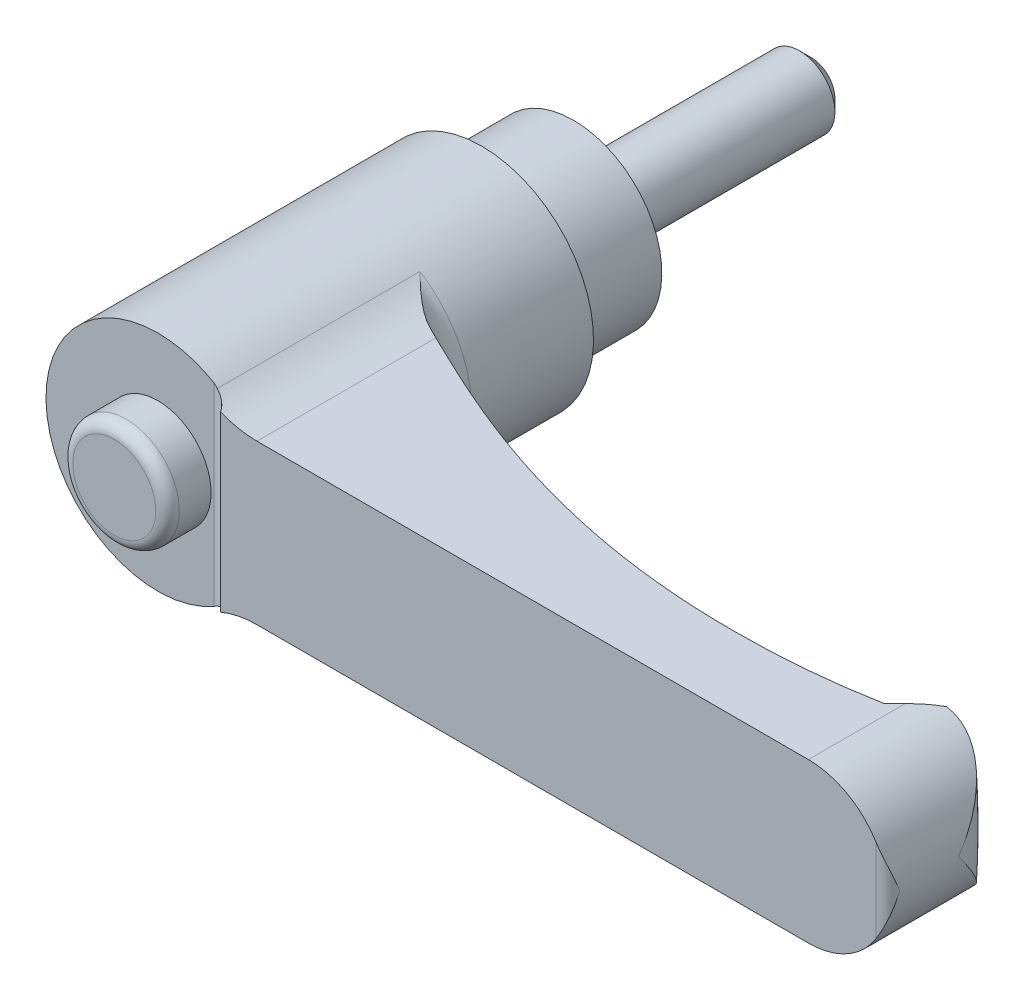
ISO-10303-21;
HEADER;
FILE_DESCRIPTION(('STEP AP214'),'2;1');
FILE_NAME('part.step','',(''),(''),'','','');
FILE_SCHEMA(('AUTOMOTIVE_DESIGN { 1 0 10303 214 1 1 1 1 }'));
ENDSEC;
DATA;
#1=APPLICATION_CONTEXT('core data for automotive mechanical design processes');
#2=APPLICATION_PROTOCOL_DEFINITION('international standard','automotive_design',2000,#1);
#3=PRODUCT_CONTEXT('',#1,'mechanical');
#4=PRODUCT('Part','Part','',(#3));
#5=PRODUCT_RELATED_PRODUCT_CATEGORY('part','',(#4));
#6=PRODUCT_DEFINITION_FORMATION('','',#4);
#7=PRODUCT_DEFINITION_CONTEXT('part definition',#1,'design');
#8=PRODUCT_DEFINITION('design','',#6,#7);
#9=PRODUCT_DEFINITION_SHAPE('','',#8);
#10=(LENGTH_UNIT() NAMED_UNIT(*) SI_UNIT(.MILLI.,.METRE.));
#11=(NAMED_UNIT(*) PLANE_ANGLE_UNIT() SI_UNIT($,.RADIAN.));
#12=(NAMED_UNIT(*) SI_UNIT($,.STERADIAN.) SOLID_ANGLE_UNIT());
#13=UNCERTAINTY_MEASURE_WITH_UNIT(LENGTH_MEASURE(1.E-05),#10,'distance_accuracy_value','');
#14=(GEOMETRIC_REPRESENTATION_CONTEXT(3) GLOBAL_UNCERTAINTY_ASSIGNED_CONTEXT((#13)) GLOBAL_UNIT_ASSIGNED_CONTEXT((#10,
#11,#12)) REPRESENTATION_CONTEXT('',''));
#15=CARTESIAN_POINT('',(0.,0.,0.));
#16=DIRECTION('',(0.,0.,1.));
#17=DIRECTION('',(1.,0.,0.));
#18=AXIS2_PLACEMENT_3D('',#15,#16,#17);
#19=CARTESIAN_POINT('',(6.,0.,0.));
#20=DIRECTION('',(0.,0.,1.));
#21=DIRECTION('',(0.,-1.,0.));
#22=AXIS2_PLACEMENT_3D('',#19,#20,#21);
#23=PLANE('',#22);
#24=CARTESIAN_POINT('',(0.,0.,0.));
#25=DIRECTION('',(0.,0.,-1.));
#26=DIRECTION('',(0.,1.,0.));
#27=AXIS2_PLACEMENT_3D('',#24,#25,#26);
#28=CIRCLE('',#27,3.);
#29=CARTESIAN_POINT('',(0.,3.,0.));
#30=VERTEX_POINT('',#29);
#31=EDGE_CURVE('E423',#30,#30,#28,.T.);
#32=ORIENTED_EDGE('',*,*,#31,.F.);
#33=EDGE_LOOP('',(#32));
#34=FACE_BOUND('',#33,.T.);
#35=CARTESIAN_POINT('',(0.,0.,0.));
#36=DIRECTION('',(0.,0.,-1.));
#37=DIRECTION('',(0.,1.,0.));
#38=AXIS2_PLACEMENT_3D('',#35,#36,#37);
#39=CIRCLE('',#38,6.);
#40=CARTESIAN_POINT('',(0.,6.,0.));
#41=VERTEX_POINT('',#40);
#42=EDGE_CURVE('E347',#41,#41,#39,.T.);
#43=ORIENTED_EDGE('',*,*,#42,.T.);
#44=EDGE_LOOP('',(#43));
#45=FACE_BOUND('',#44,.T.);
#46=ADVANCED_FACE('F14',(#34,#45),#23,.F.);
#47=CARTESIAN_POINT('',(0.,0.,35.5));
#48=DIRECTION('',(0.,0.,-1.));
#49=DIRECTION('',(0.,1.,0.));
#50=AXIS2_PLACEMENT_3D('',#47,#48,#49);
#51=PLANE('',#50);
#52=CARTESIAN_POINT('',(0.,0.,35.5));
#53=DIRECTION('',(0.,0.,-1.));
#54=DIRECTION('',(0.,1.,0.));
#55=AXIS2_PLACEMENT_3D('',#52,#53,#54);
#56=CIRCLE('',#55,9.5);
#57=CARTESIAN_POINT('',(4.75,-8.22724133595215,35.5));
#58=VERTEX_POINT('',#57);
#59=CARTESIAN_POINT('',(4.75,8.22724133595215,35.5));
#60=VERTEX_POINT('',#59);
#61=EDGE_CURVE('E332',#58,#60,#56,.T.);
#62=ORIENTED_EDGE('',*,*,#61,.F.);
#63=DIRECTION('',(0.,1.,0.));
#64=VECTOR('',#63,1.);
#65=CARTESIAN_POINT('',(4.75,-13.5,35.5));
#66=LINE('',#65,#64);
#67=EDGE_CURVE('E383',#58,#60,#66,.T.);
#68=ORIENTED_EDGE('',*,*,#67,.T.);
#69=EDGE_LOOP('',(#62,#68));
#70=FACE_BOUND('',#69,.T.);
#71=CARTESIAN_POINT('',(0.,0.,35.5));
#72=DIRECTION('',(0.,0.,-1.));
#73=DIRECTION('',(0.,1.,0.));
#74=AXIS2_PLACEMENT_3D('',#71,#72,#73);
#75=CIRCLE('',#74,4.52380952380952);
#76=CARTESIAN_POINT('',(0.,4.52380952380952,35.5));
#77=VERTEX_POINT('',#76);
#78=EDGE_CURVE('E183',#77,#77,#75,.F.);
#79=ORIENTED_EDGE('',*,*,#78,.F.);
#80=EDGE_LOOP('',(#79));
#81=FACE_BOUND('',#80,.T.);
#82=ADVANCED_FACE('F158',(#70,#81),#51,.F.);
#83=CARTESIAN_POINT('',(56.25,0.,0.));
#84=DIRECTION('',(0.,0.,1.));
#85=DIRECTION('',(0.,-1.,0.));
#86=AXIS2_PLACEMENT_3D('',#83,#84,#85);
#87=CYLINDRICAL_SURFACE('',#86,6.75);
#88=CARTESIAN_POINT('',(63.,0.,30.5));
#89=CARTESIAN_POINT('',(63.0000000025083,-0.0046874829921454,30.4965903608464));
#90=CARTESIAN_POINT('',(62.9999951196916,-0.0093750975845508,30.4931806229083));
#91=CARTESIAN_POINT('',(62.9990237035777,-0.475524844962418,30.1541065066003));
#92=CARTESIAN_POINT('',(62.9507141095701,-0.938185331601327,29.8175642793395));
#93=CARTESIAN_POINT('',(62.8060463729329,-1.62346497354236,29.3225480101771));
#94=CARTESIAN_POINT('',(62.7456147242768,-1.85084323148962,29.1588881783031));
#95=CARTESIAN_POINT('',(62.6000044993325,-2.30127271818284,28.8365968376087));
#96=CARTESIAN_POINT('',(62.5148384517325,-2.52432607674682,28.6779628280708));
#97=CARTESIAN_POINT('',(62.344804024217,-2.90644000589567,28.4087021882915));
#98=CARTESIAN_POINT('',(62.2657268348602,-3.06692788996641,28.2964051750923));
#99=CARTESIAN_POINT('',(62.0934111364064,-3.38371909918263,28.0768184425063));
#100=CARTESIAN_POINT('',(62.0001726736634,-3.5400224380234,27.9695287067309));
#101=CARTESIAN_POINT('',(61.7993668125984,-3.84715615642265,27.7614384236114));
#102=CARTESIAN_POINT('',(61.6918275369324,-3.99799655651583,27.6606257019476));
#103=CARTESIAN_POINT('',(61.4620426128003,-4.29326696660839,27.4668757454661));
#104=CARTESIAN_POINT('',(61.3398014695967,-4.43769892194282,27.3739361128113));
#105=CARTESIAN_POINT('',(61.0188552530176,-4.78536684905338,27.1560724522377));
#106=CARTESIAN_POINT('',(60.8112818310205,-4.9842025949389,27.0367418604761));
#107=CARTESIAN_POINT('',(60.4758984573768,-5.26551240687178,26.8795376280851));
#108=CARTESIAN_POINT('',(60.3601030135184,-5.35645651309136,26.8307690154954));
#109=CARTESIAN_POINT('',(60.1206554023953,-5.53195453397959,26.7416778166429));
#110=CARTESIAN_POINT('',(59.997005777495,-5.61651049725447,26.7013525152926));
#111=CARTESIAN_POINT('',(59.7699445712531,-5.76076929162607,26.6381973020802));
#112=CARTESIAN_POINT('',(59.667954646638,-5.82188686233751,26.6134697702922));
#113=CARTESIAN_POINT('',(59.4598154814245,-5.93917869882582,26.5707512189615));
#114=CARTESIAN_POINT('',(59.3536672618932,-5.99535416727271,26.5527585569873));
#115=CARTESIAN_POINT('',(59.1377410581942,-6.10229132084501,26.5242546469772));
#116=CARTESIAN_POINT('',(59.0279645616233,-6.15305518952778,26.5137403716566));
#117=CARTESIAN_POINT('',(58.8054681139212,-6.24873887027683,26.5009304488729));
#118=CARTESIAN_POINT('',(58.6927495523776,-6.29366138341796,26.4986309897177));
#119=CARTESIAN_POINT('',(58.4641163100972,-6.37770798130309,26.502966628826));
#120=CARTESIAN_POINT('',(58.3481815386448,-6.41677354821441,26.5096859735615));
#121=CARTESIAN_POINT('',(58.1152313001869,-6.48831686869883,26.5328398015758));
#122=CARTESIAN_POINT('',(57.9982157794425,-6.52079429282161,26.5492747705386));
#123=CARTESIAN_POINT('',(57.7644328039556,-6.57901960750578,26.5923251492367));
#124=CARTESIAN_POINT('',(57.6476652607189,-6.60477054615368,26.618935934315));
#125=CARTESIAN_POINT('',(57.41573023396,-6.64962508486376,26.6826067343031));
#126=CARTESIAN_POINT('',(57.3005622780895,-6.66873068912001,26.7196635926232));
#127=CARTESIAN_POINT('',(57.104290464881,-6.69624244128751,26.7926929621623));
#128=CARTESIAN_POINT('',(57.0224673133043,-6.70614558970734,26.8262017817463));
#129=CARTESIAN_POINT('',(56.8609556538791,-6.72278366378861,26.8986767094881));
#130=CARTESIAN_POINT('',(56.781266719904,-6.72951922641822,26.9376417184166));
#131=CARTESIAN_POINT('',(56.624433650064,-6.74006528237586,27.0209540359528));
#132=CARTESIAN_POINT('',(56.5472927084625,-6.74387222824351,27.0653077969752));
#133=CARTESIAN_POINT('',(56.3961054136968,-6.74884425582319,27.1591719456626));
#134=CARTESIAN_POINT('',(56.3220596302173,-6.75000885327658,27.2086832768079));
#135=CARTESIAN_POINT('',(56.2498,-6.74999999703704,27.2606710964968));
#136=B_SPLINE_CURVE_WITH_KNOTS('',3,(#88,#89,#90,#91,#92,#93,#94,#95,#96,#97,#98,#99,#100,#101,
#102,#103,#104,#105,#106,#107,#108,#109,#110,#111,#112,#113,#114,#115,#116,#117,#118,#119,#120,
#121,#122,#123,#124,#125,#126,#127,#128,#129,#130,#131,#132,#133,#134,#135),.UNSPECIFIED.,.F.,
.F.,(4,2,2,2,2,2,2,2,2,2,2,2,2,2,2,2,2,2,2,2,2,2,2,4),(0.,0.0173896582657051,1.7292315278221,
2.5882674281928,3.44686895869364,4.08007105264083,4.71327107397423,5.34524382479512,
5.97702340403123,6.9068284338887,7.37170994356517,7.83644173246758,8.20045511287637,
8.56437966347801,8.92815681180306,9.29176514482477,9.65879376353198,10.0258407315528,
10.3927210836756,10.7594906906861,11.0261722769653,11.2928002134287,11.5597506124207,
11.8267499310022),.UNSPECIFIED.);
#137=CARTESIAN_POINT('',(58.6622222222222,-6.30425919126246,26.5));
#138=VERTEX_POINT('',#137);
#139=CARTESIAN_POINT('',(63.,0.,30.5));
#140=VERTEX_POINT('',#139);
#141=EDGE_CURVE('E126',#138,#140,#136,.F.);
#142=ORIENTED_EDGE('',*,*,#141,.T.);
#143=CARTESIAN_POINT('',(63.,0.,30.5));
#144=CARTESIAN_POINT('',(63.0000000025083,0.00468748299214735,30.4965903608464));
#145=CARTESIAN_POINT('',(62.9999951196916,0.00937509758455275,30.4931806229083));
#146=CARTESIAN_POINT('',(62.9990237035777,0.47552484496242,30.1541065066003));
#147=CARTESIAN_POINT('',(62.9507141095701,0.938185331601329,29.8175642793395));
#148=CARTESIAN_POINT('',(62.8060463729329,1.62346497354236,29.3225480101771));
#149=CARTESIAN_POINT('',(62.7456147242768,1.85084323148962,29.1588881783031));
#150=CARTESIAN_POINT('',(62.6000044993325,2.30127271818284,28.8365968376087));
#151=CARTESIAN_POINT('',(62.5148384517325,2.52432607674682,28.6779628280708));
#152=CARTESIAN_POINT('',(62.344804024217,2.90644000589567,28.4087021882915));
#153=CARTESIAN_POINT('',(62.2657268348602,3.06692788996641,28.2964051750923));
#154=CARTESIAN_POINT('',(62.0934111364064,3.38371909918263,28.0768184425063));
#155=CARTESIAN_POINT('',(62.0001726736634,3.5400224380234,27.9695287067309));
#156=CARTESIAN_POINT('',(61.7993668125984,3.84715615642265,27.7614384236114));
#157=CARTESIAN_POINT('',(61.6918275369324,3.99799655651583,27.6606257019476));
#158=CARTESIAN_POINT('',(61.4620426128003,4.29326696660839,27.4668757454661));
#159=CARTESIAN_POINT('',(61.3398014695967,4.43769892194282,27.3739361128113));
#160=CARTESIAN_POINT('',(61.0188552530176,4.78536684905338,27.1560724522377));
#161=CARTESIAN_POINT('',(60.8112818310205,4.9842025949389,27.0367418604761));
#162=CARTESIAN_POINT('',(60.4758984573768,5.26551240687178,26.8795376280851));
#163=CARTESIAN_POINT('',(60.3601030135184,5.35645651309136,26.8307690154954));
#164=CARTESIAN_POINT('',(60.1206554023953,5.53195453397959,26.7416778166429));
#165=CARTESIAN_POINT('',(59.997005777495,5.61651049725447,26.7013525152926));
#166=CARTESIAN_POINT('',(59.7699445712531,5.76076929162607,26.6381973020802));
#167=CARTESIAN_POINT('',(59.667954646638,5.82188686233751,26.6134697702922));
#168=CARTESIAN_POINT('',(59.4598154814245,5.93917869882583,26.5707512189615));
#169=CARTESIAN_POINT('',(59.3536672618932,5.99535416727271,26.5527585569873));
#170=CARTESIAN_POINT('',(59.1377410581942,6.10229132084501,26.5242546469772));
#171=CARTESIAN_POINT('',(59.0279645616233,6.15305518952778,26.5137403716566));
#172=CARTESIAN_POINT('',(58.8054681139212,6.24873887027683,26.5009304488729));
#173=CARTESIAN_POINT('',(58.6927495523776,6.29366138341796,26.4986309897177));
#174=CARTESIAN_POINT('',(58.4641163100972,6.37770798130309,26.502966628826));
#175=CARTESIAN_POINT('',(58.3481815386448,6.41677354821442,26.5096859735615));
#176=CARTESIAN_POINT('',(58.1152313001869,6.48831686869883,26.5328398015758));
#177=CARTESIAN_POINT('',(57.9982157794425,6.52079429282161,26.5492747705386));
#178=CARTESIAN_POINT('',(57.7644328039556,6.57901960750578,26.5923251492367));
#179=CARTESIAN_POINT('',(57.6476652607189,6.60477054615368,26.618935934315));
#180=CARTESIAN_POINT('',(57.41573023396,6.64962508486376,26.6826067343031));
#181=CARTESIAN_POINT('',(57.3005622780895,6.66873068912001,26.7196635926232));
#182=CARTESIAN_POINT('',(57.1042904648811,6.69624244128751,26.7926929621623));
#183=CARTESIAN_POINT('',(57.0224673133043,6.70614558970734,26.8262017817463));
#184=CARTESIAN_POINT('',(56.8609556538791,6.72278366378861,26.8986767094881));
#185=CARTESIAN_POINT('',(56.781266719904,6.72951922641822,26.9376417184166));
#186=CARTESIAN_POINT('',(56.624433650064,6.74006528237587,27.0209540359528));
#187=CARTESIAN_POINT('',(56.5472927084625,6.74387222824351,27.0653077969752));
#188=CARTESIAN_POINT('',(56.3961054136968,6.74884425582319,27.1591719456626));
#189=CARTESIAN_POINT('',(56.3220596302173,6.75000885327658,27.2086832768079));
#190=CARTESIAN_POINT('',(56.2498,6.74999999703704,27.2606710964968));
#191=B_SPLINE_CURVE_WITH_KNOTS('',3,(#143,#144,#145,#146,#147,#148,#149,#150,#151,#152,#153,
#154,#155,#156,#157,#158,#159,#160,#161,#162,#163,#164,#165,#166,#167,#168,#169,#170,#171,#172,
#173,#174,#175,#176,#177,#178,#179,#180,#181,#182,#183,#184,#185,#186,#187,#188,#189,#190),
.UNSPECIFIED.,.F.,.F.,(4,2,2,2,2,2,2,2,2,2,2,2,2,2,2,2,2,2,2,2,2,2,2,4),(0.,0.0173896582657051,
1.7292315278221,2.5882674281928,3.44686895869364,4.08007105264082,4.71327107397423,
5.34524382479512,5.97702340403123,6.9068284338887,7.37170994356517,7.83644173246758,
8.20045511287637,8.56437966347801,8.92815681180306,9.29176514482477,9.65879376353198,
10.0258407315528,10.3927210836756,10.7594906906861,11.0261722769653,11.2928002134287,
11.5597506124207,11.8267499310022),.UNSPECIFIED.);
#192=CARTESIAN_POINT('',(58.6622222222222,6.30425919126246,26.5));
#193=VERTEX_POINT('',#192);
#194=EDGE_CURVE('E123',#140,#193,#191,.T.);
#195=ORIENTED_EDGE('',*,*,#194,.T.);
#196=CARTESIAN_POINT('',(56.25,0.,26.5));
#197=DIRECTION('',(0.,0.,-1.));
#198=DIRECTION('',(0.,1.,0.));
#199=AXIS2_PLACEMENT_3D('',#196,#197,#198);
#200=CIRCLE('',#199,6.75);
#201=CARTESIAN_POINT('',(58.,6.51920240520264,26.5));
#202=VERTEX_POINT('',#201);
#203=EDGE_CURVE('E308',#193,#202,#200,.F.);
#204=ORIENTED_EDGE('',*,*,#203,.T.);
#205=CARTESIAN_POINT('',(56.25,0.,28.25));
#206=DIRECTION('',(-0.707106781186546,0.,-0.70710678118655));
#207=DIRECTION('',(-0.70710678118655,0.,0.707106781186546));
#208=AXIS2_PLACEMENT_3D('',#205,#206,#207);
#209=ELLIPSE('',#208,9.54594154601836,6.75);
#210=CARTESIAN_POINT('',(56.25,6.75,28.25));
#211=VERTEX_POINT('',#210);
#212=EDGE_CURVE('E374',#202,#211,#209,.F.);
#213=ORIENTED_EDGE('',*,*,#212,.T.);
#214=DIRECTION('',(0.,0.,1.));
#215=VECTOR('',#214,1.);
#216=CARTESIAN_POINT('',(56.25,6.75,0.));
#217=LINE('',#216,#215);
#218=CARTESIAN_POINT('',(56.25,6.75,36.5));
#219=VERTEX_POINT('',#218);
#220=EDGE_CURVE('E330',#211,#219,#217,.T.);
#221=ORIENTED_EDGE('',*,*,#220,.T.);
#222=CARTESIAN_POINT('',(56.25,0.,36.5));
#223=DIRECTION('',(0.,0.,1.));
#224=DIRECTION('',(0.,-1.,0.));
#225=AXIS2_PLACEMENT_3D('',#222,#223,#224);
#226=CIRCLE('',#225,6.75);
#227=CARTESIAN_POINT('',(62.,3.53553390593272,36.5));
#228=VERTEX_POINT('',#227);
#229=EDGE_CURVE('E322',#228,#219,#226,.T.);
#230=ORIENTED_EDGE('',*,*,#229,.F.);
#231=CARTESIAN_POINT('',(62.,3.53553390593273,36.5));
#232=CARTESIAN_POINT('',(62.0299932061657,3.48675666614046,36.4999933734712));
#233=CARTESIAN_POINT('',(62.0593538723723,3.43761273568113,36.4986515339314));
#234=CARTESIAN_POINT('',(62.1167538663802,3.33870692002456,36.4935798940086));
#235=CARTESIAN_POINT('',(62.1447937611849,3.28894531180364,36.489851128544));
#236=CARTESIAN_POINT('',(62.2267562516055,3.13908056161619,36.4755285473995));
#237=CARTESIAN_POINT('',(62.2786643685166,3.03816514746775,36.4617957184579));
#238=CARTESIAN_POINT('',(62.3766467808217,2.83536966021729,36.4277987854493));
#239=CARTESIAN_POINT('',(62.4227515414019,2.73349792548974,36.4075709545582));
#240=CARTESIAN_POINT('',(62.509502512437,2.52854152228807,36.3618646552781));
#241=CARTESIAN_POINT('',(62.550144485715,2.42545597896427,36.3363821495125));
#242=CARTESIAN_POINT('',(62.6493297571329,2.15471359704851,36.2642737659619));
#243=CARTESIAN_POINT('',(62.7035065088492,1.98634279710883,36.2142841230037));
#244=CARTESIAN_POINT('',(62.7980553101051,1.64812969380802,36.1068184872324));
#245=CARTESIAN_POINT('',(62.8384218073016,1.4782868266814,36.0493394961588));
#246=CARTESIAN_POINT('',(62.9057483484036,1.1374266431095,35.9293690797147));
#247=CARTESIAN_POINT('',(62.9326868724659,0.966407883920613,35.8668697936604));
#248=CARTESIAN_POINT('',(62.9733111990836,0.623942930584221,35.7390768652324));
#249=CARTESIAN_POINT('',(62.9870036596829,0.452496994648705,35.6737846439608));
#250=CARTESIAN_POINT('',(62.997837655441,0.192449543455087,35.5740662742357));
#251=CARTESIAN_POINT('',(62.999781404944,0.103891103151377,35.539987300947));
#252=CARTESIAN_POINT('',(62.9999941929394,0.0102233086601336,35.5039349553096));
#253=CARTESIAN_POINT('',(62.9999999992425,0.00511164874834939,35.5019674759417));
#254=CARTESIAN_POINT('',(63.,0.,35.5));
#255=B_SPLINE_CURVE_WITH_KNOTS('',3,(#231,#232,#233,#234,#235,#236,#237,#238,#239,#240,#241,
#242,#243,#244,#245,#246,#247,#248,#249,#250,#251,#252,#253,#254),.UNSPECIFIED.,.F.,.F.,(4,2,2,
2,2,2,2,2,2,2,2,4),(0.,0.171732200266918,0.343389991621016,0.685890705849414,1.02651095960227,
1.36739390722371,1.91796289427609,2.46875297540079,3.02042294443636,3.57181547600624,
3.85648313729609,3.87291482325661),.UNSPECIFIED.);
#256=CARTESIAN_POINT('',(63.,0.,35.5));
#257=VERTEX_POINT('',#256);
#258=EDGE_CURVE('E169',#257,#228,#255,.F.);
#259=ORIENTED_EDGE('',*,*,#258,.F.);
#260=CARTESIAN_POINT('',(62.,-3.53553390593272,36.5));
#261=CARTESIAN_POINT('',(62.0299932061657,-3.48675666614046,36.4999933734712));
#262=CARTESIAN_POINT('',(62.0593538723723,-3.43761273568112,36.4986515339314));
#263=CARTESIAN_POINT('',(62.1167538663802,-3.33870692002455,36.4935798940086));
#264=CARTESIAN_POINT('',(62.1447937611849,-3.28894531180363,36.489851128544));
#265=CARTESIAN_POINT('',(62.2267562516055,-3.13908056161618,36.4755285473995));
#266=CARTESIAN_POINT('',(62.2786643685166,-3.03816514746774,36.4617957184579));
#267=CARTESIAN_POINT('',(62.3766467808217,-2.83536966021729,36.4277987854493));
#268=CARTESIAN_POINT('',(62.4227515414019,-2.73349792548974,36.4075709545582));
#269=CARTESIAN_POINT('',(62.509502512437,-2.52854152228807,36.3618646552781));
#270=CARTESIAN_POINT('',(62.550144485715,-2.42545597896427,36.3363821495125));
#271=CARTESIAN_POINT('',(62.6493297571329,-2.15471359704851,36.2642737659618));
#272=CARTESIAN_POINT('',(62.7035065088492,-1.98634279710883,36.2142841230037));
#273=CARTESIAN_POINT('',(62.7980553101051,-1.64812969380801,36.1068184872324));
#274=CARTESIAN_POINT('',(62.8384218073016,-1.4782868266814,36.0493394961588));
#275=CARTESIAN_POINT('',(62.9057483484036,-1.1374266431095,35.9293690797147));
#276=CARTESIAN_POINT('',(62.9326868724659,-0.966407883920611,35.8668697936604));
#277=CARTESIAN_POINT('',(62.9733111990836,-0.623942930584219,35.7390768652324));
#278=CARTESIAN_POINT('',(62.9870036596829,-0.452496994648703,35.6737846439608));
#279=CARTESIAN_POINT('',(62.997837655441,-0.192449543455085,35.5740662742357));
#280=CARTESIAN_POINT('',(62.999781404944,-0.103891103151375,35.539987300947));
#281=CARTESIAN_POINT('',(62.9999941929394,-0.0102233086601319,35.5039349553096));
#282=CARTESIAN_POINT('',(62.9999999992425,-0.00511164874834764,35.5019674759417));
#283=CARTESIAN_POINT('',(63.,0.,35.5));
#284=B_SPLINE_CURVE_WITH_KNOTS('',3,(#260,#261,#262,#263,#264,#265,#266,#267,#268,#269,#270,
#271,#272,#273,#274,#275,#276,#277,#278,#279,#280,#281,#282,#283),.UNSPECIFIED.,.F.,.F.,(4,2,2,
2,2,2,2,2,2,2,2,4),(0.,0.171732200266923,0.34338999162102,0.685890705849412,1.02651095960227,
1.36739390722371,1.91796289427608,2.46875297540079,3.02042294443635,3.57181547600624,
3.85648313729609,3.8729148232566),.UNSPECIFIED.);
#285=CARTESIAN_POINT('',(62.,-3.53553390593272,36.5));
#286=VERTEX_POINT('',#285);
#287=EDGE_CURVE('E177',#286,#257,#284,.T.);
#288=ORIENTED_EDGE('',*,*,#287,.F.);
#289=CARTESIAN_POINT('',(56.25,-6.75,36.5));
#290=VERTEX_POINT('',#289);
#291=EDGE_CURVE('E310',#290,#286,#226,.T.);
#292=ORIENTED_EDGE('',*,*,#291,.F.);
#293=DIRECTION('',(0.,0.,1.));
#294=VECTOR('',#293,1.);
#295=CARTESIAN_POINT('',(56.25,-6.75,0.));
#296=LINE('',#295,#294);
#297=CARTESIAN_POINT('',(56.25,-6.75,28.25));
#298=VERTEX_POINT('',#297);
#299=EDGE_CURVE('E355',#298,#290,#296,.T.);
#300=ORIENTED_EDGE('',*,*,#299,.F.);
#301=CARTESIAN_POINT('',(58.,-6.51920240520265,26.5));
#302=VERTEX_POINT('',#301);
#303=EDGE_CURVE('E375',#298,#302,#209,.F.);
#304=ORIENTED_EDGE('',*,*,#303,.T.);
#305=EDGE_CURVE('E134',#302,#138,#200,.F.);
#306=ORIENTED_EDGE('',*,*,#305,.T.);
#307=EDGE_LOOP('',(#142,#195,#204,#213,#221,#230,#259,#288,#292,#300,#304,#306));
#308=FACE_BOUND('',#307,.T.);
#309=ADVANCED_FACE('F132',(#308),#87,.T.);
#310=CARTESIAN_POINT('',(59.,-13.5,26.5));
#311=DIRECTION('',(0.,0.,-1.));
#312=DIRECTION('',(0.,1.,0.));
#313=AXIS2_PLACEMENT_3D('',#310,#311,#312);
#314=PLANE('',#313);
#315=ORIENTED_EDGE('',*,*,#203,.F.);
#316=CARTESIAN_POINT('',(0.,0.,26.5));
#317=DIRECTION('',(0.,0.,-1.));
#318=DIRECTION('',(0.,1.,0.));
#319=AXIS2_PLACEMENT_3D('',#316,#317,#318);
#320=CIRCLE('',#319,59.);
#321=EDGE_CURVE('E37',#193,#138,#320,.T.);
#322=ORIENTED_EDGE('',*,*,#321,.T.);
#323=ORIENTED_EDGE('',*,*,#305,.F.);
#324=DIRECTION('',(0.,1.,0.));
#325=VECTOR('',#324,1.);
#326=CARTESIAN_POINT('',(58.,-13.5,26.5));
#327=LINE('',#326,#325);
#328=EDGE_CURVE('E327',#302,#202,#327,.T.);
#329=ORIENTED_EDGE('',*,*,#328,.T.);
#330=EDGE_LOOP('',(#315,#322,#323,#329));
#331=FACE_BOUND('',#330,.T.);
#332=ADVANCED_FACE('F157',(#331),#314,.T.);
#333=CARTESIAN_POINT('',(0.,0.,36.5));
#334=DIRECTION('',(0.,0.,1.));
#335=DIRECTION('',(0.,-1.,0.));
#336=AXIS2_PLACEMENT_3D('',#333,#334,#335);
#337=PLANE('',#336);
#338=CARTESIAN_POINT('',(9.41740410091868,14.75,36.5));
#339=DIRECTION('',(0.,0.,1.));
#340=DIRECTION('',(1.,0.,0.));
#341=AXIS2_PLACEMENT_3D('',#338,#339,#340);
#342=CIRCLE('',#341,8.);
#343=CARTESIAN_POINT('',(6.33333333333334,7.36836688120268,36.5));
#344=VERTEX_POINT('',#343);
#345=CARTESIAN_POINT('',(9.41740410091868,6.75,36.5));
#346=VERTEX_POINT('',#345);
#347=EDGE_CURVE('E369',#344,#346,#342,.T.);
#348=ORIENTED_EDGE('',*,*,#347,.F.);
#349=DIRECTION('',(0.,1.,0.));
#350=VECTOR('',#349,1.);
#351=CARTESIAN_POINT('',(6.33333333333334,-13.5,36.5));
#352=LINE('',#351,#350);
#353=CARTESIAN_POINT('',(6.33333333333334,-7.36836688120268,36.5));
#354=VERTEX_POINT('',#353);
#355=EDGE_CURVE('E326',#354,#344,#352,.T.);
#356=ORIENTED_EDGE('',*,*,#355,.F.);
#357=CARTESIAN_POINT('',(9.41740410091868,-14.75,36.5));
#358=DIRECTION('',(0.,0.,1.));
#359=DIRECTION('',(1.,0.,0.));
#360=AXIS2_PLACEMENT_3D('',#357,#358,#359);
#361=CIRCLE('',#360,8.);
#362=CARTESIAN_POINT('',(9.41740410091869,-6.75,36.5));
#363=VERTEX_POINT('',#362);
#364=EDGE_CURVE('E361',#363,#354,#361,.T.);
#365=ORIENTED_EDGE('',*,*,#364,.F.);
#366=DIRECTION('',(-1.,0.,0.));
#367=VECTOR('',#366,1.);
#368=CARTESIAN_POINT('',(56.25,-6.75,36.5));
#369=LINE('',#368,#367);
#370=EDGE_CURVE('E364',#290,#363,#369,.T.);
#371=ORIENTED_EDGE('',*,*,#370,.F.);
#372=ORIENTED_EDGE('',*,*,#291,.T.);
#373=DIRECTION('',(0.,1.,0.));
#374=VECTOR('',#373,1.);
#375=CARTESIAN_POINT('',(62.,-13.5,36.5));
#376=LINE('',#375,#374);
#377=EDGE_CURVE('E315',#286,#228,#376,.T.);
#378=ORIENTED_EDGE('',*,*,#377,.T.);
#379=ORIENTED_EDGE('',*,*,#229,.T.);
#380=DIRECTION('',(1.,0.,0.));
#381=VECTOR('',#380,1.);
#382=CARTESIAN_POINT('',(9.41740410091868,6.75,36.5));
#383=LINE('',#382,#381);
#384=EDGE_CURVE('E367',#346,#219,#383,.T.);
#385=ORIENTED_EDGE('',*,*,#384,.F.);
#386=EDGE_LOOP('',(#348,#356,#365,#371,#372,#378,#379,#385));
#387=FACE_BOUND('',#386,.T.);
#388=ADVANCED_FACE('F240',(#387),#337,.T.);
#389=CARTESIAN_POINT('',(0.,0.,0.));
#390=DIRECTION('',(0.,0.,-1.));
#391=DIRECTION('',(0.,1.,0.));
#392=AXIS2_PLACEMENT_3D('',#389,#390,#391);
#393=CYLINDRICAL_SURFACE('',#392,9.5);
#394=CARTESIAN_POINT('',(0.,0.,18.3481601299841));
#395=DIRECTION('',(0.,0.,-1.));
#396=DIRECTION('',(0.,1.,0.));
#397=AXIS2_PLACEMENT_3D('',#394,#395,#396);
#398=CIRCLE('',#397,9.5);
#399=CARTESIAN_POINT('',(5.11230508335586,8.00714285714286,18.3481601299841));
#400=VERTEX_POINT('',#399);
#401=CARTESIAN_POINT('',(5.11230508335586,-8.00714285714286,18.3481601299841));
#402=VERTEX_POINT('',#401);
#403=EDGE_CURVE('E413',#400,#402,#398,.T.);
#404=ORIENTED_EDGE('',*,*,#403,.T.);
#405=DIRECTION('',(0.,0.,1.));
#406=VECTOR('',#405,1.);
#407=CARTESIAN_POINT('',(5.11230508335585,-8.00714285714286,0.));
#408=LINE('',#407,#406);
#409=CARTESIAN_POINT('',(5.11230508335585,-8.00714285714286,35.5614827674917));
#410=VERTEX_POINT('',#409);
#411=EDGE_CURVE('E359',#402,#410,#408,.T.);
#412=ORIENTED_EDGE('',*,*,#411,.T.);
#413=CARTESIAN_POINT('',(4.75,-8.22724133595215,35.5));
#414=CARTESIAN_POINT('',(4.82354897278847,-8.18479174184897,35.5056127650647));
#415=CARTESIAN_POINT('',(4.89626028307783,-8.1414834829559,35.5152432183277));
#416=CARTESIAN_POINT('',(5.03945202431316,-8.05362753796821,35.5421901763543));
#417=CARTESIAN_POINT('',(5.10993308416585,-8.00908020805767,35.5595044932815));
#418=CARTESIAN_POINT('',(5.24861636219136,-7.91889687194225,35.6016146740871));
#419=CARTESIAN_POINT('',(5.31680005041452,-7.87325555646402,35.6264601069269));
#420=CARTESIAN_POINT('',(5.44990684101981,-7.7817124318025,35.6832973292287));
#421=CARTESIAN_POINT('',(5.51483003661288,-7.7358106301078,35.7152889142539));
#422=CARTESIAN_POINT('',(5.69141984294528,-7.6077148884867,35.8145402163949));
#423=CARTESIAN_POINT('',(5.79903338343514,-7.52579740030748,35.8895684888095));
#424=CARTESIAN_POINT('',(5.99917718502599,-7.36722875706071,36.0610902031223));
#425=CARTESIAN_POINT('',(6.09178179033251,-7.29055280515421,36.157471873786));
#426=CARTESIAN_POINT('',(6.20382113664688,-7.19472379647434,36.3011658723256));
#427=CARTESIAN_POINT('',(6.23139044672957,-7.17084441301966,36.33916914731));
#428=CARTESIAN_POINT('',(6.28417716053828,-7.12462925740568,36.4176957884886));
#429=CARTESIAN_POINT('',(6.30939340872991,-7.1022942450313,36.4582203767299));
#430=CARTESIAN_POINT('',(6.33333333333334,-7.08088192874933,36.5));
#431=B_SPLINE_CURVE_WITH_KNOTS('',3,(#413,#414,#415,#416,#417,#418,#419,#420,#421,#422,#423,
#424,#425,#426,#427,#428,#429,#430),.UNSPECIFIED.,.F.,.F.,(4,2,2,2,2,2,2,2,4),(0.,
0.25516766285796,0.510262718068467,0.767074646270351,1.02387922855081,1.48566336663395,
1.94508518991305,2.10299549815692,2.26098294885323),.UNSPECIFIED.);
#432=EDGE_CURVE('E214',#58,#410,#431,.T.);
#433=ORIENTED_EDGE('',*,*,#432,.F.);
#434=ORIENTED_EDGE('',*,*,#61,.T.);
#435=CARTESIAN_POINT('',(6.33333333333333,7.08088192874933,36.5));
#436=CARTESIAN_POINT('',(6.30193651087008,7.10896982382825,36.4452145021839));
#437=CARTESIAN_POINT('',(6.26833956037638,7.13863883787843,36.3925689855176));
#438=CARTESIAN_POINT('',(6.19723055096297,7.20045324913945,36.2916619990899));
#439=CARTESIAN_POINT('',(6.15972345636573,7.23259549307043,36.243395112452));
#440=CARTESIAN_POINT('',(6.08131079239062,7.2986494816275,36.1513438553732));
#441=CARTESIAN_POINT('',(6.04041526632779,7.33255589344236,36.1075470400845));
#442=CARTESIAN_POINT('',(5.95546899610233,7.40171574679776,36.0242830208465));
#443=CARTESIAN_POINT('',(5.91141716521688,7.4369696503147,35.9848173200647));
#444=CARTESIAN_POINT('',(5.7754647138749,7.54368484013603,35.8733623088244));
#445=CARTESIAN_POINT('',(5.67929205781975,7.61650473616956,35.8077657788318));
#446=CARTESIAN_POINT('',(5.47750803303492,7.76289095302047,35.6942705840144));
#447=CARTESIAN_POINT('',(5.37189158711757,7.83645765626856,35.6463815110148));
#448=CARTESIAN_POINT('',(5.1806466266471,7.96370194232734,35.5790108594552));
#449=CARTESIAN_POINT('',(5.09668204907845,8.01772299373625,35.5554125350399));
#450=CARTESIAN_POINT('',(4.92555498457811,8.12398585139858,35.5192948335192));
#451=CARTESIAN_POINT('',(4.83839896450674,8.17623088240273,35.5067542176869));
#452=CARTESIAN_POINT('',(4.75,8.22724133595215,35.5));
#453=B_SPLINE_CURVE_WITH_KNOTS('',3,(#435,#436,#437,#438,#439,#440,#441,#442,#443,#444,#445,
#446,#447,#448,#449,#450,#451,#452),.UNSPECIFIED.,.F.,.F.,(4,2,2,2,2,2,2,2,4),(0.,
0.207163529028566,0.414067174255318,0.620378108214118,0.826760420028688,1.23705708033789,
1.64757566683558,1.9547198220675,2.26127274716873),.UNSPECIFIED.);
#454=CARTESIAN_POINT('',(5.11230508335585,8.00714285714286,35.5614827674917));
#455=VERTEX_POINT('',#454);
#456=EDGE_CURVE('E228',#455,#60,#453,.T.);
#457=ORIENTED_EDGE('',*,*,#456,.F.);
#458=DIRECTION('',(0.,0.,1.));
#459=VECTOR('',#458,1.);
#460=CARTESIAN_POINT('',(5.11230508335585,8.00714285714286,0.));
#461=LINE('',#460,#459);
#462=EDGE_CURVE('E350',#400,#455,#461,.T.);
#463=ORIENTED_EDGE('',*,*,#462,.F.);
#464=EDGE_LOOP('',(#404,#412,#433,#434,#457,#463));
#465=FACE_BOUND('',#464,.T.);
#466=CARTESIAN_POINT('',(0.,0.,8.));
#467=DIRECTION('',(0.,0.,-1.));
#468=DIRECTION('',(0.,1.,0.));
#469=AXIS2_PLACEMENT_3D('',#466,#467,#468);
#470=CIRCLE('',#469,9.5);
#471=CARTESIAN_POINT('',(0.,9.5,8.));
#472=VERTEX_POINT('',#471);
#473=EDGE_CURVE('E333',#472,#472,#470,.T.);
#474=ORIENTED_EDGE('',*,*,#473,.F.);
#475=EDGE_LOOP('',(#474));
#476=FACE_BOUND('',#475,.T.);
#477=ADVANCED_FACE('F238',(#465,#476),#393,.T.);
#478=CARTESIAN_POINT('',(9.41740410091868,14.75,0.));
#479=DIRECTION('',(0.,0.,1.));
#480=DIRECTION('',(0.,-1.,0.));
#481=AXIS2_PLACEMENT_3D('',#478,#479,#480);
#482=CYLINDRICAL_SURFACE('',#481,8.);
#483=DIRECTION('',(0.,0.,1.));
#484=VECTOR('',#483,1.);
#485=CARTESIAN_POINT('',(9.41740410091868,6.75,0.));
#486=LINE('',#485,#484);
#487=CARTESIAN_POINT('',(9.41740410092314,6.75,21.3021638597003));
#488=VERTEX_POINT('',#487);
#489=EDGE_CURVE('E352',#488,#346,#486,.T.);
#490=ORIENTED_EDGE('',*,*,#489,.F.);
#491=CARTESIAN_POINT('',(9.41760410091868,6.7500000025,21.3022609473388));
#492=CARTESIAN_POINT('',(9.34663199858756,6.74999859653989,21.2678090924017));
#493=CARTESIAN_POINT('',(9.27552780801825,6.75094090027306,21.2336266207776));
#494=CARTESIAN_POINT('',(9.13312349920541,6.75473540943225,21.1659081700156));
#495=CARTESIAN_POINT('',(9.06182355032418,6.75758629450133,21.1323717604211));
#496=CARTESIAN_POINT('',(8.91899698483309,6.7652204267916,21.066004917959));
#497=CARTESIAN_POINT('',(8.84747036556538,6.77000369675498,21.0331744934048));
#498=CARTESIAN_POINT('',(8.704162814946,6.78153362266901,20.9682923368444));
#499=CARTESIAN_POINT('',(8.63238174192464,6.78828163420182,20.9362411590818));
#500=CARTESIAN_POINT('',(8.56050869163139,6.79602424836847,20.9046385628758));
#501=B_SPLINE_CURVE_WITH_KNOTS('',3,(#491,#492,#493,#494,#495,#496,#497,#498,#499,#500),
.UNSPECIFIED.,.F.,.F.,(4,2,2,2,4),(0.,0.236671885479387,0.473180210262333,0.709691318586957,
0.946365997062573),.UNSPECIFIED.);
#502=CARTESIAN_POINT('',(8.56096354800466,6.79597525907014,20.9048385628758));
#503=VERTEX_POINT('',#502);
#504=EDGE_CURVE('E246',#488,#503,#501,.T.);
#505=ORIENTED_EDGE('',*,*,#504,.T.);
#506=CARTESIAN_POINT('',(8.56141843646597,6.79592629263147,20.9050385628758));
#507=CARTESIAN_POINT('',(8.47420918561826,6.80531273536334,20.8666951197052));
#508=CARTESIAN_POINT('',(8.38798367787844,6.81604134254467,20.8265142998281));
#509=CARTESIAN_POINT('',(8.21753113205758,6.84002445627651,20.7428900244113));
#510=CARTESIAN_POINT('',(8.13330325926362,6.85327788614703,20.6994479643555));
#511=CARTESIAN_POINT('',(7.88393651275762,6.89653514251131,20.5650030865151));
#512=CARTESIAN_POINT('',(7.72171249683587,6.9300806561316,20.4697011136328));
#513=CARTESIAN_POINT('',(7.40583761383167,7.00533652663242,20.2709379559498));
#514=CARTESIAN_POINT('',(7.25214096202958,7.0469964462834,20.1675294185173));
#515=CARTESIAN_POINT('',(6.95163567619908,7.13786246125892,19.9540740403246));
#516=CARTESIAN_POINT('',(6.80483124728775,7.18707308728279,19.8440232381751));
#517=CARTESIAN_POINT('',(6.52235248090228,7.29074005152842,19.6227797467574));
#518=CARTESIAN_POINT('',(6.38647079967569,7.34497015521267,19.5117441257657));
#519=CARTESIAN_POINT('',(6.12012077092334,7.45966750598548,19.286442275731));
#520=CARTESIAN_POINT('',(5.98965290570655,7.5201353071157,19.1721757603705));
#521=CARTESIAN_POINT('',(5.73356790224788,7.64719834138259,18.9415280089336));
#522=CARTESIAN_POINT('',(5.60795285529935,7.71379617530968,18.825145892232));
#523=CARTESIAN_POINT('',(5.36116691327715,7.853115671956,18.5913699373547));
#524=CARTESIAN_POINT('',(5.23999538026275,7.92583645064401,18.4739762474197));
#525=CARTESIAN_POINT('',(5.11800178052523,8.00350824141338,18.3537764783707));
#526=CARTESIAN_POINT('',(5.11515285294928,8.00532465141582,18.3509683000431));
#527=CARTESIAN_POINT('',(5.11230508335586,8.00714285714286,18.3481601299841));
#528=B_SPLINE_CURVE_WITH_KNOTS('',3,(#506,#507,#508,#509,#510,#511,#512,#513,#514,#515,#516,
#517,#518,#519,#520,#521,#522,#523,#524,#525,#526,#527),.UNSPECIFIED.,.F.,.F.,(4,2,2,2,2,2,2,2,
2,2,4),(0.,0.287104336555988,0.574086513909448,1.14672714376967,1.7159158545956,
2.28544744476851,2.83621563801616,3.38703279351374,3.93808473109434,4.48905724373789,
4.50223731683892),.UNSPECIFIED.);
#529=EDGE_CURVE('E393',#503,#400,#528,.T.);
#530=ORIENTED_EDGE('',*,*,#529,.T.);
#531=ORIENTED_EDGE('',*,*,#462,.T.);
#532=CARTESIAN_POINT('',(6.33333333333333,7.36836688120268,36.5));
#533=CARTESIAN_POINT('',(6.30572631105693,7.37990157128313,36.4517939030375));
#534=CARTESIAN_POINT('',(6.27620115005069,7.39241872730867,36.4049318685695));
#535=CARTESIAN_POINT('',(6.21369042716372,7.41942165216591,36.3142041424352));
#536=CARTESIAN_POINT('',(6.18070621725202,7.433906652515,36.2703372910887));
#537=CARTESIAN_POINT('',(6.11180020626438,7.46478219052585,36.1860768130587));
#538=CARTESIAN_POINT('',(6.07589356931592,7.48116305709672,36.1456672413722));
#539=CARTESIAN_POINT('',(6.001409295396,7.51586753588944,36.0683091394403));
#540=CARTESIAN_POINT('',(5.96283154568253,7.53419123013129,36.0313607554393));
#541=CARTESIAN_POINT('',(5.84377892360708,7.59200134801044,35.9260570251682));
#542=CARTESIAN_POINT('',(5.75985492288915,7.63438377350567,35.8630866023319));
#543=CARTESIAN_POINT('',(5.58613979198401,7.72639161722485,35.7523382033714));
#544=CARTESIAN_POINT('',(5.49634385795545,7.77602300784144,35.7045728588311));
#545=CARTESIAN_POINT('',(5.35683601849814,7.85689272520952,35.6430239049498));
#546=CARTESIAN_POINT('',(5.30809845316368,7.88582630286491,35.6238148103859));
#547=CARTESIAN_POINT('',(5.21035384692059,7.94529574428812,35.5895762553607));
#548=CARTESIAN_POINT('',(5.1613480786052,7.975826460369,35.5745342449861));
#549=CARTESIAN_POINT('',(5.11230508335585,8.00714285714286,35.5614827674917));
#550=B_SPLINE_CURVE_WITH_KNOTS('',3,(#532,#533,#534,#535,#536,#537,#538,#539,#540,#541,#542,
#543,#544,#545,#546,#547,#548,#549),.UNSPECIFIED.,.F.,.F.,(4,2,2,2,2,2,2,2,4),(0.,
0.170139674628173,0.340213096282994,0.50945430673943,0.678702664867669,1.01657399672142,
1.35472528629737,1.53411415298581,1.7129567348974),.UNSPECIFIED.);
#551=EDGE_CURVE('E222',#344,#455,#550,.T.);
#552=ORIENTED_EDGE('',*,*,#551,.F.);
#553=ORIENTED_EDGE('',*,*,#347,.T.);
#554=EDGE_LOOP('',(#490,#505,#530,#531,#552,#553));
#555=FACE_BOUND('',#554,.T.);
#556=ADVANCED_FACE('F234',(#555),#482,.F.);
#557=CARTESIAN_POINT('',(9.41740410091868,6.75,0.));
#558=DIRECTION('',(0.,-1.,0.));
#559=DIRECTION('',(1.,0.,0.));
#560=AXIS2_PLACEMENT_3D('',#557,#558,#559);
#561=PLANE('',#560);
#562=CARTESIAN_POINT('',(43.8904150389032,6.75,-32.7854085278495));
#563=DIRECTION('',(0.,-1.,0.));
#564=DIRECTION('',(1.,0.,0.));
#565=AXIS2_PLACEMENT_3D('',#562,#563,#564);
#566=CIRCLE('',#565,63.);
#567=CARTESIAN_POINT('',(43.630890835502,6.75000000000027,30.2140569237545));
#568=VERTEX_POINT('',#567);
#569=CARTESIAN_POINT('',(55.3333333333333,6.75,29.1666666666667));
#570=VERTEX_POINT('',#569);
#571=EDGE_CURVE('E376',#568,#570,#566,.F.);
#572=ORIENTED_EDGE('',*,*,#571,.F.);
#573=CARTESIAN_POINT('',(31.7211018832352,6.75,29.163677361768));
#574=CARTESIAN_POINT('',(30.4815814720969,6.75,28.9394124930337));
#575=CARTESIAN_POINT('',(29.248337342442,6.75,28.6800208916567));
#576=CARTESIAN_POINT('',(26.798292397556,6.75,28.093381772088));
#577=CARTESIAN_POINT('',(25.5814894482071,6.75,27.7661431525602));
#578=CARTESIAN_POINT('',(23.7726077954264,6.75,27.2275084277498));
#579=CARTESIAN_POINT('',(23.1732161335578,6.75,27.0403034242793));
#580=CARTESIAN_POINT('',(21.9794838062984,6.75,26.6504397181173));
#581=CARTESIAN_POINT('',(21.3851430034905,6.75,26.4477814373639));
#582=CARTESIAN_POINT('',(20.20172109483,6.75,26.027681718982));
#583=CARTESIAN_POINT('',(19.6126399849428,6.75,25.8102402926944));
#584=CARTESIAN_POINT('',(18.4398233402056,6.75,25.3614109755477));
#585=CARTESIAN_POINT('',(17.8560877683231,6.75,25.1300231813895));
#586=CARTESIAN_POINT('',(16.8264520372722,6.75,24.7086305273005));
#587=CARTESIAN_POINT('',(16.3794839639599,6.75,24.5212256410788));
#588=CARTESIAN_POINT('',(15.4885644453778,6.75,24.1393775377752));
#589=CARTESIAN_POINT('',(15.0446130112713,6.75,23.9449342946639));
#590=CARTESIAN_POINT('',(14.1595159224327,6.75,23.5498036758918));
#591=CARTESIAN_POINT('',(13.7183701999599,6.75,23.3491164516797));
#592=CARTESIAN_POINT('',(12.8384969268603,6.75,22.9425083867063));
#593=CARTESIAN_POINT('',(12.3997694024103,6.75,22.7365874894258));
#594=CARTESIAN_POINT('',(11.5213847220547,6.75,22.3195357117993));
#595=CARTESIAN_POINT('',(11.0817393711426,6.75,22.1083800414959));
#596=CARTESIAN_POINT('',(10.2034650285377,6.75,21.6840048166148));
#597=CARTESIAN_POINT('',(9.76483601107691,6.75,21.4707853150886));
#598=CARTESIAN_POINT('',(8.88741279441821,6.75,21.0449308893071));
#599=CARTESIAN_POINT('',(8.4486186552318,6.75,20.832295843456));
#600=CARTESIAN_POINT('',(7.7888040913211,6.75,20.5166390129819));
#601=CARTESIAN_POINT('',(7.56857842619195,6.75,20.4119614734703));
#602=CARTESIAN_POINT('',(7.12729129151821,6.75,20.2043820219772));
#603=CARTESIAN_POINT('',(6.90622982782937,6.75,20.1014800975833));
#604=CARTESIAN_POINT('',(6.48691851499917,6.75,19.9092503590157));
#605=CARTESIAN_POINT('',(6.28878981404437,6.75,19.8196589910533));
#606=CARTESIAN_POINT('',(5.89131318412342,6.75,19.6432260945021));
#607=CARTESIAN_POINT('',(5.69196528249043,6.75,19.5563845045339));
#608=CARTESIAN_POINT('',(5.29178648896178,6.75,19.3863184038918));
#609=CARTESIAN_POINT('',(5.09095599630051,6.75,19.3030929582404));
#610=CARTESIAN_POINT('',(4.68744730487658,6.75,19.1412674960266));
#611=CARTESIAN_POINT('',(4.48476921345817,6.75,19.0626672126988));
#612=CARTESIAN_POINT('',(4.07928382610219,6.75,18.9120884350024));
#613=CARTESIAN_POINT('',(3.87649877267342,6.75,18.8400507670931));
#614=CARTESIAN_POINT('',(3.46854334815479,6.75,18.7031281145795));
#615=CARTESIAN_POINT('',(3.26337283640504,6.75,18.6382435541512));
#616=CARTESIAN_POINT('',(2.64418711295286,6.75,18.4568464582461));
#617=CARTESIAN_POINT('',(2.22603982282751,6.75,18.3534128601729));
#618=CARTESIAN_POINT('',(1.65420364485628,6.75,18.2467177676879));
#619=CARTESIAN_POINT('',(1.50442360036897,6.75,18.2219398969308));
#620=CARTESIAN_POINT('',(1.20392315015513,6.75,18.1790422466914));
#621=CARTESIAN_POINT('',(1.05320291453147,6.75,18.1609212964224));
#622=CARTESIAN_POINT('',(0.751090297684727,6.75,18.1317837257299));
#623=CARTESIAN_POINT('',(0.599697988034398,6.75,18.1207663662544));
#624=CARTESIAN_POINT('',(0.296553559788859,6.75,18.1061196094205));
#625=CARTESIAN_POINT('',(0.144801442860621,6.75,18.1024901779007));
#626=CARTESIAN_POINT('',(-0.159091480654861,6.75,18.1027184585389));
#627=CARTESIAN_POINT('',(-0.311232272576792,6.75,18.1065956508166));
#628=CARTESIAN_POINT('',(-0.615143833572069,6.75,18.121770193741));
#629=CARTESIAN_POINT('',(-0.766914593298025,6.75,18.1330677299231));
#630=CARTESIAN_POINT('',(-1.06969262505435,6.75,18.1627811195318));
#631=CARTESIAN_POINT('',(-1.220700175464,6.75,18.1811941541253));
#632=CARTESIAN_POINT('',(-1.5217232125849,6.75,18.2246820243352));
#633=CARTESIAN_POINT('',(-1.67173881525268,6.75,18.2497560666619));
#634=CARTESIAN_POINT('',(-2.07224275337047,6.75,18.3251477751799));
#635=CARTESIAN_POINT('',(-2.32169003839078,6.75,18.381037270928));
#636=CARTESIAN_POINT('',(-2.81697540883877,6.75,18.507138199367));
#637=CARTESIAN_POINT('',(-3.06281183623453,6.75,18.5773560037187));
#638=CARTESIAN_POINT('',(-3.55135994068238,6.75,18.7293420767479));
#639=CARTESIAN_POINT('',(-3.79406482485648,6.75,18.8111319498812));
#640=CARTESIAN_POINT('',(-4.27623455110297,6.75,18.9835884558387));
#641=CARTESIAN_POINT('',(-4.51569977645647,6.75,19.0742540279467));
#642=CARTESIAN_POINT('',(-4.99367008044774,6.75,19.2630221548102));
#643=CARTESIAN_POINT('',(-5.23215559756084,6.75,19.3611738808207));
#644=CARTESIAN_POINT('',(-5.70695626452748,6.75,19.5625758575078));
#645=CARTESIAN_POINT('',(-5.94327137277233,6.75,19.6658262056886));
#646=CARTESIAN_POINT('',(-6.41402120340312,6.75,19.8759260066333));
#647=CARTESIAN_POINT('',(-6.64845749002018,6.75,19.9827719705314));
#648=CARTESIAN_POINT('',(-7.11612805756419,6.75,20.199046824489));
#649=CARTESIAN_POINT('',(-7.34936235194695,6.75,20.3084756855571));
#650=CARTESIAN_POINT('',(-7.820481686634,6.75,20.5316181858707));
#651=CARTESIAN_POINT('',(-8.05834758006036,6.75,20.6453721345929));
#652=CARTESIAN_POINT('',(-8.53358360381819,6.75,20.8739082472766));
#653=CARTESIAN_POINT('',(-8.77095373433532,6.75,20.9886904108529));
#654=CARTESIAN_POINT('',(-9.48285175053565,6.75,21.3336726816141));
#655=CARTESIAN_POINT('',(-9.95708901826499,6.75,21.5644709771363));
#656=CARTESIAN_POINT('',(-10.904589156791,6.75,22.0230894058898));
#657=CARTESIAN_POINT('',(-11.3778479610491,6.75,22.2509179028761));
#658=CARTESIAN_POINT('',(-12.3264717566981,6.75,22.702156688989));
#659=CARTESIAN_POINT('',(-12.8018367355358,6.75,22.9255670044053));
#660=CARTESIAN_POINT('',(-13.7472574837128,6.75,23.3624658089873));
#661=CARTESIAN_POINT('',(-14.217264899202,6.75,23.5760586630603));
#662=CARTESIAN_POINT('',(-15.160466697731,6.75,23.9960838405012));
#663=CARTESIAN_POINT('',(-15.6336610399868,6.75,24.2025162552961));
#664=CARTESIAN_POINT('',(-16.5835181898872,6.75,24.6072968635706));
#665=CARTESIAN_POINT('',(-17.0601810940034,6.75,24.8056448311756));
#666=CARTESIAN_POINT('',(-18.0170761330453,6.75,25.1935214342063));
#667=CARTESIAN_POINT('',(-18.4973082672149,6.75,25.3830500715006));
#668=CARTESIAN_POINT('',(-19.9446532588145,6.75,25.9379698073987));
#669=CARTESIAN_POINT('',(-20.9172563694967,6.75,26.2891978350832));
#670=CARTESIAN_POINT('',(-22.8764349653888,6.75,26.9503282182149));
#671=CARTESIAN_POINT('',(-23.8630106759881,6.75,27.2602299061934));
#672=CARTESIAN_POINT('',(-25.8434483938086,6.75,27.8346774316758));
#673=CARTESIAN_POINT('',(-26.8372408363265,6.75,28.0994625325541));
#674=CARTESIAN_POINT('',(-28.8357706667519,6.75,28.5839273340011));
#675=CARTESIAN_POINT('',(-29.8405080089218,6.75,28.8036072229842));
#676=CARTESIAN_POINT('',(-31.8589765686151,6.75,29.1964952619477));
#677=CARTESIAN_POINT('',(-32.8727072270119,6.75,29.3697062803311));
#678=CARTESIAN_POINT('',(-34.9071605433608,6.75,29.6686480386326));
#679=CARTESIAN_POINT('',(-35.9278832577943,6.75,29.7943783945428));
#680=CARTESIAN_POINT('',(-37.9963261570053,6.75,29.9997968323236));
#681=CARTESIAN_POINT('',(-39.0441517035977,6.75,30.0784270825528));
#682=CARTESIAN_POINT('',(-41.14239334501,6.75,30.1847467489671));
#683=CARTESIAN_POINT('',(-42.1928094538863,6.75,30.2124358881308));
#684=CARTESIAN_POINT('',(-44.2938118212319,6.75,30.2165051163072));
#685=CARTESIAN_POINT('',(-45.344398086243,6.75,30.1928819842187));
#686=CARTESIAN_POINT('',(-47.4431477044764,6.75,30.0941408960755));
#687=CARTESIAN_POINT('',(-48.4913110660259,6.75,30.0190231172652));
#688=CARTESIAN_POINT('',(-50.5819392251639,6.75,29.8173590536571));
#689=CARTESIAN_POINT('',(-51.6244075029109,6.75,29.6908488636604));
#690=CARTESIAN_POINT('',(-53.7018393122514,6.75,29.3865594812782));
#691=CARTESIAN_POINT('',(-54.7368028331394,6.75,29.2087802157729));
#692=CARTESIAN_POINT('',(-56.796555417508,6.75,28.8022916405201));
#693=CARTESIAN_POINT('',(-57.8213456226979,6.75,28.5735881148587));
#694=CARTESIAN_POINT('',(-59.8583175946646,6.75,28.0657058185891));
#695=CARTESIAN_POINT('',(-60.8704998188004,6.75,27.7865288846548));
#696=CARTESIAN_POINT('',(-62.7386591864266,6.75,27.2210237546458));
#697=CARTESIAN_POINT('',(-63.596613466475,6.75,26.9412039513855));
#698=CARTESIAN_POINT('',(-65.2998711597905,6.75,26.3451620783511));
#699=CARTESIAN_POINT('',(-66.1451735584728,6.75,26.0289371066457));
#700=CARTESIAN_POINT('',(-67.8213142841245,6.75,25.3607166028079));
#701=CARTESIAN_POINT('',(-68.6521555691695,6.75,25.008728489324));
#702=CARTESIAN_POINT('',(-70.2981029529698,6.75,24.2695044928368));
#703=CARTESIAN_POINT('',(-71.1132075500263,6.75,23.8822652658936));
#704=CARTESIAN_POINT('',(-72.7262028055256,6.75,23.0731962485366));
#705=CARTESIAN_POINT('',(-73.524091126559,6.75,22.6513617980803));
#706=CARTESIAN_POINT('',(-75.1011409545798,6.75,21.7738568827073));
#707=CARTESIAN_POINT('',(-75.880300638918,6.75,21.3181831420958));
#708=CARTESIAN_POINT('',(-77.4183136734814,6.75,20.3738879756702));
#709=CARTESIAN_POINT('',(-78.1771685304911,6.75,19.8852690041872));
#710=CARTESIAN_POINT('',(-79.6732930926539,6.75,18.8758914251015));
#711=CARTESIAN_POINT('',(-80.4105607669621,6.75,18.3551298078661));
#712=CARTESIAN_POINT('',(-81.8513021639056,6.75,17.290405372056));
#713=CARTESIAN_POINT('',(-82.5551151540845,6.75,16.746901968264));
#714=CARTESIAN_POINT('',(-83.9391504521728,6.75,15.6306111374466));
#715=CARTESIAN_POINT('',(-84.6193705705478,6.75,15.0578210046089));
#716=CARTESIAN_POINT('',(-86.6226170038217,6.75,13.2971348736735));
#717=CARTESIAN_POINT('',(-87.9086425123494,6.75,12.0666177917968));
#718=CARTESIAN_POINT('',(-90.3715260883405,6.75,9.50168917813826));
#719=CARTESIAN_POINT('',(-91.5484103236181,6.75,8.16730269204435));
#720=CARTESIAN_POINT('',(-93.7851188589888,6.75,5.40369634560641));
#721=CARTESIAN_POINT('',(-94.8449429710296,6.75,3.97447633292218));
#722=CARTESIAN_POINT('',(-96.8361244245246,6.75,1.03692343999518));
#723=CARTESIAN_POINT('',(-97.767942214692,6.75,-0.471097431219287));
#724=CARTESIAN_POINT('',(-99.5010623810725,6.75,-3.56036164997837));
#725=CARTESIAN_POINT('',(-100.302365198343,6.75,-5.14160475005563));
#726=CARTESIAN_POINT('',(-101.768771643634,6.75,-8.36619229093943));
#727=CARTESIAN_POINT('',(-102.433863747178,6.75,-10.0095419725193));
#728=CARTESIAN_POINT('',(-103.622996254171,6.75,-13.3465069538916));
#729=CARTESIAN_POINT('',(-104.147036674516,6.75,-15.0401222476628));
#730=CARTESIAN_POINT('',(-105.049640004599,6.75,-18.4630084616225));
#731=CARTESIAN_POINT('',(-105.428416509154,6.75,-20.1922230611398));
#732=CARTESIAN_POINT('',(-106.038877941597,6.75,-23.6764228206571));
#733=CARTESIAN_POINT('',(-106.270563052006,6.75,-25.4314079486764));
#734=CARTESIAN_POINT('',(-106.585179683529,6.75,-28.9546005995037));
#735=CARTESIAN_POINT('',(-106.668116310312,6.75,-30.7228076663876));
#736=CARTESIAN_POINT('',(-106.684658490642,6.75,-34.2599203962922));
#737=CARTESIAN_POINT('',(-106.618264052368,6.75,-36.0288260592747));
#738=CARTESIAN_POINT('',(-106.336687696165,6.75,-39.5538875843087));
#739=CARTESIAN_POINT('',(-106.121578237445,6.75,-41.3100492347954));
#740=CARTESIAN_POINT('',(-105.544185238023,6.75,-44.7980086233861));
#741=CARTESIAN_POINT('',(-105.181901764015,6.75,-46.5298063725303));
#742=CARTESIAN_POINT('',(-104.312743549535,6.75,-49.9567519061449));
#743=CARTESIAN_POINT('',(-103.805867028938,6.75,-51.651899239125));
#744=CARTESIAN_POINT('',(-102.651145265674,6.75,-54.9934802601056));
#745=CARTESIAN_POINT('',(-102.003299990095,6.75,-56.6399139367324));
#746=CARTESIAN_POINT('',(-100.571184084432,6.75,-59.8725679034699));
#747=CARTESIAN_POINT('',(-99.7868975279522,6.75,-61.4587811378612));
#748=CARTESIAN_POINT('',(-98.0875527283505,6.75,-64.5595376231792));
#749=CARTESIAN_POINT('',(-97.1724945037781,6.75,-66.0740808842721));
#750=CARTESIAN_POINT('',(-95.2181592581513,6.75,-69.02073707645));
#751=CARTESIAN_POINT('',(-94.1788847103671,6.75,-70.452851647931));
#752=CARTESIAN_POINT('',(-91.9835199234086,6.75,-73.2245536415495));
#753=CARTESIAN_POINT('',(-90.8274296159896,6.75,-74.564141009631));
#754=CARTESIAN_POINT('',(-88.4057386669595,6.75,-77.1423361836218));
#755=CARTESIAN_POINT('',(-87.1400537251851,6.75,-78.380864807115));
#756=CARTESIAN_POINT('',(-84.5089879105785,6.75,-80.7470553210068));
#757=CARTESIAN_POINT('',(-83.1436070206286,6.75,-81.8747171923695));
#758=CARTESIAN_POINT('',(-80.3227939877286,6.75,-84.0113309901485));
#759=CARTESIAN_POINT('',(-78.8673570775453,6.75,-85.0202766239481));
#760=CARTESIAN_POINT('',(-75.8769461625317,6.75,-86.9123338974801));
#761=CARTESIAN_POINT('',(-74.3419720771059,6.75,-87.7954454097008));
#762=CARTESIAN_POINT('',(-71.1998351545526,6.75,-89.431561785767));
#763=CARTESIAN_POINT('',(-69.5925280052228,6.75,-90.1842905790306));
#764=CARTESIAN_POINT('',(-67.1388562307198,6.75,-91.2100668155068));
#765=CARTESIAN_POINT('',(-66.3137332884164,6.75,-91.5348094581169));
#766=CARTESIAN_POINT('',(-64.6506068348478,6.75,-92.1493747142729));
#767=CARTESIAN_POINT('',(-63.8126045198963,6.75,-92.4392005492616));
#768=CARTESIAN_POINT('',(-62.1252437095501,6.75,-92.9834437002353));
#769=CARTESIAN_POINT('',(-61.2758857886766,6.75,-93.2378628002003));
#770=CARTESIAN_POINT('',(-59.5673372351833,6.75,-93.7108951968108));
#771=CARTESIAN_POINT('',(-58.7081475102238,6.75,-93.9295117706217));
#772=CARTESIAN_POINT('',(-56.9813119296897,6.75,-94.330650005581));
#773=CARTESIAN_POINT('',(-56.1136653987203,6.75,-94.5131687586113));
#774=CARTESIAN_POINT('',(-54.371590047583,6.75,-94.8418182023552));
#775=CARTESIAN_POINT('',(-53.4971618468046,6.75,-94.9879521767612));
#776=CARTESIAN_POINT('',(-51.7381452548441,6.75,-95.2443772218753));
#777=CARTESIAN_POINT('',(-50.853527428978,6.75,-95.3544663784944));
#778=CARTESIAN_POINT('',(-49.0805458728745,6.75,-95.5375819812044));
#779=CARTESIAN_POINT('',(-48.192182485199,6.75,-95.6106117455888));
#780=CARTESIAN_POINT('',(-46.4130642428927,6.75,-95.7196121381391));
#781=CARTESIAN_POINT('',(-45.5223090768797,6.75,-95.7555776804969));
#782=CARTESIAN_POINT('',(-43.7401549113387,6.75,-95.7905002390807));
#783=CARTESIAN_POINT('',(-42.8487559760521,6.75,-95.7894605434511));
#784=CARTESIAN_POINT('',(-41.0665202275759,6.75,-95.7505392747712));
#785=CARTESIAN_POINT('',(-40.1756836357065,6.75,-95.7126475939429));
#786=CARTESIAN_POINT('',(-38.3964008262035,6.75,-95.6002786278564));
#787=CARTESIAN_POINT('',(-37.5079544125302,6.75,-95.5258044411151));
#788=CARTESIAN_POINT('',(-35.7349776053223,6.75,-95.3406622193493));
#789=CARTESIAN_POINT('',(-34.8504466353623,6.75,-95.2299997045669));
#790=CARTESIAN_POINT('',(-33.0866559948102,6.75,-94.9729961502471));
#791=CARTESIAN_POINT('',(-32.2073960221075,6.75,-94.8266571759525));
#792=CARTESIAN_POINT('',(-30.2088075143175,6.75,-94.4528004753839));
#793=CARTESIAN_POINT('',(-29.0915678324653,6.75,-94.2140271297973));
#794=CARTESIAN_POINT('',(-26.870729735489,6.75,-93.680789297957));
#795=CARTESIAN_POINT('',(-25.7671289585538,6.75,-93.3863346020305));
#796=CARTESIAN_POINT('',(-23.5794007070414,6.75,-92.7452706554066));
#797=CARTESIAN_POINT('',(-22.4952182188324,6.75,-92.3988492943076));
#798=CARTESIAN_POINT('',(-20.8818413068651,6.75,-91.8421742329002));
#799=CARTESIAN_POINT('',(-20.3461750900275,6.75,-91.6504327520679));
#800=CARTESIAN_POINT('',(-19.2791955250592,6.75,-91.2551758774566));
#801=CARTESIAN_POINT('',(-18.7478821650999,6.75,-91.0516605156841));
#802=CARTESIAN_POINT('',(-17.7341015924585,6.75,-90.6511286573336));
#803=CARTESIAN_POINT('',(-17.2512814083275,6.75,-90.4550030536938));
#804=CARTESIAN_POINT('',(-16.2892277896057,6.75,-90.054140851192));
#805=CARTESIAN_POINT('',(-15.8099943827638,6.75,-89.8494041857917));
#806=CARTESIAN_POINT('',(-14.8549276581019,6.75,-89.4321783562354));
#807=CARTESIAN_POINT('',(-14.3790942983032,6.75,-89.2196892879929));
#808=CARTESIAN_POINT('',(-13.4304626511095,6.75,-88.7880630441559));
#809=CARTESIAN_POINT('',(-12.9576643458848,6.75,-88.5689259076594));
#810=CARTESIAN_POINT('',(-12.0107866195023,6.75,-88.1237287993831));
#811=CARTESIAN_POINT('',(-11.5367265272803,6.75,-87.8976278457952));
#812=CARTESIAN_POINT('',(-10.5901348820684,6.75,-87.4422263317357));
#813=CARTESIAN_POINT('',(-10.1176033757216,6.75,-87.2129256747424));
#814=CARTESIAN_POINT('',(-9.40891081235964,6.75,-86.8688571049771));
#815=CARTESIAN_POINT('',(-9.17271619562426,6.75,-86.754157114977));
#816=CARTESIAN_POINT('',(-8.70009930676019,6.75,-86.525227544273));
#817=CARTESIAN_POINT('',(-8.46367703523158,6.75,-86.4109979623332));
#818=CARTESIAN_POINT('',(-7.99032304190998,6.75,-86.1836245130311));
#819=CARTESIAN_POINT('',(-7.75339134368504,6.75,-86.0704805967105));
#820=CARTESIAN_POINT('',(-7.27865658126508,6.75,-85.8460384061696));
#821=CARTESIAN_POINT('',(-7.04085352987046,6.75,-85.7347401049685));
#822=CARTESIAN_POINT('',(-6.59371126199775,6.75,-85.5286626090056));
#823=CARTESIAN_POINT('',(-6.38452366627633,6.75,-85.4335553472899));
#824=CARTESIAN_POINT('',(-5.96482585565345,6.75,-85.2462863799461));
#825=CARTESIAN_POINT('',(-5.75431562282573,6.75,-85.1541247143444));
#826=CARTESIAN_POINT('',(-5.33149356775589,6.75,-84.9736760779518));
#827=CARTESIAN_POINT('',(-5.11918079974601,6.75,-84.8853913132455));
#828=CARTESIAN_POINT('',(-4.69248281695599,6.75,-84.7139542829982));
#829=CARTESIAN_POINT('',(-4.47809761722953,6.75,-84.6308019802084));
#830=CARTESIAN_POINT('',(-4.04974384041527,6.75,-84.4721558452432));
#831=CARTESIAN_POINT('',(-3.83580783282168,6.75,-84.3965746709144));
#832=CARTESIAN_POINT('',(-3.40521230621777,6.75,-84.2535001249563));
#833=CARTESIAN_POINT('',(-3.18855265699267,6.75,-84.1860071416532));
#834=CARTESIAN_POINT('',(-2.7525433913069,6.75,-84.0610936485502));
#835=CARTESIAN_POINT('',(-2.53319651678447,6.75,-84.0036636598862));
#836=CARTESIAN_POINT('',(-2.09168832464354,6.75,-83.9008827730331));
#837=CARTESIAN_POINT('',(-1.86952759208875,6.75,-83.855529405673));
#838=CARTESIAN_POINT('',(-1.49130549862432,6.75,-83.7906550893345));
#839=CARTESIAN_POINT('',(-1.33586865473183,6.75,-83.7674774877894));
#840=CARTESIAN_POINT('',(-1.02408077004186,6.75,-83.7284590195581));
#841=CARTESIAN_POINT('',(-0.867729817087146,6.75,-83.7126174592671));
#842=CARTESIAN_POINT('',(-0.554462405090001,6.75,-83.6887013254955));
#843=CARTESIAN_POINT('',(-0.39754606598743,6.75,-83.680625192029));
#844=CARTESIAN_POINT('',(-0.0835038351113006,6.75,-83.6724647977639));
#845=CARTESIAN_POINT('',(0.0736220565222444,6.75,-83.6723805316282));
#846=CARTESIAN_POINT('',(0.388412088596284,6.75,-83.6802250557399));
#847=CARTESIAN_POINT('',(0.546075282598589,6.75,-83.6881915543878));
#848=CARTESIAN_POINT('',(0.860809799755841,6.75,-83.7119647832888));
#849=CARTESIAN_POINT('',(1.01788109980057,6.75,-83.7277718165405));
#850=CARTESIAN_POINT('',(1.33107186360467,6.75,-83.7667915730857));
#851=CARTESIAN_POINT('',(1.48719146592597,6.75,-83.7900031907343));
#852=CARTESIAN_POINT('',(1.79822732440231,6.75,-83.8432471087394));
#853=CARTESIAN_POINT('',(1.95314372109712,6.75,-83.8732785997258));
#854=CARTESIAN_POINT('',(2.62162776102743,6.75,-84.0167635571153));
#855=CARTESIAN_POINT('',(3.12861672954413,6.75,-84.1613638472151));
#856=CARTESIAN_POINT('',(3.87795406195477,6.75,-84.4106972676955));
#857=CARTESIAN_POINT('',(4.12616139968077,6.75,-84.4993375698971));
#858=CARTESIAN_POINT('',(4.61946607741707,6.75,-84.6849296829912));
#859=CARTESIAN_POINT('',(4.86456379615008,6.75,-84.781880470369));
#860=CARTESIAN_POINT('',(5.35373795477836,6.75,-84.9826129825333));
#861=CARTESIAN_POINT('',(5.59779784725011,6.75,-85.0864344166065));
#862=CARTESIAN_POINT('',(6.08391986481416,6.75,-85.2986549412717));
#863=CARTESIAN_POINT('',(6.32598194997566,6.75,-85.4070541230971));
#864=CARTESIAN_POINT('',(6.80840591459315,6.75,-85.626981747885));
#865=CARTESIAN_POINT('',(7.04876914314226,6.75,-85.738507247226));
#866=CARTESIAN_POINT('',(7.52847328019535,6.75,-85.9637227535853));
#867=CARTESIAN_POINT('',(7.76781419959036,6.75,-86.0774127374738));
#868=CARTESIAN_POINT('',(8.25058393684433,6.75,-86.3083743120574));
#869=CARTESIAN_POINT('',(8.49400009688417,6.75,-86.4256722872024));
#870=CARTESIAN_POINT('',(8.98050911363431,6.75,-86.6609348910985));
#871=CARTESIAN_POINT('',(9.22360197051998,6.75,-86.7788995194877));
#872=CARTESIAN_POINT('',(9.95291032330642,6.75,-87.1329433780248));
#873=CARTESIAN_POINT('',(10.43907279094,6.75,-87.3691324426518));
#874=CARTESIAN_POINT('',(11.4111644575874,6.75,-87.8375363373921));
#875=CARTESIAN_POINT('',(11.8970882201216,6.75,-88.0697623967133));
#876=CARTESIAN_POINT('',(12.8714835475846,6.75,-88.5288181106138));
#877=CARTESIAN_POINT('',(13.3599550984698,6.75,-88.7556477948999));
#878=CARTESIAN_POINT('',(14.3351346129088,6.75,-89.1999837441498));
#879=CARTESIAN_POINT('',(14.8218099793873,6.75,-89.4175613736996));
#880=CARTESIAN_POINT('',(15.7987012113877,6.75,-89.8446134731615));
#881=CARTESIAN_POINT('',(16.2889170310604,6.75,-90.0540880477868));
#882=CARTESIAN_POINT('',(17.2731304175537,6.75,-90.4640285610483));
#883=CARTESIAN_POINT('',(17.7671281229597,6.75,-90.6644941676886));
#884=CARTESIAN_POINT('',(18.7589568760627,6.75,-91.0556890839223));
#885=CARTESIAN_POINT('',(19.2567879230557,6.75,-91.246418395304));
#886=CARTESIAN_POINT('',(20.7571720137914,6.75,-91.8035253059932));
#887=CARTESIAN_POINT('',(21.7655568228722,6.75,-92.1543779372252));
#888=CARTESIAN_POINT('',(23.7968768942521,6.75,-92.8111424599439));
#889=CARTESIAN_POINT('',(24.8198123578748,6.75,-93.1170537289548));
#890=CARTESIAN_POINT('',(26.8755254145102,6.75,-93.6806238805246));
#891=CARTESIAN_POINT('',(27.9082628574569,6.75,-93.938428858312));
#892=CARTESIAN_POINT('',(29.9847437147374,6.75,-94.4051396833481));
#893=CARTESIAN_POINT('',(31.0284871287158,6.75,-94.6140455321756));
#894=CARTESIAN_POINT('',(33.1247380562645,6.75,-94.9815983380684));
#895=CARTESIAN_POINT('',(34.1772450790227,6.75,-95.1402480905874));
#896=CARTESIAN_POINT('',(36.2887235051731,6.75,-95.406294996));
#897=CARTESIAN_POINT('',(37.3476948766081,6.75,-95.513692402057));
#898=CARTESIAN_POINT('',(39.4383732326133,6.75,-95.6741075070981));
#899=CARTESIAN_POINT('',(40.4699645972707,6.75,-95.7286336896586));
#900=CARTESIAN_POINT('',(42.5345754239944,6.75,-95.7882677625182));
#901=CARTESIAN_POINT('',(43.5675948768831,6.75,-95.7933759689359));
#902=CARTESIAN_POINT('',(45.6326882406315,6.75,-95.7539054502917));
#903=CARTESIAN_POINT('',(46.6647621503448,6.75,-95.7093266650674));
#904=CARTESIAN_POINT('',(48.7255562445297,6.75,-95.5703832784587));
#905=CARTESIAN_POINT('',(49.7542764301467,6.75,-95.47601869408));
#906=CARTESIAN_POINT('',(51.8044254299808,6.75,-95.237739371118));
#907=CARTESIAN_POINT('',(52.8258627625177,6.75,-95.0938979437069));
#908=CARTESIAN_POINT('',(54.8605635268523,6.75,-94.756843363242));
#909=CARTESIAN_POINT('',(55.8738269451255,6.75,-94.5636301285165));
#910=CARTESIAN_POINT('',(57.8896776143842,6.75,-94.1282028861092));
#911=CARTESIAN_POINT('',(58.8922657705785,6.75,-93.8859930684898));
#912=CARTESIAN_POINT('',(60.8844423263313,6.75,-93.3530529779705));
#913=CARTESIAN_POINT('',(61.8740311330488,6.75,-93.0623242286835));
#914=CARTESIAN_POINT('',(63.713667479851,6.75,-92.4727675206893));
#915=CARTESIAN_POINT('',(64.565538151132,6.75,-92.1796114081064));
#916=CARTESIAN_POINT('',(66.2560827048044,6.75,-91.5572141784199));
#917=CARTESIAN_POINT('',(67.0947555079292,6.75,-91.2279701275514));
#918=CARTESIAN_POINT('',(68.7571178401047,6.75,-90.5340537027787));
#919=CARTESIAN_POINT('',(69.5808102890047,6.75,-90.1693883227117));
#920=CARTESIAN_POINT('',(71.2119472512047,6.75,-89.4051741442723));
#921=CARTESIAN_POINT('',(72.0193902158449,6.75,-89.0056220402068));
#922=CARTESIAN_POINT('',(73.6167343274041,6.75,-88.1722263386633));
#923=CARTESIAN_POINT('',(74.4066293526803,6.75,-87.73837100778));
#924=CARTESIAN_POINT('',(75.9672090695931,6.75,-86.8372182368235));
#925=CARTESIAN_POINT('',(76.7378918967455,6.75,-86.3699175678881));
#926=CARTESIAN_POINT('',(78.2584875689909,6.75,-85.4027854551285));
#927=CARTESIAN_POINT('',(79.0084019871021,6.75,-84.9029564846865));
#928=CARTESIAN_POINT('',(80.4862020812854,6.75,-83.8715925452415));
#929=CARTESIAN_POINT('',(81.2140856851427,6.75,-83.3400546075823));
#930=CARTESIAN_POINT('',(82.6366380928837,6.75,-82.253731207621));
#931=CARTESIAN_POINT('',(83.3316246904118,6.75,-81.699362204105));
#932=CARTESIAN_POINT('',(84.6975587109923,6.75,-80.5617264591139));
#933=CARTESIAN_POINT('',(85.368503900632,6.75,-79.9784570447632));
#934=CARTESIAN_POINT('',(87.3432818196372,6.75,-78.1869423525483));
#935=CARTESIAN_POINT('',(88.6094629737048,6.75,-76.9366804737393));
#936=CARTESIAN_POINT('',(91.0310464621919,6.75,-74.3340775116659));
#937=CARTESIAN_POINT('',(92.1864789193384,6.75,-72.98176436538));
#938=CARTESIAN_POINT('',(94.3788698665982,6.75,-70.1842028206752));
#939=CARTESIAN_POINT('',(95.4158281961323,6.75,-68.7389542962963));
#940=CARTESIAN_POINT('',(97.360308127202,6.75,-65.7711255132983));
#941=CARTESIAN_POINT('',(98.2682706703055,6.75,-64.2488340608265));
#942=CARTESIAN_POINT('',(99.9525691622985,6.75,-61.1330949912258));
#943=CARTESIAN_POINT('',(100.728905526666,6.75,-59.5396475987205));
#944=CARTESIAN_POINT('',(102.14444719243,6.75,-56.2927997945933));
#945=CARTESIAN_POINT('',(102.783640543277,6.75,-54.6393941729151));
#946=CARTESIAN_POINT('',(103.920229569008,6.75,-51.284541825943));
#947=CARTESIAN_POINT('',(104.417625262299,6.75,-49.5830951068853));
#948=CARTESIAN_POINT('',(105.266449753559,6.75,-46.1467335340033));
#949=CARTESIAN_POINT('',(105.618084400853,6.75,-44.4118695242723));
#950=CARTESIAN_POINT('',(106.173886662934,6.75,-40.918679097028));
#951=CARTESIAN_POINT('',(106.378054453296,6.75,-39.1603527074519));
#952=CARTESIAN_POINT('',(106.63745907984,6.75,-35.6328053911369));
#953=CARTESIAN_POINT('',(106.692700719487,6.75,-33.863584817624));
#954=CARTESIAN_POINT('',(106.653871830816,6.75,-30.3267827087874));
#955=CARTESIAN_POINT('',(106.559801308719,6.75,-28.5592011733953));
#956=CARTESIAN_POINT('',(106.223097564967,6.75,-25.039056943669));
#957=CARTESIAN_POINT('',(105.980531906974,6.75,-23.2864877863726));
#958=CARTESIAN_POINT('',(105.348629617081,6.75,-19.8080128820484));
#959=CARTESIAN_POINT('',(104.959293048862,6.75,-18.0821071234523));
#960=CARTESIAN_POINT('',(104.036625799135,6.75,-14.6692067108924));
#961=CARTESIAN_POINT('',(103.503293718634,6.75,-12.9822124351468));
#962=CARTESIAN_POINT('',(102.296446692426,6.75,-9.65913461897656));
#963=CARTESIAN_POINT('',(101.622931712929,6.75,-8.02305109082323));
#964=CARTESIAN_POINT('',(100.140421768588,6.75,-4.81317579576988));
#965=CARTESIAN_POINT('',(99.331407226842,6.75,-3.23939307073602));
#966=CARTESIAN_POINT('',(97.5837445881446,6.75,-0.165533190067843));
#967=CARTESIAN_POINT('',(96.6450965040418,6.75,1.33454397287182));
#968=CARTESIAN_POINT('',(94.6448869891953,6.75,4.25033983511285));
#969=CARTESIAN_POINT('',(93.5833278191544,6.75,5.66606008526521));
#970=CARTESIAN_POINT('',(91.3448583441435,6.75,8.40316188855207));
#971=CARTESIAN_POINT('',(90.1679479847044,6.75,9.72454339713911));
#972=CARTESIAN_POINT('',(87.7061788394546,6.75,12.2646707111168));
#973=CARTESIAN_POINT('',(86.4212338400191,6.75,13.4833329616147));
#974=CARTESIAN_POINT('',(83.7533888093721,6.75,15.8082511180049));
#975=CARTESIAN_POINT('',(82.3704887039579,6.75,16.9145069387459));
#976=CARTESIAN_POINT('',(79.5164948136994,6.75,19.0069377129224));
#977=CARTESIAN_POINT('',(78.0453946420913,6.75,19.9931039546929));
#978=CARTESIAN_POINT('',(75.0255771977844,6.75,21.8384016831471));
#979=CARTESIAN_POINT('',(73.4768600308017,6.75,22.6975333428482));
#980=CARTESIAN_POINT('',(70.3092725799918,6.75,24.2846363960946));
#981=CARTESIAN_POINT('',(68.6902527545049,6.75,25.0123093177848));
#982=CARTESIAN_POINT('',(65.3968310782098,6.75,26.3291953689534));
#983=CARTESIAN_POINT('',(63.7224285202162,6.75,26.9184067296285));
#984=CARTESIAN_POINT('',(60.3306421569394,6.75,27.9543579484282));
#985=CARTESIAN_POINT('',(58.6132703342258,6.75,28.401137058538));
#986=CARTESIAN_POINT('',(55.1472728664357,6.75,29.1497014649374));
#987=CARTESIAN_POINT('',(53.3986487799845,6.75,29.4514939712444));
#988=CARTESIAN_POINT('',(49.9873848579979,6.75,29.8949635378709));
#989=CARTESIAN_POINT('',(48.325836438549,6.75,30.0451162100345));
#990=CARTESIAN_POINT('',(44.9959240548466,6.75,30.2156585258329));
#991=CARTESIAN_POINT('',(43.3275601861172,6.75,30.2360499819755));
#992=CARTESIAN_POINT('',(40.8278480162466,6.75,30.1700137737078));
#993=CARTESIAN_POINT('',(39.9949434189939,6.75,30.1318832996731));
#994=CARTESIAN_POINT('',(38.3312308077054,6.75,30.0236448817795));
#995=CARTESIAN_POINT('',(37.5004226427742,6.75,29.9535393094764));
#996=CARTESIAN_POINT('',(35.8421572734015,6.75,29.7816602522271));
#997=CARTESIAN_POINT('',(35.0146998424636,6.75,29.6798889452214));
#998=CARTESIAN_POINT('',(33.3642796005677,6.75,29.4450971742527));
#999=CARTESIAN_POINT('',(32.541316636,6.75,29.3120777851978));
#1000=CARTESIAN_POINT('',(31.7211018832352,6.75,29.163677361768));
#1001=B_SPLINE_CURVE_WITH_KNOTS('',3,(#573,#574,#575,#576,#577,#578,#579,#580,#581,#582,#583,
#584,#585,#586,#587,#588,#589,#590,#591,#592,#593,#594,#595,#596,#597,#598,#599,#600,#601,#602,
#603,#604,#605,#606,#607,#608,#609,#610,#611,#612,#613,#614,#615,#616,#617,#618,#619,#620,#621,
#622,#623,#624,#625,#626,#627,#628,#629,#630,#631,#632,#633,#634,#635,#636,#637,#638,#639,#640,
#641,#642,#643,#644,#645,#646,#647,#648,#649,#650,#651,#652,#653,#654,#655,#656,#657,#658,#659,
#660,#661,#662,#663,#664,#665,#666,#667,#668,#669,#670,#671,#672,#673,#674,#675,#676,#677,#678,
#679,#680,#681,#682,#683,#684,#685,#686,#687,#688,#689,#690,#691,#692,#693,#694,#695,#696,#697,
#698,#699,#700,#701,#702,#703,#704,#705,#706,#707,#708,#709,#710,#711,#712,#713,#714,#715,#716,
#717,#718,#719,#720,#721,#722,#723,#724,#725,#726,#727,#728,#729,#730,#731,#732,#733,#734,#735,
#736,#737,#738,#739,#740,#741,#742,#743,#744,#745,#746,#747,#748,#749,#750,#751,#752,#753,#754,
#755,#756,#757,#758,#759,#760,#761,#762,#763,#764,#765,#766,#767,#768,#769,#770,#771,#772,#773,
#774,#775,#776,#777,#778,#779,#780,#781,#782,#783,#784,#785,#786,#787,#788,#789,#790,#791,#792,
#793,#794,#795,#796,#797,#798,#799,#800,#801,#802,#803,#804,#805,#806,#807,#808,#809,#810,#811,
#812,#813,#814,#815,#816,#817,#818,#819,#820,#821,#822,#823,#824,#825,#826,#827,#828,#829,#830,
#831,#832,#833,#834,#835,#836,#837,#838,#839,#840,#841,#842,#843,#844,#845,#846,#847,#848,#849,
#850,#851,#852,#853,#854,#855,#856,#857,#858,#859,#860,#861,#862,#863,#864,#865,#866,#867,#868,
#869,#870,#871,#872,#873,#874,#875,#876,#877,#878,#879,#880,#881,#882,#883,#884,#885,#886,#887,
#888,#889,#890,#891,#892,#893,#894,#895,#896,#897,#898,#899,#900,#901,#902,#903,#904,#905,#906,
#907,#908,#909,#910,#911,#912,#913,#914,#915,#916,#917,#918,#919,#920,#921,#922,#923,#924,#925,
#926,#927,#928,#929,#930,#931,#932,#933,#934,#935,#936,#937,#938,#939,#940,#941,#942,#943,#944,
#945,#946,#947,#948,#949,#950,#951,#952,#953,#954,#955,#956,#957,#958,#959,#960,#961,#962,#963,
#964,#965,#966,#967,#968,#969,#970,#971,#972,#973,#974,#975,#976,#977,#978,#979,#980,#981,#982,
#983,#984,#985,#986,#987,#988,#989,#990,#991,#992,#993,#994,#995,#996,#997,#998,#999,#1000),
.UNSPECIFIED.,.T.,.F.,(4,2,2,2,2,2,2,2,2,2,2,2,2,2,2,2,2,2,2,2,2,2,2,2,2,2,2,2,2,2,2,2,2,2,2,2,
2,2,2,2,2,2,2,2,2,2,2,2,2,2,2,2,2,2,2,2,2,2,2,2,2,2,2,2,2,2,2,2,2,2,2,2,2,2,2,2,2,2,2,2,2,2,2,2,
2,2,2,2,2,2,2,2,2,2,2,2,2,2,2,2,2,2,2,2,2,2,2,2,2,2,2,2,2,2,2,2,2,2,2,2,2,2,2,2,2,2,2,2,2,2,2,2,
2,2,2,2,2,2,2,2,2,2,2,2,2,2,2,2,2,2,2,2,2,2,2,2,2,2,2,2,2,2,2,2,2,2,2,2,2,2,2,2,2,2,2,2,2,2,2,2,
2,2,2,2,2,2,2,2,2,2,2,2,2,2,2,2,2,2,2,2,2,2,2,2,2,2,2,2,2,2,2,2,2,4),(0.,3.77861670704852,
7.5567381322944,9.44040078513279,11.3240120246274,13.2076218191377,15.0912185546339,
16.5451550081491,17.9990968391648,19.4530034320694,20.906925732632,22.370085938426,
23.8332086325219,25.2959995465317,26.027506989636,26.7590093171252,27.411323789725,
28.0636236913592,28.7157539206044,29.3678464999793,30.0133125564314,30.6588168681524,
31.9483552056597,32.4036871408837,32.8589389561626,33.3141433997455,33.7693457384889,
34.2257309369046,34.6821275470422,35.1383435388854,35.5945052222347,36.3608361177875,
37.127508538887,37.8956316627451,38.663663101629,39.4372651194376,40.2108819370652,
40.9837686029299,41.7566465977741,42.5476425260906,43.3386381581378,44.9208898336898,
46.4966058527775,48.0723124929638,49.6210544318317,51.1697765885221,52.7185419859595,
54.2673070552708,57.3686159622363,60.469974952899,63.5543370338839,66.6386862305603,
69.7228449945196,72.8070287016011,75.9581097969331,79.1092080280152,82.2605040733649,
85.4117892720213,88.5608650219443,91.709945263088,94.8586680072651,98.0072761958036,
100.713776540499,103.420492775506,106.126648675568,108.833061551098,111.539839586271,
114.246879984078,116.953718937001,119.660811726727,122.327701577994,124.994838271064,
130.327575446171,135.659030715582,140.990494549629,146.30224829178,151.613984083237,
156.926169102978,162.238353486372,167.542696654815,172.847033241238,178.151187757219,
183.455341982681,188.756913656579,194.058482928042,199.360117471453,204.661753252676,
209.96400829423,215.266262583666,220.568411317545,225.870563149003,231.1768302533,
236.483098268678,241.789647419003,247.096201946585,252.413858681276,255.0734024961,
257.732700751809,260.391864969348,263.05078564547,265.70992044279,268.368815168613,
271.042359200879,273.715663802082,276.389335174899,279.062768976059,281.736936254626,
284.410877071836,287.084410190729,289.757788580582,293.183656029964,296.608921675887,
300.022088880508,301.728823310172,303.435553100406,304.998868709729,306.562196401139,
308.125504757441,309.688803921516,311.26443859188,312.840120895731,313.627836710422,
314.415550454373,315.203228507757,315.990895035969,316.680257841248,317.369630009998,
318.059389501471,318.749143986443,319.429700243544,320.110289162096,320.790233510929,
321.470038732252,321.941350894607,322.412618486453,322.883791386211,323.354963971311,
323.828353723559,324.301761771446,324.775099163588,325.24838041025,326.825981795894,
327.616648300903,328.407217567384,329.202841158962,329.998480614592,330.793394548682,
331.588299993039,332.398910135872,333.209519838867,334.831015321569,336.446685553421,
338.062346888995,339.66157483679,341.260782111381,342.860048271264,344.459314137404,
347.661288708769,350.863307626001,354.055438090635,357.247568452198,360.439521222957,
363.631458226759,366.729382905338,369.82728776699,372.925196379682,376.023103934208,
379.116440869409,382.209782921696,385.302860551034,388.395841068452,391.097749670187,
393.799878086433,396.501474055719,399.20332629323,401.90610672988,404.609148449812,
407.311984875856,410.015074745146,412.681260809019,415.347693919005,420.679032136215,
426.00891613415,431.338807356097,436.650017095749,441.961210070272,447.272865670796,
452.584520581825,457.888648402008,463.192769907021,468.496720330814,473.800670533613,
479.102209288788,484.40374574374,489.70533370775,495.00692294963,500.309278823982,
505.611634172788,510.913892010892,516.216152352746,521.522684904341,526.829221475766,
532.136142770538,537.443056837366,542.761872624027,548.080756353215,553.398173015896,
558.715325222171,563.715371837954,568.715348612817,571.216176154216,573.716818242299,
576.217288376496,578.717672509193),.UNSPECIFIED.);
#1002=EDGE_CURVE('E255',#568,#488,#1001,.T.);
#1003=ORIENTED_EDGE('',*,*,#1002,.T.);
#1004=ORIENTED_EDGE('',*,*,#489,.T.);
#1005=ORIENTED_EDGE('',*,*,#384,.T.);
#1006=ORIENTED_EDGE('',*,*,#220,.F.);
#1007=DIRECTION('',(0.70710678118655,0.,-0.707106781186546));
#1008=VECTOR('',#1007,1.);
#1009=CARTESIAN_POINT('',(46.9587020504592,6.75,37.5412979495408));
#1010=LINE('',#1009,#1008);
#1011=EDGE_CURVE('E372',#570,#211,#1010,.T.);
#1012=ORIENTED_EDGE('',*,*,#1011,.F.);
#1013=EDGE_LOOP('',(#572,#1003,#1004,#1005,#1006,#1012));
#1014=FACE_BOUND('',#1013,.T.);
#1015=ADVANCED_FACE('F162',(#1014),#561,.F.);
#1016=CARTESIAN_POINT('',(56.25,-6.75,0.));
#1017=DIRECTION('',(0.,1.,0.));
#1018=DIRECTION('',(-1.,0.,0.));
#1019=AXIS2_PLACEMENT_3D('',#1016,#1017,#1018);
#1020=PLANE('',#1019);
#1021=DIRECTION('',(0.,0.,1.));
#1022=VECTOR('',#1021,1.);
#1023=CARTESIAN_POINT('',(9.41740410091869,-6.75,0.));
#1024=LINE('',#1023,#1022);
#1025=CARTESIAN_POINT('',(9.4174041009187,-6.75,21.3021638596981));
#1026=VERTEX_POINT('',#1025);
#1027=EDGE_CURVE('E357',#1026,#363,#1024,.T.);
#1028=ORIENTED_EDGE('',*,*,#1027,.F.);
#1029=CARTESIAN_POINT('',(31.7211018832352,-6.75,29.163677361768));
#1030=CARTESIAN_POINT('',(32.6221696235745,-6.75,29.326704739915));
#1031=CARTESIAN_POINT('',(33.5265795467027,-6.75,29.471175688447));
#1032=CARTESIAN_POINT('',(35.3407094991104,-6.75,29.7223484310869));
#1033=CARTESIAN_POINT('',(36.2504299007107,-6.75,29.8290475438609));
#1034=CARTESIAN_POINT('',(38.0737199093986,-6.75,30.0041551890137));
#1035=CARTESIAN_POINT('',(38.9872901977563,-6.75,30.0725566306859));
#1036=CARTESIAN_POINT('',(40.8165927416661,-6.75,30.170661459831));
#1037=CARTESIAN_POINT('',(41.7323251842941,-6.75,30.2003613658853));
#1038=CARTESIAN_POINT('',(43.5625278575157,-6.75,30.2207719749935));
#1039=CARTESIAN_POINT('',(44.476997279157,-6.75,30.2115548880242));
#1040=CARTESIAN_POINT('',(46.3047997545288,-6.75,30.1541435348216));
#1041=CARTESIAN_POINT('',(47.218132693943,-6.75,30.1059456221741));
#1042=CARTESIAN_POINT('',(49.0417644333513,-6.75,29.9705318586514));
#1043=CARTESIAN_POINT('',(49.9520636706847,-6.75,29.8833219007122));
#1044=CARTESIAN_POINT('',(51.7681713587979,-6.75,29.6699256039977));
#1045=CARTESIAN_POINT('',(52.6739793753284,-6.75,29.543735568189));
#1046=CARTESIAN_POINT('',(54.4764363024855,-6.75,29.2529912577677));
#1047=CARTESIAN_POINT('',(55.3731052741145,-6.75,29.088561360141));
#1048=CARTESIAN_POINT('',(57.1586413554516,-6.75,28.7213295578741));
#1049=CARTESIAN_POINT('',(58.0475077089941,-6.75,28.5185239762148));
#1050=CARTESIAN_POINT('',(59.8156260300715,-6.75,28.0748800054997));
#1051=CARTESIAN_POINT('',(60.6948787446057,-6.75,27.8340445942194));
#1052=CARTESIAN_POINT('',(62.4422754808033,-6.75,27.3147013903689));
#1053=CARTESIAN_POINT('',(63.3104184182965,-6.75,27.0361899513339));
#1054=CARTESIAN_POINT('',(65.0345493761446,-6.75,26.441750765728));
#1055=CARTESIAN_POINT('',(65.890527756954,-6.75,26.1257950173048));
#1056=CARTESIAN_POINT('',(67.5880601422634,-6.75,25.457196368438));
#1057=CARTESIAN_POINT('',(68.429612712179,-6.75,25.1045498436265));
#1058=CARTESIAN_POINT('',(70.930037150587,-6.75,23.9925432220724));
#1059=CARTESIAN_POINT('',(72.5651973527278,-6.75,23.1789362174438));
#1060=CARTESIAN_POINT('',(75.7229837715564,-6.75,21.4331598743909));
#1061=CARTESIAN_POINT('',(77.2473091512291,-6.75,20.50405007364));
#1062=CARTESIAN_POINT('',(80.2118464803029,-6.75,18.5200477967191));
#1063=CARTESIAN_POINT('',(81.6520597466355,-6.75,17.4651572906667));
#1064=CARTESIAN_POINT('',(84.4373441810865,-6.75,15.2375248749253));
#1065=CARTESIAN_POINT('',(85.7824510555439,-6.75,14.0648275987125));
#1066=CARTESIAN_POINT('',(88.3684002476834,-6.75,11.6096020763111));
#1067=CARTESIAN_POINT('',(89.6092425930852,-6.75,10.3270738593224));
#1068=CARTESIAN_POINT('',(91.9710228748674,-6.75,7.66884410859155));
#1069=CARTESIAN_POINT('',(93.0925929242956,-6.75,6.29370412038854));
#1070=CARTESIAN_POINT('',(95.2156780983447,-6.75,3.45368029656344));
#1071=CARTESIAN_POINT('',(96.2171937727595,-6.75,1.9887968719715));
#1072=CARTESIAN_POINT('',(98.0930692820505,-6.75,-1.02042751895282));
#1073=CARTESIAN_POINT('',(98.9674174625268,-6.75,-2.56477575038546));
#1074=CARTESIAN_POINT('',(100.582569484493,-6.75,-5.72179634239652));
#1075=CARTESIAN_POINT('',(101.323373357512,-6.75,-7.33446868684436));
#1076=CARTESIAN_POINT('',(102.664699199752,-6.75,-10.6131654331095));
#1077=CARTESIAN_POINT('',(103.265513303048,-6.75,-12.2790703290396));
#1078=CARTESIAN_POINT('',(104.324559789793,-6.75,-15.6555993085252));
#1079=CARTESIAN_POINT('',(104.78279241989,-6.75,-17.3662233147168));
#1080=CARTESIAN_POINT('',(105.553385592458,-6.75,-20.819963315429));
#1081=CARTESIAN_POINT('',(105.865750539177,-6.75,-22.5630783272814));
#1082=CARTESIAN_POINT('',(106.342393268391,-6.75,-26.0694392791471));
#1083=CARTESIAN_POINT('',(106.506671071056,-6.75,-27.8326852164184));
#1084=CARTESIAN_POINT('',(106.685893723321,-6.75,-31.3653673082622));
#1085=CARTESIAN_POINT('',(106.700955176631,-6.75,-33.1347975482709));
#1086=CARTESIAN_POINT('',(106.581941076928,-6.75,-36.6686344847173));
#1087=CARTESIAN_POINT('',(106.447865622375,-6.75,-38.4330411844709));
#1088=CARTESIAN_POINT('',(106.031535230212,-6.75,-41.9442908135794));
#1089=CARTESIAN_POINT('',(105.749279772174,-6.75,-43.6911336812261));
#1090=CARTESIAN_POINT('',(105.038606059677,-6.75,-47.1548299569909));
#1091=CARTESIAN_POINT('',(104.610187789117,-6.75,-48.8716833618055));
#1092=CARTESIAN_POINT('',(103.610305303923,-6.75,-52.2630098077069));
#1093=CARTESIAN_POINT('',(103.038856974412,-6.75,-53.9374875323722));
#1094=CARTESIAN_POINT('',(101.7569725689,-6.75,-57.232368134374));
#1095=CARTESIAN_POINT('',(101.046536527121,-6.75,-58.8527710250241));
#1096=CARTESIAN_POINT('',(99.491754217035,-6.75,-62.0279950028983));
#1097=CARTESIAN_POINT('',(98.6474086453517,-6.75,-63.5828164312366));
#1098=CARTESIAN_POINT('',(96.8308327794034,-6.75,-66.6158648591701));
#1099=CARTESIAN_POINT('',(95.8586024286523,-6.75,-68.0940918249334));
#1100=CARTESIAN_POINT('',(93.7926967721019,-6.75,-70.9641802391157));
#1101=CARTESIAN_POINT('',(92.6989630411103,-6.75,-72.3559996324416));
#1102=CARTESIAN_POINT('',(90.3982440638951,-6.75,-75.042651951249));
#1103=CARTESIAN_POINT('',(89.1912588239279,-6.75,-76.3374848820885));
#1104=CARTESIAN_POINT('',(86.6726051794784,-6.75,-78.8210764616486));
#1105=CARTESIAN_POINT('',(85.3609331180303,-6.75,-80.0098314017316));
#1106=CARTESIAN_POINT('',(82.6423023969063,-6.75,-82.2728625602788));
#1107=CARTESIAN_POINT('',(81.235343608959,-6.75,-83.3471386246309));
#1108=CARTESIAN_POINT('',(78.333931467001,-6.75,-85.3752569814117));
#1109=CARTESIAN_POINT('',(76.8393479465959,-6.75,-86.328913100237));
#1110=CARTESIAN_POINT('',(73.7753858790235,-6.75,-88.1072173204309));
#1111=CARTESIAN_POINT('',(72.2060073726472,-6.75,-88.9318654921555));
#1112=CARTESIAN_POINT('',(69.0036771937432,-6.75,-90.4464325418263));
#1113=CARTESIAN_POINT('',(67.3707387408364,-6.75,-91.1363792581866));
#1114=CARTESIAN_POINT('',(64.8827114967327,-6.75,-92.0667665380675));
#1115=CARTESIAN_POINT('',(64.0468175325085,-6.75,-92.3595058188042));
#1116=CARTESIAN_POINT('',(62.3635248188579,-6.75,-92.9097177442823));
#1117=CARTESIAN_POINT('',(61.5161271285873,-6.75,-93.1671936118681));
#1118=CARTESIAN_POINT('',(59.8084206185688,-6.75,-93.6472831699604));
#1119=CARTESIAN_POINT('',(58.9480777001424,-6.75,-93.8697753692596));
#1120=CARTESIAN_POINT('',(57.218898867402,-6.75,-94.2784901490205));
#1121=CARTESIAN_POINT('',(56.3500637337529,-6.75,-94.4647160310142));
#1122=CARTESIAN_POINT('',(54.6052922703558,-6.75,-94.8006694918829));
#1123=CARTESIAN_POINT('',(53.7293553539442,-6.75,-94.9503940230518));
#1124=CARTESIAN_POINT('',(51.972074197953,-6.75,-95.2131245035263));
#1125=CARTESIAN_POINT('',(51.0907304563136,-6.75,-95.3261337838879));
#1126=CARTESIAN_POINT('',(49.323243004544,-6.75,-95.5154348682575));
#1127=CARTESIAN_POINT('',(48.4370954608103,-6.75,-95.5916908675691));
#1128=CARTESIAN_POINT('',(46.6624770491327,-6.75,-95.707290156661));
#1129=CARTESIAN_POINT('',(45.7740063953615,-6.75,-95.7466367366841));
#1130=CARTESIAN_POINT('',(43.9961083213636,-6.75,-95.7884918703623));
#1131=CARTESIAN_POINT('',(43.1066808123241,-6.75,-95.7909966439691));
#1132=CARTESIAN_POINT('',(41.3285593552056,-6.75,-95.7593135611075));
#1133=CARTESIAN_POINT('',(40.4398653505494,-6.75,-95.7251288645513));
#1134=CARTESIAN_POINT('',(38.653238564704,-6.75,-95.6196524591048));
#1135=CARTESIAN_POINT('',(37.75533356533,-6.75,-95.5478902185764));
#1136=CARTESIAN_POINT('',(35.9633257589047,-6.75,-95.3673754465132));
#1137=CARTESIAN_POINT('',(35.0692226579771,-6.75,-95.2586258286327));
#1138=CARTESIAN_POINT('',(33.2862132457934,-6.75,-95.0046428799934));
#1139=CARTESIAN_POINT('',(32.397306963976,-6.75,-94.8594093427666));
#1140=CARTESIAN_POINT('',(30.6261033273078,-6.75,-94.5331196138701));
#1141=CARTESIAN_POINT('',(29.7438059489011,-6.75,-94.352063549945));
#1142=CARTESIAN_POINT('',(27.9908400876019,-6.75,-93.9558125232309));
#1143=CARTESIAN_POINT('',(27.120138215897,-6.75,-93.7407650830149));
#1144=CARTESIAN_POINT('',(25.3877340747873,-6.75,-93.2770464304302));
#1145=CARTESIAN_POINT('',(24.5260319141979,-6.75,-93.0283748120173));
#1146=CARTESIAN_POINT('',(22.8127176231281,-6.75,-92.4988153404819));
#1147=CARTESIAN_POINT('',(21.9611042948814,-6.75,-92.2179313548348));
#1148=CARTESIAN_POINT('',(20.2685720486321,-6.75,-91.6257191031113));
#1149=CARTESIAN_POINT('',(19.4276527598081,-6.75,-91.3143918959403));
#1150=CARTESIAN_POINT('',(18.092544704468,-6.75,-90.7945361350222));
#1151=CARTESIAN_POINT('',(17.5948346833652,-6.75,-90.5949801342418));
#1152=CARTESIAN_POINT('',(16.6032436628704,-6.75,-90.1865768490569));
#1153=CARTESIAN_POINT('',(16.1093626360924,-6.75,-89.9777296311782));
#1154=CARTESIAN_POINT('',(15.1253228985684,-6.75,-89.5516567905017));
#1155=CARTESIAN_POINT('',(14.6351636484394,-6.75,-89.3344324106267));
#1156=CARTESIAN_POINT('',(13.6581342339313,-6.75,-88.8927212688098));
#1157=CARTESIAN_POINT('',(13.17126407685,-6.75,-88.6682344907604));
#1158=CARTESIAN_POINT('',(12.1958801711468,-6.75,-88.2115032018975));
#1159=CARTESIAN_POINT('',(11.7073905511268,-6.75,-87.9792073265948));
#1160=CARTESIAN_POINT('',(10.7321683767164,-6.75,-87.5109370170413));
#1161=CARTESIAN_POINT('',(10.2454358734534,-6.75,-87.2749624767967));
#1162=CARTESIAN_POINT('',(9.51555044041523,-6.75,-86.9206428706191));
#1163=CARTESIAN_POINT('',(9.27230614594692,-6.75,-86.8024841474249));
#1164=CARTESIAN_POINT('',(8.7856127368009,-6.75,-86.566589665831));
#1165=CARTESIAN_POINT('',(8.54216362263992,-6.75,-86.4488539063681));
#1166=CARTESIAN_POINT('',(8.0547592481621,-6.75,-86.214461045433));
#1167=CARTESIAN_POINT('',(7.81080401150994,-6.75,-86.0978038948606));
#1168=CARTESIAN_POINT('',(7.32199848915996,-6.75,-85.8663828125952));
#1169=CARTESIAN_POINT('',(7.07714821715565,-6.75,-85.7516188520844));
#1170=CARTESIAN_POINT('',(6.61768174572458,-6.75,-85.539594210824));
#1171=CARTESIAN_POINT('',(6.40322858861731,-6.75,-85.4419812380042));
#1172=CARTESIAN_POINT('',(5.97293942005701,-6.75,-85.2498316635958));
#1173=CARTESIAN_POINT('',(5.75710338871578,-6.75,-85.155295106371));
#1174=CARTESIAN_POINT('',(5.32353035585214,-6.75,-84.9702971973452));
#1175=CARTESIAN_POINT('',(5.10579229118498,-6.75,-84.8798383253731));
#1176=CARTESIAN_POINT('',(4.66812465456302,-6.75,-84.7043572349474));
#1177=CARTESIAN_POINT('',(4.44819509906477,-6.75,-84.6193349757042));
#1178=CARTESIAN_POINT('',(4.00923021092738,-6.75,-84.4576048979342));
#1179=CARTESIAN_POINT('',(3.79023580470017,-6.75,-84.3807867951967));
#1180=CARTESIAN_POINT('',(3.34937489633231,-6.75,-84.2357596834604));
#1181=CARTESIAN_POINT('',(3.12750824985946,-6.75,-84.1675511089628));
#1182=CARTESIAN_POINT('',(2.68096607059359,-6.75,-84.0418891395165));
#1183=CARTESIAN_POINT('',(2.45629367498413,-6.75,-83.9844247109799));
#1184=CARTESIAN_POINT('',(2.00403485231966,-6.75,-83.8824032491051));
#1185=CARTESIAN_POINT('',(1.7764490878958,-6.75,-83.8378433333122));
#1186=CARTESIAN_POINT('',(1.38954722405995,-6.75,-83.7751878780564));
#1187=CARTESIAN_POINT('',(1.23086312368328,-6.75,-83.7531694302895));
#1188=CARTESIAN_POINT('',(0.912616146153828,-6.75,-83.7168752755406));
#1189=CARTESIAN_POINT('',(0.753053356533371,-6.75,-83.7025988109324));
#1190=CARTESIAN_POINT('',(0.43344695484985,-6.75,-83.6821990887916));
#1191=CARTESIAN_POINT('',(0.273403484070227,-6.75,-83.676073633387));
#1192=CARTESIAN_POINT('',(-0.0467865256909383,-6.75,-83.6721516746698));
#1193=CARTESIAN_POINT('',(-0.20693306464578,-6.75,-83.6743551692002));
#1194=CARTESIAN_POINT('',(-0.528067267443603,-6.75,-83.687071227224));
#1195=CARTESIAN_POINT('',(-0.689052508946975,-6.75,-83.697644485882));
#1196=CARTESIAN_POINT('',(-1.01028975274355,-6.75,-83.7268606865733));
#1197=CARTESIAN_POINT('',(-1.17054171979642,-6.75,-83.7455040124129));
#1198=CARTESIAN_POINT('',(-1.48997428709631,-6.75,-83.7903410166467));
#1199=CARTESIAN_POINT('',(-1.6491549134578,-6.75,-83.8165345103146));
#1200=CARTESIAN_POINT('',(-1.96618153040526,-6.75,-83.8758044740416));
#1201=CARTESIAN_POINT('',(-2.12402778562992,-6.75,-83.908879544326));
#1202=CARTESIAN_POINT('',(-2.59294502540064,-6.75,-84.01676947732));
#1203=CARTESIAN_POINT('',(-2.90194686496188,-6.75,-84.1006301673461));
#1204=CARTESIAN_POINT('',(-3.5143825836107,-6.75,-84.2868428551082));
#1205=CARTESIAN_POINT('',(-3.81781271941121,-6.75,-84.3892068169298));
#1206=CARTESIAN_POINT('',(-4.42049244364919,-6.75,-84.6076421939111));
#1207=CARTESIAN_POINT('',(-4.71972977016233,-6.75,-84.723747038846));
#1208=CARTESIAN_POINT('',(-5.31422892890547,-6.75,-84.965446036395));
#1209=CARTESIAN_POINT('',(-5.60949157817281,-6.75,-85.0910382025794));
#1210=CARTESIAN_POINT('',(-6.19939618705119,-6.75,-85.3496919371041));
#1211=CARTESIAN_POINT('',(-6.49401618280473,-6.75,-85.4828032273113));
#1212=CARTESIAN_POINT('',(-7.08129088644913,-6.75,-85.753293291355));
#1213=CARTESIAN_POINT('',(-7.37394552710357,-6.75,-85.8906722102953));
#1214=CARTESIAN_POINT('',(-7.95766182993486,-6.75,-86.1677627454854));
#1215=CARTESIAN_POINT('',(-8.24872510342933,-6.75,-86.3074709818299));
#1216=CARTESIAN_POINT('',(-8.8302695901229,-6.75,-86.5880780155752));
#1217=CARTESIAN_POINT('',(-9.12075081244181,-6.75,-86.7289767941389));
#1218=CARTESIAN_POINT('',(-9.70681861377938,-6.75,-87.0134711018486));
#1219=CARTESIAN_POINT('',(-10.0024036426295,-6.75,-87.1570698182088));
#1220=CARTESIAN_POINT('',(-10.593890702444,-6.75,-87.4436157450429));
#1221=CARTESIAN_POINT('',(-10.8897927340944,-6.75,-87.5865629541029));
#1222=CARTESIAN_POINT('',(-11.482317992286,-6.75,-87.871188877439));
#1223=CARTESIAN_POINT('',(-11.778941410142,-6.75,-88.0128671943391));
#1224=CARTESIAN_POINT('',(-12.3730588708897,-6.75,-88.2943857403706));
#1225=CARTESIAN_POINT('',(-12.6705529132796,-6.75,-88.4342259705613));
#1226=CARTESIAN_POINT('',(-13.5623243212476,-6.75,-88.8492520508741));
#1227=CARTESIAN_POINT('',(-14.1581856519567,-6.75,-89.1210541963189));
#1228=CARTESIAN_POINT('',(-15.355068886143,-6.75,-89.6530141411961));
#1229=CARTESIAN_POINT('',(-15.9560905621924,-6.75,-89.9131724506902));
#1230=CARTESIAN_POINT('',(-17.0316803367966,-6.75,-90.3646174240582));
#1231=CARTESIAN_POINT('',(-17.5051495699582,-6.75,-90.5585205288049));
#1232=CARTESIAN_POINT('',(-18.4556070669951,-6.75,-90.9374749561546));
#1233=CARTESIAN_POINT('',(-18.9325952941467,-6.75,-91.1225263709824));
#1234=CARTESIAN_POINT('',(-20.368937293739,-6.75,-91.6635981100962));
#1235=CARTESIAN_POINT('',(-21.3336559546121,-6.75,-92.0055306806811));
#1236=CARTESIAN_POINT('',(-23.2777656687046,-6.75,-92.6488997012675));
#1237=CARTESIAN_POINT('',(-24.2571726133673,-6.75,-92.9502881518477));
#1238=CARTESIAN_POINT('',(-26.2282679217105,-6.75,-93.5098075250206));
#1239=CARTESIAN_POINT('',(-27.219955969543,-6.75,-93.7679395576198));
#1240=CARTESIAN_POINT('',(-29.2151919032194,-6.75,-94.2395212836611));
#1241=CARTESIAN_POINT('',(-30.2187527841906,-6.75,-94.4529160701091));
#1242=CARTESIAN_POINT('',(-32.2346440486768,-6.75,-94.8333270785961));
#1243=CARTESIAN_POINT('',(-33.2469744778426,-6.75,-95.0003430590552));
#1244=CARTESIAN_POINT('',(-35.2781891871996,-6.75,-95.286990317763));
#1245=CARTESIAN_POINT('',(-36.2970725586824,-6.75,-95.4066280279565));
#1246=CARTESIAN_POINT('',(-38.3393421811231,-6.75,-95.5978201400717));
#1247=CARTESIAN_POINT('',(-39.3627283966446,-6.75,-95.6693749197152));
#1248=CARTESIAN_POINT('',(-41.3768642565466,-6.75,-95.7622786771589));
#1249=CARTESIAN_POINT('',(-42.3675391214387,-6.75,-95.785253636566));
#1250=CARTESIAN_POINT('',(-44.3490059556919,-6.75,-95.7855618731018));
#1251=CARTESIAN_POINT('',(-45.3397979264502,-6.75,-95.7628903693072));
#1252=CARTESIAN_POINT('',(-47.3191691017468,-6.75,-95.6717514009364));
#1253=CARTESIAN_POINT('',(-48.3077485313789,-6.75,-95.6032888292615));
#1254=CARTESIAN_POINT('',(-50.2807757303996,-6.75,-95.4205517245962));
#1255=CARTESIAN_POINT('',(-51.265223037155,-6.75,-95.3062721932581));
#1256=CARTESIAN_POINT('',(-53.2244949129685,-6.75,-95.0324731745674));
#1257=CARTESIAN_POINT('',(-54.1993405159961,-6.75,-94.8731042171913));
#1258=CARTESIAN_POINT('',(-56.1405722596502,-6.75,-94.5092149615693));
#1259=CARTESIAN_POINT('',(-57.1069583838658,-6.75,-94.3046945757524));
#1260=CARTESIAN_POINT('',(-59.0290967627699,-6.75,-93.8508755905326));
#1261=CARTESIAN_POINT('',(-59.9848496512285,-6.75,-93.6015796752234));
#1262=CARTESIAN_POINT('',(-61.8836808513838,-6.75,-93.0586732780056));
#1263=CARTESIAN_POINT('',(-62.826759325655,-6.75,-92.7650633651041));
#1264=CARTESIAN_POINT('',(-64.614144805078,-6.75,-92.1624428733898));
#1265=CARTESIAN_POINT('',(-65.4597182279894,-6.75,-91.8571812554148));
#1266=CARTESIAN_POINT('',(-67.1371835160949,-6.75,-91.2109144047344));
#1267=CARTESIAN_POINT('',(-67.9690742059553,-6.75,-90.8699061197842));
#1268=CARTESIAN_POINT('',(-69.617436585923,-6.75,-90.1528142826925));
#1269=CARTESIAN_POINT('',(-70.4339107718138,-6.75,-89.7767364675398));
#1270=CARTESIAN_POINT('',(-72.0501580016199,-6.75,-88.9900806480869));
#1271=CARTESIAN_POINT('',(-72.8499294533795,-6.75,-88.5794993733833));
#1272=CARTESIAN_POINT('',(-74.4320628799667,-6.75,-87.7241332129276));
#1273=CARTESIAN_POINT('',(-75.2144058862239,-6.75,-87.2793132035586));
#1274=CARTESIAN_POINT('',(-76.7593932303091,-6.75,-86.3566434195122));
#1275=CARTESIAN_POINT('',(-77.5220356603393,-6.75,-85.8787904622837));
#1276=CARTESIAN_POINT('',(-79.7781472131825,-6.75,-84.3970019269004));
#1277=CARTESIAN_POINT('',(-81.2402217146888,-6.75,-83.3446089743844));
#1278=CARTESIAN_POINT('',(-84.0513631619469,-6.75,-81.1325241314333));
#1279=CARTESIAN_POINT('',(-85.4016008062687,-6.75,-79.9743145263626));
#1280=CARTESIAN_POINT('',(-87.9993973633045,-6.75,-77.5478912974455));
#1281=CARTESIAN_POINT('',(-89.2469577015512,-6.75,-76.2796792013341));
#1282=CARTESIAN_POINT('',(-91.629803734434,-6.75,-73.6429131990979));
#1283=CARTESIAN_POINT('',(-92.7651405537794,-6.75,-72.274405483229));
#1284=CARTESIAN_POINT('',(-94.9160314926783,-6.75,-69.4462789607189));
#1285=CARTESIAN_POINT('',(-95.9315855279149,-6.75,-67.9866600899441));
#1286=CARTESIAN_POINT('',(-97.8324584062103,-6.75,-64.9916720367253));
#1287=CARTESIAN_POINT('',(-98.718193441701,-6.75,-63.456566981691));
#1288=CARTESIAN_POINT('',(-100.357042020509,-6.75,-60.3171281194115));
#1289=CARTESIAN_POINT('',(-101.110155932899,-6.75,-58.7127945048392));
#1290=CARTESIAN_POINT('',(-102.478457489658,-6.75,-55.4461017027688));
#1291=CARTESIAN_POINT('',(-103.09362695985,-6.75,-53.7837349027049));
#1292=CARTESIAN_POINT('',(-104.181503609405,-6.75,-50.4130213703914));
#1293=CARTESIAN_POINT('',(-104.654210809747,-6.75,-48.7046746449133));
#1294=CARTESIAN_POINT('',(-105.453221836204,-6.75,-45.2565660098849));
#1295=CARTESIAN_POINT('',(-105.779726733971,-6.75,-43.5168506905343));
#1296=CARTESIAN_POINT('',(-106.284952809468,-6.75,-40.0160931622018));
#1297=CARTESIAN_POINT('',(-106.463674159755,-6.75,-38.2550509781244));
#1298=CARTESIAN_POINT('',(-106.672050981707,-6.75,-34.7242454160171));
#1299=CARTESIAN_POINT('',(-106.7017128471,-6.75,-32.9544824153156));
#1300=CARTESIAN_POINT('',(-106.611775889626,-6.75,-29.4187529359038));
#1301=CARTESIAN_POINT('',(-106.492177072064,-6.75,-27.6527864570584));
#1302=CARTESIAN_POINT('',(-106.104656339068,-6.75,-24.1379621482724));
#1303=CARTESIAN_POINT('',(-105.836797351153,-6.75,-22.3890973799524));
#1304=CARTESIAN_POINT('',(-105.154713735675,-6.75,-18.9201479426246));
#1305=CARTESIAN_POINT('',(-104.740489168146,-6.75,-17.2000632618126));
#1306=CARTESIAN_POINT('',(-103.768625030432,-6.75,-13.8008665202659));
#1307=CARTESIAN_POINT('',(-103.210982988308,-6.75,-12.1217551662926));
#1308=CARTESIAN_POINT('',(-101.956270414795,-6.75,-8.81646079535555));
#1309=CARTESIAN_POINT('',(-101.259199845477,-6.75,-7.19027779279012));
#1310=CARTESIAN_POINT('',(-99.7304743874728,-6.75,-4.00210198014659));
#1311=CARTESIAN_POINT('',(-98.898795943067,-6.75,-2.44012046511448));
#1312=CARTESIAN_POINT('',(-97.1068819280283,-6.75,0.608272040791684));
#1313=CARTESIAN_POINT('',(-96.1466463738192,-6.75,2.09468304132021));
#1314=CARTESIAN_POINT('',(-94.1045112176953,-6.75,4.98135485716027));
#1315=CARTESIAN_POINT('',(-93.0226160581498,-6.75,6.38161881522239));
#1316=CARTESIAN_POINT('',(-90.744854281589,-6.75,9.08615819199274));
#1317=CARTESIAN_POINT('',(-89.548987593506,-6.75,10.3904335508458));
#1318=CARTESIAN_POINT('',(-87.0507711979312,-6.75,12.8948425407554));
#1319=CARTESIAN_POINT('',(-85.7483337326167,-6.75,14.0948886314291));
#1320=CARTESIAN_POINT('',(-83.0471443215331,-6.75,16.3811760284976));
#1321=CARTESIAN_POINT('',(-81.6483923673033,-6.75,17.4674173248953));
#1322=CARTESIAN_POINT('',(-78.7643657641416,-6.75,19.5186163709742));
#1323=CARTESIAN_POINT('',(-77.2790813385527,-6.75,20.4835603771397));
#1324=CARTESIAN_POINT('',(-74.2327929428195,-6.75,22.285295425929));
#1325=CARTESIAN_POINT('',(-72.6717888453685,-6.75,23.1220862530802));
#1326=CARTESIAN_POINT('',(-69.4811505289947,-6.75,24.6636681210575));
#1327=CARTESIAN_POINT('',(-67.8513645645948,-6.75,25.3681463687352));
#1328=CARTESIAN_POINT('',(-65.3670865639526,-6.75,26.3202979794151));
#1329=CARTESIAN_POINT('',(-64.5322799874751,-6.75,26.620287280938));
#1330=CARTESIAN_POINT('',(-62.8508377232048,-6.75,27.1849745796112));
#1331=CARTESIAN_POINT('',(-62.0042031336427,-6.75,27.4496758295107));
#1332=CARTESIAN_POINT('',(-60.300813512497,-6.75,27.9432996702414));
#1333=CARTESIAN_POINT('',(-59.4440610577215,-6.75,28.1722311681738));
#1334=CARTESIAN_POINT('',(-57.7218041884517,-6.75,28.5940330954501));
#1335=CARTESIAN_POINT('',(-56.8563005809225,-6.75,28.7869068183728));
#1336=CARTESIAN_POINT('',(-55.1179198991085,-6.75,29.136353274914));
#1337=CARTESIAN_POINT('',(-54.2450421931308,-6.75,29.2929228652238));
#1338=CARTESIAN_POINT('',(-52.4935984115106,-6.75,29.5695250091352));
#1339=CARTESIAN_POINT('',(-51.6150328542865,-6.75,29.689560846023));
#1340=CARTESIAN_POINT('',(-49.848460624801,-6.75,29.8935915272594));
#1341=CARTESIAN_POINT('',(-48.9604288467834,-6.75,29.9773689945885));
#1342=CARTESIAN_POINT('',(-47.1817244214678,-6.75,30.1077969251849));
#1343=CARTESIAN_POINT('',(-46.2910520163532,-6.75,30.1544506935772));
#1344=CARTESIAN_POINT('',(-44.508440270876,-6.75,30.2106906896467));
#1345=CARTESIAN_POINT('',(-43.6165008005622,-6.75,30.2202727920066));
#1346=CARTESIAN_POINT('',(-41.8330711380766,-6.75,30.2024953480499));
#1347=CARTESIAN_POINT('',(-40.9415809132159,-6.75,30.175139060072));
#1348=CARTESIAN_POINT('',(-39.159828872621,-6.75,30.0836929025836));
#1349=CARTESIAN_POINT('',(-38.2695684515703,-6.75,30.0195759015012));
#1350=CARTESIAN_POINT('',(-36.4924961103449,-6.75,29.8549399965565));
#1351=CARTESIAN_POINT('',(-35.6056839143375,-6.75,29.754424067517));
#1352=CARTESIAN_POINT('',(-33.8369505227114,-6.75,29.5174682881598));
#1353=CARTESIAN_POINT('',(-32.9550289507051,-6.75,29.3810312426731));
#1354=CARTESIAN_POINT('',(-31.1974056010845,-6.75,29.0728398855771));
#1355=CARTESIAN_POINT('',(-30.3217035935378,-6.75,28.9010868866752));
#1356=CARTESIAN_POINT('',(-28.7865909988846,-6.75,28.5683104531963));
#1357=CARTESIAN_POINT('',(-28.125591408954,-6.75,28.4145628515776));
#1358=CARTESIAN_POINT('',(-26.8084494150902,-6.75,28.0875182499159));
#1359=CARTESIAN_POINT('',(-26.1523069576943,-6.75,27.9142214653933));
#1360=CARTESIAN_POINT('',(-24.8454648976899,-6.75,27.5486202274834));
#1361=CARTESIAN_POINT('',(-24.1947643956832,-6.75,27.3563189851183));
#1362=CARTESIAN_POINT('',(-22.8990899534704,-6.75,26.9533036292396));
#1363=CARTESIAN_POINT('',(-22.2541160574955,-6.75,26.7425893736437));
#1364=CARTESIAN_POINT('',(-20.972701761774,-6.75,26.304367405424));
#1365=CARTESIAN_POINT('',(-20.3362379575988,-6.75,26.0769280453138));
#1366=CARTESIAN_POINT('',(-19.0694736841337,-6.75,25.6054868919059));
#1367=CARTESIAN_POINT('',(-18.4391732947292,-6.75,25.3614848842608));
#1368=CARTESIAN_POINT('',(-17.1847802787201,-6.75,24.8581631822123));
#1369=CARTESIAN_POINT('',(-16.5606872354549,-6.75,24.5988445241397));
#1370=CARTESIAN_POINT('',(-15.318396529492,-6.75,24.0664879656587));
#1371=CARTESIAN_POINT('',(-14.7001988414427,-6.75,23.7934501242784));
#1372=CARTESIAN_POINT('',(-13.6992886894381,-6.75,23.3402014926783));
#1373=CARTESIAN_POINT('',(-13.3149910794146,-6.75,23.1634723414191));
#1374=CARTESIAN_POINT('',(-12.5481366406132,-6.75,22.8062768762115));
#1375=CARTESIAN_POINT('',(-12.165579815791,-6.75,22.6258105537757));
#1376=CARTESIAN_POINT('',(-11.4017091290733,-6.75,22.2620448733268));
#1377=CARTESIAN_POINT('',(-11.0203955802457,-6.75,22.0787448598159));
#1378=CARTESIAN_POINT('',(-10.2585227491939,-6.75,21.7106025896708));
#1379=CARTESIAN_POINT('',(-9.877963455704,-6.75,21.5257603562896));
#1380=CARTESIAN_POINT('',(-9.11370355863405,-6.75,21.1547167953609));
#1381=CARTESIAN_POINT('',(-8.73000243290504,-6.75,20.9685165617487));
#1382=CARTESIAN_POINT('',(-7.96135236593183,-6.75,20.5985931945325));
#1383=CARTESIAN_POINT('',(-7.57640331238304,-6.75,20.4148702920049));
#1384=CARTESIAN_POINT('',(-6.99697646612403,-6.75,20.1437579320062));
#1385=CARTESIAN_POINT('',(-6.80353952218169,-6.75,20.0541500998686));
#1386=CARTESIAN_POINT('',(-6.41572937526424,-6.75,19.8769871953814));
#1387=CARTESIAN_POINT('',(-6.22135618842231,-6.75,19.7894320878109));
#1388=CARTESIAN_POINT('',(-5.83143353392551,-6.75,19.6170551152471));
#1389=CARTESIAN_POINT('',(-5.63588425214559,-6.75,19.5322328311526));
#1390=CARTESIAN_POINT('',(-5.24329260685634,-6.75,19.3661258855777));
#1391=CARTESIAN_POINT('',(-5.0462503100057,-6.75,19.28484106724));
#1392=CARTESIAN_POINT('',(-4.66241268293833,-6.75,19.1316026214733));
#1393=CARTESIAN_POINT('',(-4.47572430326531,-6.75,19.0593822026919));
#1394=CARTESIAN_POINT('',(-4.10049310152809,-6.75,18.9198935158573));
#1395=CARTESIAN_POINT('',(-3.91195025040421,-6.75,18.8526253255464));
#1396=CARTESIAN_POINT('',(-3.53275773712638,-6.75,18.7241613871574));
#1397=CARTESIAN_POINT('',(-3.34210772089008,-6.75,18.6629666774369));
#1398=CARTESIAN_POINT('',(-2.95858032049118,-6.75,18.5479490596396));
#1399=CARTESIAN_POINT('',(-2.76570295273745,-6.75,18.4941260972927));
#1400=CARTESIAN_POINT('',(-2.3812628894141,-6.75,18.3961640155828));
#1401=CARTESIAN_POINT('',(-2.18974132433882,-6.75,18.3518649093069));
#1402=CARTESIAN_POINT('',(-1.80469589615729,-6.75,18.2730796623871));
#1403=CARTESIAN_POINT('',(-1.61117231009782,-6.75,18.2385921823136));
#1404=CARTESIAN_POINT('',(-1.22261169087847,-6.75,18.1806912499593));
#1405=CARTESIAN_POINT('',(-1.02757597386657,-6.75,18.1572690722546));
#1406=CARTESIAN_POINT('',(-0.636426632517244,-6.75,18.1224205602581));
#1407=CARTESIAN_POINT('',(-0.440313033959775,-6.75,18.1109939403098));
#1408=CARTESIAN_POINT('',(-0.0445844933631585,-6.75,18.100562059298));
#1409=CARTESIAN_POINT('',(0.155035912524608,-6.75,18.101760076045));
#1410=CARTESIAN_POINT('',(0.553781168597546,-6.75,18.1170122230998));
#1411=CARTESIAN_POINT('',(0.752906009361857,-6.75,18.1310665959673));
#1412=CARTESIAN_POINT('',(1.15002945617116,-6.75,18.1714059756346));
#1413=CARTESIAN_POINT('',(1.34802722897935,-6.75,18.1976990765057));
#1414=CARTESIAN_POINT('',(1.74220640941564,-6.75,18.261429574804));
#1415=CARTESIAN_POINT('',(1.93838774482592,-6.75,18.298867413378));
#1416=CARTESIAN_POINT('',(2.33241533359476,-6.75,18.3843665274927));
#1417=CARTESIAN_POINT('',(2.53021921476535,-6.75,18.4326210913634));
#1418=CARTESIAN_POINT('',(2.92348846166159,-6.75,18.5378055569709));
#1419=CARTESIAN_POINT('',(3.11895377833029,-6.75,18.5947356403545));
#1420=CARTESIAN_POINT('',(3.50765250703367,-6.75,18.7158337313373));
#1421=CARTESIAN_POINT('',(3.70088549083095,-6.75,18.7800031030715));
#1422=CARTESIAN_POINT('',(4.08525373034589,-6.75,18.9142636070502));
#1423=CARTESIAN_POINT('',(4.27638912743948,-6.75,18.9843543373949));
#1424=CARTESIAN_POINT('',(4.78536183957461,-6.75,19.1782812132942));
#1425=CARTESIAN_POINT('',(5.10154981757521,-6.75,19.3064333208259));
#1426=CARTESIAN_POINT('',(5.73010115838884,-6.75,19.5718375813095));
#1427=CARTESIAN_POINT('',(6.04246373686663,-6.75,19.7090915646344));
#1428=CARTESIAN_POINT('',(6.66471057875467,-6.75,19.9896151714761));
#1429=CARTESIAN_POINT('',(6.97459305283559,-6.75,20.1328887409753));
#1430=CARTESIAN_POINT('',(7.59264126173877,-6.75,20.4230088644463));
#1431=CARTESIAN_POINT('',(7.90080712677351,-6.75,20.5698551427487));
#1432=CARTESIAN_POINT('',(8.51664288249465,-6.75,20.8655792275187));
#1433=CARTESIAN_POINT('',(8.82431163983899,-6.75,21.014459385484));
#1434=CARTESIAN_POINT('',(9.43939575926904,-6.75,21.3127518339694));
#1435=CARTESIAN_POINT('',(9.74681111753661,-6.75,21.4621641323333));
#1436=CARTESIAN_POINT('',(10.3617605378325,-6.75,21.7604517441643));
#1437=CARTESIAN_POINT('',(10.6692945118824,-6.75,21.9093272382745));
#1438=CARTESIAN_POINT('',(11.2849692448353,-6.75,22.2058172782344));
#1439=CARTESIAN_POINT('',(11.5931100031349,-6.75,22.3534318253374));
#1440=CARTESIAN_POINT('',(12.5138448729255,-6.75,22.7910210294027));
#1441=CARTESIAN_POINT('',(13.1277745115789,-6.75,23.078204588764));
#1442=CARTESIAN_POINT('',(14.3607611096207,-6.75,23.6415471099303));
#1443=CARTESIAN_POINT('',(14.9798185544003,-6.75,23.9177050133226));
#1444=CARTESIAN_POINT('',(16.2234633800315,-6.75,24.4564467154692));
#1445=CARTESIAN_POINT('',(16.8480478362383,-6.75,24.7190372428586));
#1446=CARTESIAN_POINT('',(18.1033505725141,-6.75,25.2290536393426));
#1447=CARTESIAN_POINT('',(18.7340686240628,-6.75,25.4764800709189));
#1448=CARTESIAN_POINT('',(20.3663267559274,-6.75,26.0924581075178));
#1449=CARTESIAN_POINT('',(21.3725066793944,-6.75,26.4488275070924));
#1450=CARTESIAN_POINT('',(23.3995616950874,-6.75,27.1170262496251));
#1451=CARTESIAN_POINT('',(24.4204367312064,-6.75,27.4288557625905));
#1452=CARTESIAN_POINT('',(26.4812779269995,-6.75,28.0070763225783));
#1453=CARTESIAN_POINT('',(27.5213197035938,-6.75,28.273198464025));
#1454=CARTESIAN_POINT('',(29.6130757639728,-6.75,28.7559464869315));
#1455=CARTESIAN_POINT('',(30.6647923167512,-6.75,28.9725625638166));
#1456=CARTESIAN_POINT('',(31.7211018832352,-6.75,29.163677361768));
#1457=B_SPLINE_CURVE_WITH_KNOTS('',3,(#1029,#1030,#1031,#1032,#1033,#1034,#1035,#1036,#1037,
#1038,#1039,#1040,#1041,#1042,#1043,#1044,#1045,#1046,#1047,#1048,#1049,#1050,#1051,#1052,#1053,
#1054,#1055,#1056,#1057,#1058,#1059,#1060,#1061,#1062,#1063,#1064,#1065,#1066,#1067,#1068,#1069,
#1070,#1071,#1072,#1073,#1074,#1075,#1076,#1077,#1078,#1079,#1080,#1081,#1082,#1083,#1084,#1085,
#1086,#1087,#1088,#1089,#1090,#1091,#1092,#1093,#1094,#1095,#1096,#1097,#1098,#1099,#1100,#1101,
#1102,#1103,#1104,#1105,#1106,#1107,#1108,#1109,#1110,#1111,#1112,#1113,#1114,#1115,#1116,#1117,
#1118,#1119,#1120,#1121,#1122,#1123,#1124,#1125,#1126,#1127,#1128,#1129,#1130,#1131,#1132,#1133,
#1134,#1135,#1136,#1137,#1138,#1139,#1140,#1141,#1142,#1143,#1144,#1145,#1146,#1147,#1148,#1149,
#1150,#1151,#1152,#1153,#1154,#1155,#1156,#1157,#1158,#1159,#1160,#1161,#1162,#1163,#1164,#1165,
#1166,#1167,#1168,#1169,#1170,#1171,#1172,#1173,#1174,#1175,#1176,#1177,#1178,#1179,#1180,#1181,
#1182,#1183,#1184,#1185,#1186,#1187,#1188,#1189,#1190,#1191,#1192,#1193,#1194,#1195,#1196,#1197,
#1198,#1199,#1200,#1201,#1202,#1203,#1204,#1205,#1206,#1207,#1208,#1209,#1210,#1211,#1212,#1213,
#1214,#1215,#1216,#1217,#1218,#1219,#1220,#1221,#1222,#1223,#1224,#1225,#1226,#1227,#1228,#1229,
#1230,#1231,#1232,#1233,#1234,#1235,#1236,#1237,#1238,#1239,#1240,#1241,#1242,#1243,#1244,#1245,
#1246,#1247,#1248,#1249,#1250,#1251,#1252,#1253,#1254,#1255,#1256,#1257,#1258,#1259,#1260,#1261,
#1262,#1263,#1264,#1265,#1266,#1267,#1268,#1269,#1270,#1271,#1272,#1273,#1274,#1275,#1276,#1277,
#1278,#1279,#1280,#1281,#1282,#1283,#1284,#1285,#1286,#1287,#1288,#1289,#1290,#1291,#1292,#1293,
#1294,#1295,#1296,#1297,#1298,#1299,#1300,#1301,#1302,#1303,#1304,#1305,#1306,#1307,#1308,#1309,
#1310,#1311,#1312,#1313,#1314,#1315,#1316,#1317,#1318,#1319,#1320,#1321,#1322,#1323,#1324,#1325,
#1326,#1327,#1328,#1329,#1330,#1331,#1332,#1333,#1334,#1335,#1336,#1337,#1338,#1339,#1340,#1341,
#1342,#1343,#1344,#1345,#1346,#1347,#1348,#1349,#1350,#1351,#1352,#1353,#1354,#1355,#1356,#1357,
#1358,#1359,#1360,#1361,#1362,#1363,#1364,#1365,#1366,#1367,#1368,#1369,#1370,#1371,#1372,#1373,
#1374,#1375,#1376,#1377,#1378,#1379,#1380,#1381,#1382,#1383,#1384,#1385,#1386,#1387,#1388,#1389,
#1390,#1391,#1392,#1393,#1394,#1395,#1396,#1397,#1398,#1399,#1400,#1401,#1402,#1403,#1404,#1405,
#1406,#1407,#1408,#1409,#1410,#1411,#1412,#1413,#1414,#1415,#1416,#1417,#1418,#1419,#1420,#1421,
#1422,#1423,#1424,#1425,#1426,#1427,#1428,#1429,#1430,#1431,#1432,#1433,#1434,#1435,#1436,#1437,
#1438,#1439,#1440,#1441,#1442,#1443,#1444,#1445,#1446,#1447,#1448,#1449,#1450,#1451,#1452,#1453,
#1454,#1455,#1456),.UNSPECIFIED.,.T.,.F.,(4,2,2,2,2,2,2,2,2,2,2,2,2,2,2,2,2,2,2,2,2,2,2,2,2,2,2,
2,2,2,2,2,2,2,2,2,2,2,2,2,2,2,2,2,2,2,2,2,2,2,2,2,2,2,2,2,2,2,2,2,2,2,2,2,2,2,2,2,2,2,2,2,2,2,2,
2,2,2,2,2,2,2,2,2,2,2,2,2,2,2,2,2,2,2,2,2,2,2,2,2,2,2,2,2,2,2,2,2,2,2,2,2,2,2,2,2,2,2,2,2,2,2,2,
2,2,2,2,2,2,2,2,2,2,2,2,2,2,2,2,2,2,2,2,2,2,2,2,2,2,2,2,2,2,2,2,2,2,2,2,2,2,2,2,2,2,2,2,2,2,2,2,
2,2,2,2,2,2,2,2,2,2,2,2,2,2,2,2,2,2,2,2,2,2,2,2,2,2,2,2,2,2,2,2,2,2,2,2,2,2,2,2,2,2,4),(0.,
2.74686574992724,5.49392645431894,8.24149560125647,10.9893118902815,13.732031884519,
16.4750084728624,19.217570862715,21.9603934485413,24.6944166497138,27.4287019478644,
30.1627732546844,32.8971093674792,35.6335033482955,38.3701678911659,43.8418472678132,
49.1911196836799,54.5403083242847,59.8874779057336,65.234646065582,70.5518922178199,
75.8691140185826,81.1868228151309,86.5045303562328,91.8110393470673,97.1175391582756,
102.423878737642,107.730217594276,113.032409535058,118.334597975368,123.636805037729,
128.939012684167,134.240631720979,139.542249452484,144.843839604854,150.145432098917,
155.44958500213,160.753737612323,166.058075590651,171.362420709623,176.674855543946,
181.987287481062,187.2986203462,189.955001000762,192.611138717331,195.276306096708,
197.941230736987,200.606377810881,203.27128301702,205.938779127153,208.606037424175,
211.273569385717,213.940871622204,216.642400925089,219.343717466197,222.045049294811,
224.746371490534,227.436276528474,230.126214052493,232.815828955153,235.505350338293,
237.113941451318,238.72252104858,240.330862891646,241.939208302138,243.561911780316,
245.184662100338,245.995935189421,246.807206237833,247.618440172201,248.429661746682,
249.136515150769,249.843378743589,250.550666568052,251.25794908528,251.954038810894,
252.650163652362,253.345569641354,254.040820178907,254.521265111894,255.001663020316,
255.481931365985,255.962199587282,256.445982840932,256.929789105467,257.413583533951,
257.897279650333,258.856953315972,259.81724973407,260.779932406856,261.742414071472,
262.712246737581,263.682112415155,264.650675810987,265.619223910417,266.605083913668,
267.590946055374,268.577106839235,269.563267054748,271.527939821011,273.49252643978,
275.027348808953,276.562155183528,279.631808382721,282.705064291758,285.77824132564,
288.855168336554,291.932111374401,295.008636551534,298.085137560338,301.05692206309,
304.029017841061,307.000796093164,309.972898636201,312.93519365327,315.897494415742,
318.859617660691,321.821702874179,324.517866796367,327.2142611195,329.91021511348,
332.606424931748,335.305438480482,338.004712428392,343.401828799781,348.732427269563,
354.062951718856,359.391036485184,364.719125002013,370.029739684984,375.340339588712,
380.651638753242,385.962937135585,391.266908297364,396.570873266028,401.874610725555,
407.178347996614,412.47983587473,417.781321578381,423.082898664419,428.384477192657,
433.686984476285,438.989491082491,444.291804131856,449.594120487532,454.900847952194,
460.207575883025,465.514904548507,470.822242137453,476.141972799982,478.802548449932,
481.462878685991,484.122545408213,486.781969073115,489.441622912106,492.10103765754,
494.776182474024,497.451089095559,500.126293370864,502.80126168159,505.478206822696,
508.154933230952,510.831450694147,513.507868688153,515.543517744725,517.579144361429,
519.614427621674,521.649726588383,523.677126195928,525.704552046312,527.731840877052,
529.759120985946,531.028061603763,532.297005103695,533.566246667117,534.835469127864,
536.114952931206,537.394555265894,538.034098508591,538.673630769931,539.313064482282,
539.952469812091,540.552926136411,541.153391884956,541.75396011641,542.354523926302,
542.944035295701,543.533466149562,544.122431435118,544.711382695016,545.309831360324,
545.908291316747,546.507147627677,547.106027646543,547.716609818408,548.327204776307,
548.937914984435,549.548583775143,550.571858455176,551.595339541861,552.619502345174,
553.643586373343,554.66897611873,555.694381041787,556.719400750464,557.744419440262,
559.777674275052,561.811123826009,563.843555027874,565.875910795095,569.077167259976,
572.278411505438,575.497888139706,578.71800183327),.UNSPECIFIED.);
#1458=CARTESIAN_POINT('',(43.630890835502,-6.75000000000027,30.2140569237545));
#1459=VERTEX_POINT('',#1458);
#1460=EDGE_CURVE('E287',#1026,#1459,#1457,.T.);
#1461=ORIENTED_EDGE('',*,*,#1460,.T.);
#1462=CARTESIAN_POINT('',(43.8904150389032,-6.75,-32.7854085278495));
#1463=DIRECTION('',(0.,1.,0.));
#1464=DIRECTION('',(-1.,0.,0.));
#1465=AXIS2_PLACEMENT_3D('',#1462,#1463,#1464);
#1466=CIRCLE('',#1465,63.);
#1467=CARTESIAN_POINT('',(55.3333333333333,-6.75,29.1666666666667));
#1468=VERTEX_POINT('',#1467);
#1469=EDGE_CURVE('E304',#1468,#1459,#1466,.F.);
#1470=ORIENTED_EDGE('',*,*,#1469,.F.);
#1471=DIRECTION('',(-0.70710678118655,0.,0.707106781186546));
#1472=VECTOR('',#1471,1.);
#1473=CARTESIAN_POINT('',(70.375,-6.75,14.125));
#1474=LINE('',#1473,#1472);
#1475=EDGE_CURVE('E307',#298,#1468,#1474,.T.);
#1476=ORIENTED_EDGE('',*,*,#1475,.F.);
#1477=ORIENTED_EDGE('',*,*,#299,.T.);
#1478=ORIENTED_EDGE('',*,*,#370,.T.);
#1479=EDGE_LOOP('',(#1028,#1461,#1470,#1476,#1477,#1478));
#1480=FACE_BOUND('',#1479,.T.);
#1481=ADVANCED_FACE('F159',(#1480),#1020,.F.);
#1482=CARTESIAN_POINT('',(9.41740410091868,-14.75,0.));
#1483=DIRECTION('',(0.,0.,1.));
#1484=DIRECTION('',(0.,-1.,0.));
#1485=AXIS2_PLACEMENT_3D('',#1482,#1483,#1484);
#1486=CYLINDRICAL_SURFACE('',#1485,8.);
#1487=CARTESIAN_POINT('',(5.11230508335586,-8.00714285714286,18.3481601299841));
#1488=CARTESIAN_POINT('',(5.11515285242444,-8.00532465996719,18.3509682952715));
#1489=CARTESIAN_POINT('',(5.11800177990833,-8.00350824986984,18.3537764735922));
#1490=CARTESIAN_POINT('',(5.32693843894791,-7.87048031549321,18.5596411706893));
#1491=CARTESIAN_POINT('',(5.5390965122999,-7.74860731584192,18.7627289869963));
#1492=CARTESIAN_POINT('',(5.97792429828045,-7.52290056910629,19.1638675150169));
#1493=CARTESIAN_POINT('',(6.20461026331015,-7.41908752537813,19.361912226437));
#1494=CARTESIAN_POINT('',(6.55694757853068,-7.27780743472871,19.6500680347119));
#1495=CARTESIAN_POINT('',(6.67623412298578,-7.23318355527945,19.7444836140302));
#1496=CARTESIAN_POINT('',(6.91941978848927,-7.14890447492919,19.9295871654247));
#1497=CARTESIAN_POINT('',(7.04331949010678,-7.10924990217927,20.020274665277));
#1498=CARTESIAN_POINT('',(7.2957985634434,-7.0353350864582,20.1966810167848));
#1499=CARTESIAN_POINT('',(7.42436827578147,-7.00106441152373,20.2824092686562));
#1500=CARTESIAN_POINT('',(7.68666300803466,-6.93829660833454,20.4478244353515));
#1501=CARTESIAN_POINT('',(7.82038589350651,-6.90979711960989,20.527513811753));
#1502=CARTESIAN_POINT('',(8.0547262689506,-6.86628064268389,20.6579859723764));
#1503=CARTESIAN_POINT('',(8.15404693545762,-6.8497278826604,20.7105838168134));
#1504=CARTESIAN_POINT('',(8.35558558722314,-6.82012499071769,20.8113334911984));
#1505=CARTESIAN_POINT('',(8.45780717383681,-6.80707944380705,20.8594794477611));
#1506=CARTESIAN_POINT('',(8.56141843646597,-6.79592629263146,20.9050385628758));
#1507=B_SPLINE_CURVE_WITH_KNOTS('',3,(#1487,#1488,#1489,#1490,#1491,#1492,#1493,#1494,#1495,
#1496,#1497,#1498,#1499,#1500,#1501,#1502,#1503,#1504,#1505,#1506),.UNSPECIFIED.,.F.,.F.,(4,2,2,
2,2,2,2,2,2,4),(0.,0.0131800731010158,0.966215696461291,1.9203367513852,2.39580274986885,
2.87132878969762,3.34592176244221,3.82032022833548,4.16095664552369,4.50203623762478),.UNSPECIFIED.);
#1508=CARTESIAN_POINT('',(8.56096354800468,-6.79597525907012,20.9048385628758));
#1509=VERTEX_POINT('',#1508);
#1510=EDGE_CURVE('E399',#402,#1509,#1507,.T.);
#1511=ORIENTED_EDGE('',*,*,#1510,.T.);
#1512=CARTESIAN_POINT('',(8.56050869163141,-6.79602424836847,20.9046385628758));
#1513=CARTESIAN_POINT('',(8.63238174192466,-6.78828163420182,20.9362411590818));
#1514=CARTESIAN_POINT('',(8.70416281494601,-6.78153362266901,20.9682923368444));
#1515=CARTESIAN_POINT('',(8.8474703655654,-6.77000369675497,21.0331744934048));
#1516=CARTESIAN_POINT('',(8.91899698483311,-6.7652204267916,21.066004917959));
#1517=CARTESIAN_POINT('',(9.0618235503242,-6.75758629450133,21.1323717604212));
#1518=CARTESIAN_POINT('',(9.13312349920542,-6.75473540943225,21.1659081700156));
#1519=CARTESIAN_POINT('',(9.27552780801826,-6.75094090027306,21.2336266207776));
#1520=CARTESIAN_POINT('',(9.34663199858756,-6.74999859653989,21.2678090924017));
#1521=CARTESIAN_POINT('',(9.41760410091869,-6.7500000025,21.3022609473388));
#1522=B_SPLINE_CURVE_WITH_KNOTS('',3,(#1512,#1513,#1514,#1515,#1516,#1517,#1518,#1519,#1520,
#1521),.UNSPECIFIED.,.F.,.F.,(4,2,2,2,4),(0.,0.236674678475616,0.473185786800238,
0.709694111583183,0.946365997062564),.UNSPECIFIED.);
#1523=EDGE_CURVE('E254',#1509,#1026,#1522,.T.);
#1524=ORIENTED_EDGE('',*,*,#1523,.T.);
#1525=ORIENTED_EDGE('',*,*,#1027,.T.);
#1526=ORIENTED_EDGE('',*,*,#364,.T.);
#1527=CARTESIAN_POINT('',(5.11230508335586,-8.00714285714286,35.5614827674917));
#1528=CARTESIAN_POINT('',(5.16377998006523,-7.9742735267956,35.5751823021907));
#1529=CARTESIAN_POINT('',(5.21521094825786,-7.94227159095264,35.5910725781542));
#1530=CARTESIAN_POINT('',(5.31763218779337,-7.88010522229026,35.6273910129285));
#1531=CARTESIAN_POINT('',(5.36862210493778,-7.84994216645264,35.6478225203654));
#1532=CARTESIAN_POINT('',(5.5207779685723,-7.76215273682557,35.7163504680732));
#1533=CARTESIAN_POINT('',(5.62062061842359,-7.7075490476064,35.7715498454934));
#1534=CARTESIAN_POINT('',(5.81286065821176,-7.60723469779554,35.9012652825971));
#1535=CARTESIAN_POINT('',(5.90522051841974,-7.56156741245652,35.9758716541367));
#1536=CARTESIAN_POINT('',(6.03399380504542,-7.50053065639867,36.1008803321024));
#1537=CARTESIAN_POINT('',(6.07523145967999,-7.4814540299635,36.1446515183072));
#1538=CARTESIAN_POINT('',(6.15400935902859,-7.4457466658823,36.2363047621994));
#1539=CARTESIAN_POINT('',(6.19155226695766,-7.42911416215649,36.2841838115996));
#1540=CARTESIAN_POINT('',(6.24596616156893,-7.40545020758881,36.3605770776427));
#1541=CARTESIAN_POINT('',(6.26434450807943,-7.39754542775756,36.3877656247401));
#1542=CARTESIAN_POINT('',(6.29981673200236,-7.38243464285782,36.4431445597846));
#1543=CARTESIAN_POINT('',(6.31691096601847,-7.37522844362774,36.4713346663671));
#1544=CARTESIAN_POINT('',(6.33333333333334,-7.36836688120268,36.5));
#1545=B_SPLINE_CURVE_WITH_KNOTS('',3,(#1527,#1528,#1529,#1530,#1531,#1532,#1533,#1534,#1535,
#1536,#1537,#1538,#1539,#1540,#1541,#1542,#1543,#1544),.UNSPECIFIED.,.F.,.F.,(4,2,2,2,2,2,2,2,
4),(0.,0.187697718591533,0.375534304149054,0.753037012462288,1.13232890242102,1.32136254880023,
1.5102589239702,1.61148640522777,1.71268567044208),.UNSPECIFIED.);
#1546=EDGE_CURVE('E204',#410,#354,#1545,.T.);
#1547=ORIENTED_EDGE('',*,*,#1546,.F.);
#1548=ORIENTED_EDGE('',*,*,#411,.F.);
#1549=EDGE_LOOP('',(#1511,#1524,#1525,#1526,#1547,#1548));
#1550=FACE_BOUND('',#1549,.T.);
#1551=ADVANCED_FACE('F199',(#1550),#1486,.F.);
#1552=CARTESIAN_POINT('',(9.5,0.,8.));
#1553=DIRECTION('',(0.,0.,1.));
#1554=DIRECTION('',(0.,-1.,0.));
#1555=AXIS2_PLACEMENT_3D('',#1552,#1553,#1554);
#1556=PLANE('',#1555);
#1557=CARTESIAN_POINT('',(0.,0.,8.));
#1558=DIRECTION('',(0.,0.,-1.));
#1559=DIRECTION('',(0.,1.,0.));
#1560=AXIS2_PLACEMENT_3D('',#1557,#1558,#1559);
#1561=CIRCLE('',#1560,7.5);
#1562=CARTESIAN_POINT('',(0.,7.5,8.));
#1563=VERTEX_POINT('',#1562);
#1564=EDGE_CURVE('E338',#1563,#1563,#1561,.T.);
#1565=ORIENTED_EDGE('',*,*,#1564,.F.);
#1566=EDGE_LOOP('',(#1565));
#1567=FACE_BOUND('',#1566,.T.);
#1568=ORIENTED_EDGE('',*,*,#473,.T.);
#1569=EDGE_LOOP('',(#1568));
#1570=FACE_BOUND('',#1569,.T.);
#1571=ADVANCED_FACE('F447',(#1567,#1570),#1556,.F.);
#1572=CARTESIAN_POINT('',(0.,0.,0.));
#1573=DIRECTION('',(0.,0.,-1.));
#1574=DIRECTION('',(0.,1.,0.));
#1575=AXIS2_PLACEMENT_3D('',#1572,#1573,#1574);
#1576=CYLINDRICAL_SURFACE('',#1575,7.5);
#1577=CARTESIAN_POINT('',(0.,0.,0.2));
#1578=DIRECTION('',(0.,0.,-1.));
#1579=DIRECTION('',(0.,1.,0.));
#1580=AXIS2_PLACEMENT_3D('',#1577,#1578,#1579);
#1581=CIRCLE('',#1580,7.5);
#1582=CARTESIAN_POINT('',(0.,7.5,0.2));
#1583=VERTEX_POINT('',#1582);
#1584=EDGE_CURVE('E341',#1583,#1583,#1581,.T.);
#1585=ORIENTED_EDGE('',*,*,#1584,.F.);
#1586=EDGE_LOOP('',(#1585));
#1587=FACE_BOUND('',#1586,.T.);
#1588=ORIENTED_EDGE('',*,*,#1564,.T.);
#1589=EDGE_LOOP('',(#1588));
#1590=FACE_BOUND('',#1589,.T.);
#1591=ADVANCED_FACE('F441',(#1587,#1590),#1576,.T.);
#1592=CARTESIAN_POINT('',(7.5,0.,0.2));
#1593=DIRECTION('',(0.,0.,1.));
#1594=DIRECTION('',(0.,-1.,0.));
#1595=AXIS2_PLACEMENT_3D('',#1592,#1593,#1594);
#1596=PLANE('',#1595);
#1597=CARTESIAN_POINT('',(0.,0.,0.200000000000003));
#1598=DIRECTION('',(0.,0.,-1.));
#1599=DIRECTION('',(0.,1.,0.));
#1600=AXIS2_PLACEMENT_3D('',#1597,#1598,#1599);
#1601=CIRCLE('',#1600,6.);
#1602=CARTESIAN_POINT('',(0.,6.,0.200000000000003));
#1603=VERTEX_POINT('',#1602);
#1604=EDGE_CURVE('E344',#1603,#1603,#1601,.T.);
#1605=ORIENTED_EDGE('',*,*,#1604,.F.);
#1606=EDGE_LOOP('',(#1605));
#1607=FACE_BOUND('',#1606,.T.);
#1608=ORIENTED_EDGE('',*,*,#1584,.T.);
#1609=EDGE_LOOP('',(#1608));
#1610=FACE_BOUND('',#1609,.T.);
#1611=ADVANCED_FACE('F435',(#1607,#1610),#1596,.F.);
#1612=CARTESIAN_POINT('',(0.,0.,0.));
#1613=DIRECTION('',(0.,0.,-1.));
#1614=DIRECTION('',(0.,1.,0.));
#1615=AXIS2_PLACEMENT_3D('',#1612,#1613,#1614);
#1616=CYLINDRICAL_SURFACE('',#1615,6.);
#1617=ORIENTED_EDGE('',*,*,#42,.F.);
#1618=EDGE_LOOP('',(#1617));
#1619=FACE_BOUND('',#1618,.T.);
#1620=ORIENTED_EDGE('',*,*,#1604,.T.);
#1621=EDGE_LOOP('',(#1620));
#1622=FACE_BOUND('',#1621,.T.);
#1623=ADVANCED_FACE('F197',(#1619,#1622),#1616,.T.);
#1624=CARTESIAN_POINT('',(4.59795375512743,-13.5,37.4942121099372));
#1625=DIRECTION('',(0.,1.,0.));
#1626=DIRECTION('',(-1.,0.,0.));
#1627=AXIS2_PLACEMENT_3D('',#1624,#1625,#1626);
#1628=CYLINDRICAL_SURFACE('',#1627,1.99999999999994);
#1629=ORIENTED_EDGE('',*,*,#456,.T.);
#1630=ORIENTED_EDGE('',*,*,#67,.F.);
#1631=ORIENTED_EDGE('',*,*,#432,.T.);
#1632=ORIENTED_EDGE('',*,*,#1546,.T.);
#1633=ORIENTED_EDGE('',*,*,#355,.T.);
#1634=ORIENTED_EDGE('',*,*,#551,.T.);
#1635=EDGE_LOOP('',(#1629,#1630,#1631,#1632,#1633,#1634));
#1636=FACE_BOUND('',#1635,.T.);
#1637=ADVANCED_FACE('F192',(#1636),#1628,.F.);
#1638=CARTESIAN_POINT('',(43.8904150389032,-13.5,-32.7854085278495));
#1639=DIRECTION('',(0.,1.,0.));
#1640=DIRECTION('',(-1.,0.,0.));
#1641=AXIS2_PLACEMENT_3D('',#1638,#1639,#1640);
#1642=CYLINDRICAL_SURFACE('',#1641,63.);
#1643=ORIENTED_EDGE('',*,*,#571,.T.);
#1644=DIRECTION('',(0.,1.,0.));
#1645=VECTOR('',#1644,1.);
#1646=CARTESIAN_POINT('',(55.3333333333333,-13.5,29.1666666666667));
#1647=LINE('',#1646,#1645);
#1648=EDGE_CURVE('E305',#1468,#570,#1647,.T.);
#1649=ORIENTED_EDGE('',*,*,#1648,.F.);
#1650=ORIENTED_EDGE('',*,*,#1469,.T.);
#1651=CARTESIAN_POINT('',(43.8904150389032,0.,-95.7854085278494));
#1652=CARTESIAN_POINT('',(43.8904150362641,-0.0987597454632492,-95.7854085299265));
#1653=CARTESIAN_POINT('',(43.8902483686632,-0.197519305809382,-95.7854085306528));
#1654=CARTESIAN_POINT('',(43.8894468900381,-0.434981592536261,-95.7854085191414));
#1655=CARTESIAN_POINT('',(43.8886499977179,-0.573683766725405,-95.7854085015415));
#1656=CARTESIAN_POINT('',(43.8830216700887,-1.26720709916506,-95.7854083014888));
#1657=CARTESIAN_POINT('',(43.8732587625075,-1.82199555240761,-95.7854077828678));
#1658=CARTESIAN_POINT('',(43.8390417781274,-3.08576917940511,-95.785390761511));
#1659=CARTESIAN_POINT('',(43.8112533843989,-3.79466650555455,-95.7853698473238));
#1660=CARTESIAN_POINT('',(43.741530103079,-5.15384076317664,-95.7852409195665));
#1661=CARTESIAN_POINT('',(43.7009321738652,-5.80418828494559,-95.7851401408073));
#1662=CARTESIAN_POINT('',(43.5574950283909,-7.7549786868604,-95.7846046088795));
#1663=CARTESIAN_POINT('',(43.4330487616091,-9.053925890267,-95.7839364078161));
#1664=CARTESIAN_POINT('',(43.2039182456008,-10.9973973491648,-95.7817129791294));
#1665=CARTESIAN_POINT('',(43.1204446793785,-11.6445186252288,-95.7807680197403));
#1666=CARTESIAN_POINT('',(42.9394948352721,-12.9368728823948,-95.7782966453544));
#1667=CARTESIAN_POINT('',(42.8420171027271,-13.5821056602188,-95.7767701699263));
#1668=CARTESIAN_POINT('',(42.525851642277,-15.5329344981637,-95.7709868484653));
#1669=CARTESIAN_POINT('',(42.2856223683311,-16.8350966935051,-95.765536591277));
#1670=CARTESIAN_POINT('',(41.7500214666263,-19.4281385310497,-95.7496077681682));
#1671=CARTESIAN_POINT('',(41.4546414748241,-20.7190164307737,-95.7391284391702));
#1672=CARTESIAN_POINT('',(40.8106663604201,-23.2881248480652,-95.7109125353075));
#1673=CARTESIAN_POINT('',(40.4620410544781,-24.5663477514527,-95.6931718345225));
#1674=CARTESIAN_POINT('',(39.7140602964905,-27.1076070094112,-95.6479441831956));
#1675=CARTESIAN_POINT('',(39.3147067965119,-28.3706439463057,-95.6204576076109));
#1676=CARTESIAN_POINT('',(38.4666573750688,-30.8834333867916,-95.5529497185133));
#1677=CARTESIAN_POINT('',(38.01783363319,-32.1331418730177,-95.5128954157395));
#1678=CARTESIAN_POINT('',(37.0744038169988,-34.6145979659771,-95.417403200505));
#1679=CARTESIAN_POINT('',(36.5797936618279,-35.8463439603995,-95.3619639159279));
#1680=CARTESIAN_POINT('',(35.0316977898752,-39.5122682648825,-95.1681382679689));
#1681=CARTESIAN_POINT('',(33.9136131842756,-41.9181102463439,-95.0022224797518));
#1682=CARTESIAN_POINT('',(31.533239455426,-46.6368465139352,-94.573406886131));
#1683=CARTESIAN_POINT('',(30.2714944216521,-48.9500494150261,-94.3108651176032));
#1684=CARTESIAN_POINT('',(27.6240895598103,-53.4872818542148,-93.6644946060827));
#1685=CARTESIAN_POINT('',(26.238420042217,-55.7113043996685,-93.2806563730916));
#1686=CARTESIAN_POINT('',(23.3695555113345,-60.0616606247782,-92.3686066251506));
#1687=CARTESIAN_POINT('',(21.8864613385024,-62.1880915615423,-91.8405426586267));
#1688=CARTESIAN_POINT('',(18.8478891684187,-66.3386220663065,-90.6175224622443));
#1689=CARTESIAN_POINT('',(17.2924245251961,-68.3627403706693,-89.9225969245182));
#1690=CARTESIAN_POINT('',(14.3950562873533,-71.9789376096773,-88.4738349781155));
#1691=CARTESIAN_POINT('',(13.05978596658,-73.5875695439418,-87.7481777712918));
#1692=CARTESIAN_POINT('',(11.0475013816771,-75.9379409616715,-86.5529833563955));
#1693=CARTESIAN_POINT('',(10.3751016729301,-76.7110508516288,-86.1367484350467));
#1694=CARTESIAN_POINT('',(9.02958280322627,-78.2355827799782,-85.2674410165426));
#1695=CARTESIAN_POINT('',(8.35646370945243,-78.987006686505,-84.8143717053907));
#1696=CARTESIAN_POINT('',(7.01257518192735,-80.4666497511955,-83.8706174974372));
#1697=CARTESIAN_POINT('',(6.3418042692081,-81.1948875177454,-83.3799638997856));
#1698=CARTESIAN_POINT('',(5.00475241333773,-82.6277478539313,-82.3597198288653));
#1699=CARTESIAN_POINT('',(4.33847117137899,-83.3323720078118,-81.8301319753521));
#1700=CARTESIAN_POINT('',(3.01332125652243,-84.7167599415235,-80.7312511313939));
#1701=CARTESIAN_POINT('',(2.35445053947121,-85.396530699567,-80.1619694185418));
#1702=CARTESIAN_POINT('',(1.04672335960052,-86.7303557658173,-78.9827415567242));
#1703=CARTESIAN_POINT('',(0.397869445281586,-87.3844035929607,-78.3727852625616));
#1704=CARTESIAN_POINT('',(-1.26057712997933,-89.0382481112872,-76.7446528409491));
#1705=CARTESIAN_POINT('',(-2.26032628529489,-90.0177172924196,-75.6955080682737));
#1706=CARTESIAN_POINT('',(-4.21385465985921,-91.9029589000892,-73.4934463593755));
#1707=CARTESIAN_POINT('',(-5.16764392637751,-92.8087474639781,-72.3405522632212));
#1708=CARTESIAN_POINT('',(-6.55368814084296,-94.1075882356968,-70.5341730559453));
#1709=CARTESIAN_POINT('',(-7.0083405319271,-94.5306320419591,-69.919089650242));
#1710=CARTESIAN_POINT('',(-7.90100584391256,-95.3559544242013,-68.6635597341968));
#1711=CARTESIAN_POINT('',(-8.33902150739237,-95.7582364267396,-68.0231174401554));
#1712=CARTESIAN_POINT('',(-9.19673274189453,-96.5412923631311,-66.7171803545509));
#1713=CARTESIAN_POINT('',(-9.61642641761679,-96.9220640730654,-66.0516829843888));
#1714=CARTESIAN_POINT('',(-10.4356862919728,-97.6612366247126,-64.6962500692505));
#1715=CARTESIAN_POINT('',(-10.8352515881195,-98.0196364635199,-64.0063134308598));
#1716=CARTESIAN_POINT('',(-11.6160313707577,-98.7163936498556,-62.5963093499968));
#1717=CARTESIAN_POINT('',(-11.997042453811,-99.0545354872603,-61.8760225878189));
#1718=CARTESIAN_POINT('',(-12.7348904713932,-99.7062627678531,-60.4123240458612));
#1719=CARTESIAN_POINT('',(-13.0917277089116,-100.019848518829,-59.6689125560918));
#1720=CARTESIAN_POINT('',(-13.7794632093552,-100.621618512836,-58.1600529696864));
#1721=CARTESIAN_POINT('',(-14.1103598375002,-100.909801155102,-57.3946034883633));
#1722=CARTESIAN_POINT('',(-14.7444500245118,-101.459893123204,-55.8430521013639));
#1723=CARTESIAN_POINT('',(-15.0476436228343,-101.72180248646,-55.056950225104));
#1724=CARTESIAN_POINT('',(-15.6244345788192,-102.218332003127,-53.4662651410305));
#1725=CARTESIAN_POINT('',(-15.898055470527,-102.452973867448,-52.6616972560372));
#1726=CARTESIAN_POINT('',(-16.4144164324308,-102.894436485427,-51.035210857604));
#1727=CARTESIAN_POINT('',(-16.657157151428,-103.101257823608,-50.2132927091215));
#1728=CARTESIAN_POINT('',(-17.1102976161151,-103.486344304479,-48.5541273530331));
#1729=CARTESIAN_POINT('',(-17.3207022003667,-103.664613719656,-47.7168824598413));
#1730=CARTESIAN_POINT('',(-17.707925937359,-103.9919891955,-46.0290472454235));
#1731=CARTESIAN_POINT('',(-17.884746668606,-104.141096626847,-45.1784575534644));
#1732=CARTESIAN_POINT('',(-18.1795258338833,-104.389246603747,-43.5959789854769));
#1733=CARTESIAN_POINT('',(-18.3023439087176,-104.49245203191,-42.8656413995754));
#1734=CARTESIAN_POINT('',(-18.5224666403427,-104.677207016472,-41.3983381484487));
#1735=CARTESIAN_POINT('',(-18.6197693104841,-104.758754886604,-40.661371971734));
#1736=CARTESIAN_POINT('',(-18.7883734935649,-104.899938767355,-39.1825340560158));
#1737=CARTESIAN_POINT('',(-18.8596802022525,-104.959579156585,-38.4406633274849));
#1738=CARTESIAN_POINT('',(-18.9759894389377,-105.056807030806,-36.9533404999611));
#1739=CARTESIAN_POINT('',(-19.0209891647,-105.094392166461,-36.2078880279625));
#1740=CARTESIAN_POINT('',(-19.0844413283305,-105.147377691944,-34.7154424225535));
#1741=CARTESIAN_POINT('',(-19.1029071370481,-105.162789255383,-33.9684502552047));
#1742=CARTESIAN_POINT('',(-19.1132468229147,-105.171419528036,-32.4741542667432));
#1743=CARTESIAN_POINT('',(-19.1051206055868,-105.164638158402,-31.7268504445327));
#1744=CARTESIAN_POINT('',(-19.062312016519,-105.128899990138,-30.2335479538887));
#1745=CARTESIAN_POINT('',(-19.0276305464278,-105.09994394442,-29.487549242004));
#1746=CARTESIAN_POINT('',(-18.9318925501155,-105.019951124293,-27.9984930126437));
#1747=CARTESIAN_POINT('',(-18.8708363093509,-104.968914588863,-27.2554354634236));
#1748=CARTESIAN_POINT('',(-18.661097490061,-104.7934196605,-25.1589606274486));
#1749=CARTESIAN_POINT('',(-18.4817404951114,-104.643175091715,-23.8105552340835));
#1750=CARTESIAN_POINT('',(-18.038391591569,-104.270602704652,-21.1381667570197));
#1751=CARTESIAN_POINT('',(-17.7744061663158,-104.048280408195,-19.8141818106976));
#1752=CARTESIAN_POINT('',(-17.1658037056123,-103.533556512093,-17.1988630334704));
#1753=CARTESIAN_POINT('',(-16.8211910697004,-103.241158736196,-15.9075274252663));
#1754=CARTESIAN_POINT('',(-16.056315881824,-102.588761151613,-13.3650017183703));
#1755=CARTESIAN_POINT('',(-15.6360501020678,-102.228758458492,-12.1138133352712));
#1756=CARTESIAN_POINT('',(-14.7109472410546,-101.431338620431,-9.61845706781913));
#1757=CARTESIAN_POINT('',(-14.20381847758,-100.991798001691,-8.37581898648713));
#1758=CARTESIAN_POINT('',(-13.1220851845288,-100.04714981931,-5.94619469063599));
#1759=CARTESIAN_POINT('',(-12.5474799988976,-99.5420416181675,-4.75920901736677));
#1760=CARTESIAN_POINT('',(-11.3380201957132,-98.4697071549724,-2.44525914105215));
#1761=CARTESIAN_POINT('',(-10.7031527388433,-97.9024676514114,-1.31830780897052));
#1762=CARTESIAN_POINT('',(-9.38078808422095,-96.709547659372,0.871919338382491));
#1763=CARTESIAN_POINT('',(-8.69328807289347,-96.0838640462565,1.93519174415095));
#1764=CARTESIAN_POINT('',(-7.18429056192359,-94.6958290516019,4.12470226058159));
#1765=CARTESIAN_POINT('',(-6.35678997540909,-93.9261728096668,5.24217386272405));
#1766=CARTESIAN_POINT('',(-4.65515659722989,-92.3221768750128,7.39178695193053));
#1767=CARTESIAN_POINT('',(-3.78102131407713,-91.4878337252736,8.42392387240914));
#1768=CARTESIAN_POINT('',(-1.99584596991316,-89.75865407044,10.4028731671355));
#1769=CARTESIAN_POINT('',(-1.08479094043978,-88.8637929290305,11.3496504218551));
#1770=CARTESIAN_POINT('',(0.764469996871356,-87.0178964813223,13.1583157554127));
#1771=CARTESIAN_POINT('',(1.7026790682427,-86.066854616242,14.0201938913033));
#1772=CARTESIAN_POINT('',(3.3644929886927,-84.352485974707,15.4592137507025));
#1773=CARTESIAN_POINT('',(4.08424252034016,-83.6003884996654,16.0543157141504));
#1774=CARTESIAN_POINT('',(5.53046030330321,-82.0678043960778,17.1982275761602));
#1775=CARTESIAN_POINT('',(6.25692915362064,-81.2873152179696,17.7470333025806));
#1776=CARTESIAN_POINT('',(7.71322703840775,-79.6991714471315,18.7996526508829));
#1777=CARTESIAN_POINT('',(8.4430569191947,-78.8915096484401,19.3034542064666));
#1778=CARTESIAN_POINT('',(9.90268027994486,-77.2503500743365,20.2673849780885));
#1779=CARTESIAN_POINT('',(10.6324737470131,-76.4168494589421,20.7275093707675));
#1780=CARTESIAN_POINT('',(12.0901650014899,-74.7236419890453,21.6064081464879));
#1781=CARTESIAN_POINT('',(12.8180568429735,-73.8638898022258,22.0251050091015));
#1782=CARTESIAN_POINT('',(14.2676336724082,-72.1206262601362,22.8219208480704));
#1783=CARTESIAN_POINT('',(14.9893180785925,-71.2371127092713,23.2000360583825));
#1784=CARTESIAN_POINT('',(17.140438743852,-68.5526878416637,24.2760380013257));
#1785=CARTESIAN_POINT('',(18.5564133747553,-66.7173484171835,24.9158604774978));
#1786=CARTESIAN_POINT('',(21.4843703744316,-62.7534482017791,26.1191362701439));
#1787=CARTESIAN_POINT('',(22.9895635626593,-60.6149529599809,26.6662295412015));
#1788=CARTESIAN_POINT('',(25.9016582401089,-56.2398645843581,27.6111839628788));
#1789=CARTESIAN_POINT('',(27.3085395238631,-54.0032514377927,28.0090145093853));
#1790=CARTESIAN_POINT('',(29.9960911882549,-49.4419240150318,28.6789156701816));
#1791=CARTESIAN_POINT('',(31.2769468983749,-47.1173462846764,28.9511731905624));
#1792=CARTESIAN_POINT('',(33.6899289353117,-42.3841138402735,29.395415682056));
#1793=CARTESIAN_POINT('',(34.8221129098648,-39.9754921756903,29.5674396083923));
#1794=CARTESIAN_POINT('',(36.8686919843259,-35.188295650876,29.8301919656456));
#1795=CARTESIAN_POINT('',(37.7904917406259,-32.8130832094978,29.9241721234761));
#1796=CARTESIAN_POINT('',(39.040465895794,-29.2046651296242,30.0290180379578));
#1797=CARTESIAN_POINT('',(39.4349111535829,-27.9946043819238,30.0579429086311));
#1798=CARTESIAN_POINT('',(40.1775266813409,-25.560162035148,30.1061889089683));
#1799=CARTESIAN_POINT('',(40.5256987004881,-24.3357809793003,30.1255104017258));
#1800=CARTESIAN_POINT('',(41.2419983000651,-21.6143949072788,30.1601264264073));
#1801=CARTESIAN_POINT('',(41.5988327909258,-20.1143821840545,30.1737107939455));
#1802=CARTESIAN_POINT('',(42.2380572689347,-17.0986439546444,30.1937321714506));
#1803=CARTESIAN_POINT('',(42.5204562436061,-15.5829203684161,30.2001700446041));
#1804=CARTESIAN_POINT('',(42.9166265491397,-13.1097474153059,30.207247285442));
#1805=CARTESIAN_POINT('',(43.0539267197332,-12.1560156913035,30.2091556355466));
#1806=CARTESIAN_POINT('',(43.2978057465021,-10.2446427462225,30.2119226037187));
#1807=CARTESIAN_POINT('',(43.4043852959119,-9.28700161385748,30.212781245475));
#1808=CARTESIAN_POINT('',(43.6073517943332,-7.14757381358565,30.2140564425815));
#1809=CARTESIAN_POINT('',(43.6957235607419,-5.96501300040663,30.2143254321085));
#1810=CARTESIAN_POINT('',(43.7986098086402,-4.07613001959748,30.2145352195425));
#1811=CARTESIAN_POINT('',(43.8285399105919,-3.37061148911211,30.2145647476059));
#1812=CARTESIAN_POINT('',(43.8622804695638,-2.25918239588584,30.2145863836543));
#1813=CARTESIAN_POINT('',(43.8717858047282,-1.853441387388,30.2145890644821));
#1814=CARTESIAN_POINT('',(43.884806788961,-1.06389151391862,30.2145915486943));
#1815=CARTESIAN_POINT('',(43.8886195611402,-0.680087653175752,30.2145915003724));
#1816=CARTESIAN_POINT('',(43.8902483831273,-0.197519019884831,30.2145914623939));
#1817=CARTESIAN_POINT('',(43.8904150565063,-0.0987593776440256,30.2145914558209));
#1818=CARTESIAN_POINT('',(43.8904150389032,0.,30.2145914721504));
#1819=B_SPLINE_CURVE_WITH_KNOTS('',3,(#1651,#1652,#1653,#1654,#1655,#1656,#1657,#1658,#1659,
#1660,#1661,#1662,#1663,#1664,#1665,#1666,#1667,#1668,#1669,#1670,#1671,#1672,#1673,#1674,#1675,
#1676,#1677,#1678,#1679,#1680,#1681,#1682,#1683,#1684,#1685,#1686,#1687,#1688,#1689,#1690,#1691,
#1692,#1693,#1694,#1695,#1696,#1697,#1698,#1699,#1700,#1701,#1702,#1703,#1704,#1705,#1706,#1707,
#1708,#1709,#1710,#1711,#1712,#1713,#1714,#1715,#1716,#1717,#1718,#1719,#1720,#1721,#1722,#1723,
#1724,#1725,#1726,#1727,#1728,#1729,#1730,#1731,#1732,#1733,#1734,#1735,#1736,#1737,#1738,#1739,
#1740,#1741,#1742,#1743,#1744,#1745,#1746,#1747,#1748,#1749,#1750,#1751,#1752,#1753,#1754,#1755,
#1756,#1757,#1758,#1759,#1760,#1761,#1762,#1763,#1764,#1765,#1766,#1767,#1768,#1769,#1770,#1771,
#1772,#1773,#1774,#1775,#1776,#1777,#1778,#1779,#1780,#1781,#1782,#1783,#1784,#1785,#1786,#1787,
#1788,#1789,#1790,#1791,#1792,#1793,#1794,#1795,#1796,#1797,#1798,#1799,#1800,#1801,#1802,#1803,
#1804,#1805,#1806,#1807,#1808,#1809,#1810,#1811,#1812,#1813,#1814,#1815,#1816,#1817,#1818),
.UNSPECIFIED.,.F.,.F.,(4,2,2,2,2,2,2,2,2,2,2,2,2,2,2,2,2,2,2,2,2,2,2,2,2,2,2,2,2,2,2,2,2,2,2,2,
2,2,2,2,2,2,2,2,2,2,2,2,2,2,2,2,2,2,2,2,2,2,2,2,2,2,2,2,2,2,2,2,2,2,2,2,2,2,2,2,2,2,2,2,2,2,2,
4),(0.,0.296278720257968,0.71239105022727,2.37691045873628,4.50500920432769,6.45973152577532,
10.3729051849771,12.3302351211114,14.2877685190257,18.2588667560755,22.2305677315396,
26.2045285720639,30.1783365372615,34.1626639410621,38.1473468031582,46.1136219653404,
54.0506713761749,61.9883419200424,69.9179221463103,77.8460449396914,84.4787413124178,
87.7958243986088,91.1126208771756,94.4266846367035,97.740525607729,101.053428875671,
104.36716157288,109.609579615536,114.850846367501,117.472421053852,120.093561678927,
122.71497280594,125.336501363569,127.982225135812,130.627915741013,133.273772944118,
135.919626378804,138.563358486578,141.207035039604,143.850315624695,146.493471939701,
148.735971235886,150.978645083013,153.220870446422,155.463334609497,157.704668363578,
159.946010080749,162.187275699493,164.428517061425,168.528974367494,172.629117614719,
176.729037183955,180.829131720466,185.061551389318,189.294012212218,193.52737682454,
197.760967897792,202.524249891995,207.287786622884,212.053274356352,216.819319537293,
220.41540603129,224.011816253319,227.609187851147,231.206956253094,234.811334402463,
238.41604675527,245.623162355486,253.630261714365,261.639001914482,269.635782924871,
277.629453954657,285.270465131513,289.088833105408,292.907056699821,297.531008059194,
302.154400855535,305.044646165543,307.934826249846,311.49134824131,313.609617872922,
314.827138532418,315.978570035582,316.274848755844),.UNSPECIFIED.);
#1820=CARTESIAN_POINT('',(43.8904150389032,0.,30.2145914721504));
#1821=VERTEX_POINT('',#1820);
#1822=EDGE_CURVE('E130',#1821,#1459,#1819,.F.);
#1823=ORIENTED_EDGE('',*,*,#1822,.F.);
#1824=CARTESIAN_POINT('',(43.8904150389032,0.,-95.7854085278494));
#1825=CARTESIAN_POINT('',(43.8904150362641,0.0987597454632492,-95.7854085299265));
#1826=CARTESIAN_POINT('',(43.8902483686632,0.197519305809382,-95.7854085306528));
#1827=CARTESIAN_POINT('',(43.8894468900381,0.434981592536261,-95.7854085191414));
#1828=CARTESIAN_POINT('',(43.8886499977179,0.573683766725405,-95.7854085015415));
#1829=CARTESIAN_POINT('',(43.8830216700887,1.26720709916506,-95.7854083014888));
#1830=CARTESIAN_POINT('',(43.8732587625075,1.82199555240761,-95.7854077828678));
#1831=CARTESIAN_POINT('',(43.8390417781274,3.08576917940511,-95.785390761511));
#1832=CARTESIAN_POINT('',(43.8112533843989,3.79466650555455,-95.7853698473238));
#1833=CARTESIAN_POINT('',(43.741530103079,5.15384076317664,-95.7852409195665));
#1834=CARTESIAN_POINT('',(43.7009321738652,5.80418828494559,-95.7851401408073));
#1835=CARTESIAN_POINT('',(43.5574950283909,7.7549786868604,-95.7846046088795));
#1836=CARTESIAN_POINT('',(43.4330487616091,9.053925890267,-95.7839364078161));
#1837=CARTESIAN_POINT('',(43.2039182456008,10.9973973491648,-95.7817129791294));
#1838=CARTESIAN_POINT('',(43.1204446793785,11.6445186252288,-95.7807680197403));
#1839=CARTESIAN_POINT('',(42.9394948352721,12.9368728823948,-95.7782966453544));
#1840=CARTESIAN_POINT('',(42.8420171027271,13.5821056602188,-95.7767701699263));
#1841=CARTESIAN_POINT('',(42.525851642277,15.5329344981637,-95.7709868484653));
#1842=CARTESIAN_POINT('',(42.2856223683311,16.8350966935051,-95.765536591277));
#1843=CARTESIAN_POINT('',(41.7500214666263,19.4281385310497,-95.7496077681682));
#1844=CARTESIAN_POINT('',(41.4546414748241,20.7190164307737,-95.7391284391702));
#1845=CARTESIAN_POINT('',(40.8106663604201,23.2881248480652,-95.7109125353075));
#1846=CARTESIAN_POINT('',(40.4620410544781,24.5663477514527,-95.6931718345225));
#1847=CARTESIAN_POINT('',(39.7140602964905,27.1076070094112,-95.6479441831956));
#1848=CARTESIAN_POINT('',(39.3147067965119,28.3706439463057,-95.6204576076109));
#1849=CARTESIAN_POINT('',(38.4666573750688,30.8834333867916,-95.5529497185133));
#1850=CARTESIAN_POINT('',(38.01783363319,32.1331418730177,-95.5128954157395));
#1851=CARTESIAN_POINT('',(37.0744038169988,34.6145979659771,-95.417403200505));
#1852=CARTESIAN_POINT('',(36.5797936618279,35.8463439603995,-95.3619639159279));
#1853=CARTESIAN_POINT('',(35.0316977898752,39.5122682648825,-95.1681382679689));
#1854=CARTESIAN_POINT('',(33.9136131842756,41.9181102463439,-95.0022224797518));
#1855=CARTESIAN_POINT('',(31.533239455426,46.6368465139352,-94.573406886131));
#1856=CARTESIAN_POINT('',(30.2714944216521,48.9500494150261,-94.3108651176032));
#1857=CARTESIAN_POINT('',(27.6240895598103,53.4872818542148,-93.6644946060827));
#1858=CARTESIAN_POINT('',(26.238420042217,55.7113043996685,-93.2806563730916));
#1859=CARTESIAN_POINT('',(23.3695555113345,60.0616606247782,-92.3686066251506));
#1860=CARTESIAN_POINT('',(21.8864613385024,62.1880915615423,-91.8405426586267));
#1861=CARTESIAN_POINT('',(18.8478891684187,66.3386220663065,-90.6175224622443));
#1862=CARTESIAN_POINT('',(17.2924245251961,68.3627403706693,-89.9225969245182));
#1863=CARTESIAN_POINT('',(14.3950562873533,71.9789376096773,-88.4738349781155));
#1864=CARTESIAN_POINT('',(13.05978596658,73.5875695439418,-87.7481777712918));
#1865=CARTESIAN_POINT('',(11.0475013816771,75.9379409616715,-86.5529833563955));
#1866=CARTESIAN_POINT('',(10.3751016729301,76.7110508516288,-86.1367484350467));
#1867=CARTESIAN_POINT('',(9.02958280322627,78.2355827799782,-85.2674410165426));
#1868=CARTESIAN_POINT('',(8.35646370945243,78.987006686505,-84.8143717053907));
#1869=CARTESIAN_POINT('',(7.01257518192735,80.4666497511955,-83.8706174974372));
#1870=CARTESIAN_POINT('',(6.3418042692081,81.1948875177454,-83.3799638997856));
#1871=CARTESIAN_POINT('',(5.00475241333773,82.6277478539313,-82.3597198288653));
#1872=CARTESIAN_POINT('',(4.33847117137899,83.3323720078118,-81.8301319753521));
#1873=CARTESIAN_POINT('',(3.01332125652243,84.7167599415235,-80.7312511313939));
#1874=CARTESIAN_POINT('',(2.35445053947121,85.396530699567,-80.1619694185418));
#1875=CARTESIAN_POINT('',(1.04672335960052,86.7303557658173,-78.9827415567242));
#1876=CARTESIAN_POINT('',(0.397869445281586,87.3844035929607,-78.3727852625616));
#1877=CARTESIAN_POINT('',(-1.26057712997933,89.0382481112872,-76.7446528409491));
#1878=CARTESIAN_POINT('',(-2.26032628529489,90.0177172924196,-75.6955080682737));
#1879=CARTESIAN_POINT('',(-4.21385465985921,91.9029589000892,-73.4934463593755));
#1880=CARTESIAN_POINT('',(-5.16764392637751,92.8087474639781,-72.3405522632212));
#1881=CARTESIAN_POINT('',(-6.55368814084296,94.1075882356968,-70.5341730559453));
#1882=CARTESIAN_POINT('',(-7.0083405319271,94.5306320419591,-69.919089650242));
#1883=CARTESIAN_POINT('',(-7.90100584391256,95.3559544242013,-68.6635597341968));
#1884=CARTESIAN_POINT('',(-8.33902150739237,95.7582364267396,-68.0231174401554));
#1885=CARTESIAN_POINT('',(-9.19673274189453,96.5412923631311,-66.7171803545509));
#1886=CARTESIAN_POINT('',(-9.61642641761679,96.9220640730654,-66.0516829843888));
#1887=CARTESIAN_POINT('',(-10.4356862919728,97.6612366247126,-64.6962500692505));
#1888=CARTESIAN_POINT('',(-10.8352515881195,98.0196364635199,-64.0063134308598));
#1889=CARTESIAN_POINT('',(-11.6160313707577,98.7163936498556,-62.5963093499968));
#1890=CARTESIAN_POINT('',(-11.997042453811,99.0545354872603,-61.8760225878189));
#1891=CARTESIAN_POINT('',(-12.7348904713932,99.7062627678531,-60.4123240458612));
#1892=CARTESIAN_POINT('',(-13.0917277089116,100.019848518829,-59.6689125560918));
#1893=CARTESIAN_POINT('',(-13.7794632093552,100.621618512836,-58.1600529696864));
#1894=CARTESIAN_POINT('',(-14.1103598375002,100.909801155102,-57.3946034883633));
#1895=CARTESIAN_POINT('',(-14.7444500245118,101.459893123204,-55.8430521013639));
#1896=CARTESIAN_POINT('',(-15.0476436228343,101.72180248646,-55.056950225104));
#1897=CARTESIAN_POINT('',(-15.6244345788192,102.218332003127,-53.4662651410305));
#1898=CARTESIAN_POINT('',(-15.898055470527,102.452973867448,-52.6616972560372));
#1899=CARTESIAN_POINT('',(-16.4144164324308,102.894436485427,-51.035210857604));
#1900=CARTESIAN_POINT('',(-16.657157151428,103.101257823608,-50.2132927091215));
#1901=CARTESIAN_POINT('',(-17.1102976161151,103.486344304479,-48.5541273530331));
#1902=CARTESIAN_POINT('',(-17.3207022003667,103.664613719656,-47.7168824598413));
#1903=CARTESIAN_POINT('',(-17.707925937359,103.9919891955,-46.0290472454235));
#1904=CARTESIAN_POINT('',(-17.884746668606,104.141096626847,-45.1784575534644));
#1905=CARTESIAN_POINT('',(-18.1795258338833,104.389246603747,-43.5959789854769));
#1906=CARTESIAN_POINT('',(-18.3023439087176,104.49245203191,-42.8656413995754));
#1907=CARTESIAN_POINT('',(-18.5224666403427,104.677207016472,-41.3983381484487));
#1908=CARTESIAN_POINT('',(-18.6197693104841,104.758754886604,-40.661371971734));
#1909=CARTESIAN_POINT('',(-18.7883734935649,104.899938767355,-39.1825340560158));
#1910=CARTESIAN_POINT('',(-18.8596802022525,104.959579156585,-38.4406633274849));
#1911=CARTESIAN_POINT('',(-18.9759894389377,105.056807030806,-36.9533404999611));
#1912=CARTESIAN_POINT('',(-19.0209891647,105.094392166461,-36.2078880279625));
#1913=CARTESIAN_POINT('',(-19.0844413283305,105.147377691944,-34.7154424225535));
#1914=CARTESIAN_POINT('',(-19.1029071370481,105.162789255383,-33.9684502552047));
#1915=CARTESIAN_POINT('',(-19.1132468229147,105.171419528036,-32.4741542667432));
#1916=CARTESIAN_POINT('',(-19.1051206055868,105.164638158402,-31.7268504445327));
#1917=CARTESIAN_POINT('',(-19.062312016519,105.128899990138,-30.2335479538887));
#1918=CARTESIAN_POINT('',(-19.0276305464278,105.09994394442,-29.487549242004));
#1919=CARTESIAN_POINT('',(-18.9318925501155,105.019951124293,-27.9984930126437));
#1920=CARTESIAN_POINT('',(-18.8708363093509,104.968914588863,-27.2554354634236));
#1921=CARTESIAN_POINT('',(-18.661097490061,104.7934196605,-25.1589606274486));
#1922=CARTESIAN_POINT('',(-18.4817404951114,104.643175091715,-23.8105552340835));
#1923=CARTESIAN_POINT('',(-18.038391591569,104.270602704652,-21.1381667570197));
#1924=CARTESIAN_POINT('',(-17.7744061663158,104.048280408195,-19.8141818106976));
#1925=CARTESIAN_POINT('',(-17.1658037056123,103.533556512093,-17.1988630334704));
#1926=CARTESIAN_POINT('',(-16.8211910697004,103.241158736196,-15.9075274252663));
#1927=CARTESIAN_POINT('',(-16.056315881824,102.588761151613,-13.3650017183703));
#1928=CARTESIAN_POINT('',(-15.6360501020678,102.228758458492,-12.1138133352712));
#1929=CARTESIAN_POINT('',(-14.7109472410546,101.431338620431,-9.61845706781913));
#1930=CARTESIAN_POINT('',(-14.20381847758,100.991798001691,-8.37581898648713));
#1931=CARTESIAN_POINT('',(-13.1220851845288,100.04714981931,-5.94619469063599));
#1932=CARTESIAN_POINT('',(-12.5474799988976,99.5420416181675,-4.75920901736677));
#1933=CARTESIAN_POINT('',(-11.3380201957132,98.4697071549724,-2.44525914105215));
#1934=CARTESIAN_POINT('',(-10.7031527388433,97.9024676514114,-1.31830780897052));
#1935=CARTESIAN_POINT('',(-9.38078808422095,96.709547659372,0.871919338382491));
#1936=CARTESIAN_POINT('',(-8.69328807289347,96.0838640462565,1.93519174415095));
#1937=CARTESIAN_POINT('',(-7.18429056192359,94.6958290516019,4.12470226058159));
#1938=CARTESIAN_POINT('',(-6.35678997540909,93.9261728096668,5.24217386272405));
#1939=CARTESIAN_POINT('',(-4.65515659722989,92.3221768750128,7.39178695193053));
#1940=CARTESIAN_POINT('',(-3.78102131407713,91.4878337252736,8.42392387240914));
#1941=CARTESIAN_POINT('',(-1.99584596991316,89.75865407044,10.4028731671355));
#1942=CARTESIAN_POINT('',(-1.08479094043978,88.8637929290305,11.3496504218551));
#1943=CARTESIAN_POINT('',(0.764469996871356,87.0178964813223,13.1583157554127));
#1944=CARTESIAN_POINT('',(1.7026790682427,86.066854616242,14.0201938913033));
#1945=CARTESIAN_POINT('',(3.3644929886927,84.352485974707,15.4592137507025));
#1946=CARTESIAN_POINT('',(4.08424252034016,83.6003884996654,16.0543157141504));
#1947=CARTESIAN_POINT('',(5.53046030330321,82.0678043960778,17.1982275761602));
#1948=CARTESIAN_POINT('',(6.25692915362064,81.2873152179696,17.7470333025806));
#1949=CARTESIAN_POINT('',(7.71322703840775,79.6991714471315,18.7996526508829));
#1950=CARTESIAN_POINT('',(8.4430569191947,78.8915096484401,19.3034542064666));
#1951=CARTESIAN_POINT('',(9.90268027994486,77.2503500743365,20.2673849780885));
#1952=CARTESIAN_POINT('',(10.6324737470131,76.4168494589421,20.7275093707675));
#1953=CARTESIAN_POINT('',(12.0901650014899,74.7236419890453,21.6064081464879));
#1954=CARTESIAN_POINT('',(12.8180568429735,73.8638898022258,22.0251050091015));
#1955=CARTESIAN_POINT('',(14.2676336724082,72.1206262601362,22.8219208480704));
#1956=CARTESIAN_POINT('',(14.9893180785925,71.2371127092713,23.2000360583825));
#1957=CARTESIAN_POINT('',(17.140438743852,68.5526878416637,24.2760380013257));
#1958=CARTESIAN_POINT('',(18.5564133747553,66.7173484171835,24.9158604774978));
#1959=CARTESIAN_POINT('',(21.4843703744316,62.7534482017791,26.1191362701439));
#1960=CARTESIAN_POINT('',(22.9895635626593,60.6149529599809,26.6662295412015));
#1961=CARTESIAN_POINT('',(25.9016582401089,56.2398645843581,27.6111839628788));
#1962=CARTESIAN_POINT('',(27.3085395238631,54.0032514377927,28.0090145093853));
#1963=CARTESIAN_POINT('',(29.9960911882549,49.4419240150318,28.6789156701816));
#1964=CARTESIAN_POINT('',(31.2769468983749,47.1173462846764,28.9511731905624));
#1965=CARTESIAN_POINT('',(33.6899289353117,42.3841138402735,29.395415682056));
#1966=CARTESIAN_POINT('',(34.8221129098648,39.9754921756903,29.5674396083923));
#1967=CARTESIAN_POINT('',(36.8686919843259,35.188295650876,29.8301919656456));
#1968=CARTESIAN_POINT('',(37.7904917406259,32.8130832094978,29.9241721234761));
#1969=CARTESIAN_POINT('',(39.040465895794,29.2046651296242,30.0290180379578));
#1970=CARTESIAN_POINT('',(39.4349111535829,27.9946043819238,30.0579429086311));
#1971=CARTESIAN_POINT('',(40.1775266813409,25.560162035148,30.1061889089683));
#1972=CARTESIAN_POINT('',(40.5256987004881,24.3357809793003,30.1255104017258));
#1973=CARTESIAN_POINT('',(41.2419983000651,21.6143949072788,30.1601264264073));
#1974=CARTESIAN_POINT('',(41.5988327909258,20.1143821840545,30.1737107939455));
#1975=CARTESIAN_POINT('',(42.2380572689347,17.0986439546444,30.1937321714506));
#1976=CARTESIAN_POINT('',(42.5204562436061,15.5829203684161,30.2001700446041));
#1977=CARTESIAN_POINT('',(42.9166265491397,13.1097474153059,30.207247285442));
#1978=CARTESIAN_POINT('',(43.0539267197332,12.1560156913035,30.2091556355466));
#1979=CARTESIAN_POINT('',(43.2978057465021,10.2446427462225,30.2119226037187));
#1980=CARTESIAN_POINT('',(43.4043852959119,9.28700161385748,30.212781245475));
#1981=CARTESIAN_POINT('',(43.6073517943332,7.14757381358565,30.2140564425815));
#1982=CARTESIAN_POINT('',(43.6957235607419,5.96501300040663,30.2143254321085));
#1983=CARTESIAN_POINT('',(43.7986098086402,4.07613001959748,30.2145352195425));
#1984=CARTESIAN_POINT('',(43.8285399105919,3.37061148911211,30.2145647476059));
#1985=CARTESIAN_POINT('',(43.8622804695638,2.25918239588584,30.2145863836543));
#1986=CARTESIAN_POINT('',(43.8717858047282,1.853441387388,30.2145890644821));
#1987=CARTESIAN_POINT('',(43.884806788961,1.06389151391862,30.2145915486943));
#1988=CARTESIAN_POINT('',(43.8886195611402,0.680087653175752,30.2145915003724));
#1989=CARTESIAN_POINT('',(43.8902483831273,0.197519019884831,30.2145914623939));
#1990=CARTESIAN_POINT('',(43.8904150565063,0.0987593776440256,30.2145914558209));
#1991=CARTESIAN_POINT('',(43.8904150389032,0.,30.2145914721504));
#1992=B_SPLINE_CURVE_WITH_KNOTS('',3,(#1824,#1825,#1826,#1827,#1828,#1829,#1830,#1831,#1832,
#1833,#1834,#1835,#1836,#1837,#1838,#1839,#1840,#1841,#1842,#1843,#1844,#1845,#1846,#1847,#1848,
#1849,#1850,#1851,#1852,#1853,#1854,#1855,#1856,#1857,#1858,#1859,#1860,#1861,#1862,#1863,#1864,
#1865,#1866,#1867,#1868,#1869,#1870,#1871,#1872,#1873,#1874,#1875,#1876,#1877,#1878,#1879,#1880,
#1881,#1882,#1883,#1884,#1885,#1886,#1887,#1888,#1889,#1890,#1891,#1892,#1893,#1894,#1895,#1896,
#1897,#1898,#1899,#1900,#1901,#1902,#1903,#1904,#1905,#1906,#1907,#1908,#1909,#1910,#1911,#1912,
#1913,#1914,#1915,#1916,#1917,#1918,#1919,#1920,#1921,#1922,#1923,#1924,#1925,#1926,#1927,#1928,
#1929,#1930,#1931,#1932,#1933,#1934,#1935,#1936,#1937,#1938,#1939,#1940,#1941,#1942,#1943,#1944,
#1945,#1946,#1947,#1948,#1949,#1950,#1951,#1952,#1953,#1954,#1955,#1956,#1957,#1958,#1959,#1960,
#1961,#1962,#1963,#1964,#1965,#1966,#1967,#1968,#1969,#1970,#1971,#1972,#1973,#1974,#1975,#1976,
#1977,#1978,#1979,#1980,#1981,#1982,#1983,#1984,#1985,#1986,#1987,#1988,#1989,#1990,#1991),
.UNSPECIFIED.,.F.,.F.,(4,2,2,2,2,2,2,2,2,2,2,2,2,2,2,2,2,2,2,2,2,2,2,2,2,2,2,2,2,2,2,2,2,2,2,2,
2,2,2,2,2,2,2,2,2,2,2,2,2,2,2,2,2,2,2,2,2,2,2,2,2,2,2,2,2,2,2,2,2,2,2,2,2,2,2,2,2,2,2,2,2,2,2,
4),(0.,0.296278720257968,0.71239105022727,2.37691045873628,4.50500920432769,6.45973152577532,
10.3729051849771,12.3302351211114,14.2877685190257,18.2588667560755,22.2305677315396,
26.2045285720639,30.1783365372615,34.1626639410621,38.1473468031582,46.1136219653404,
54.0506713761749,61.9883419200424,69.9179221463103,77.8460449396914,84.4787413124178,
87.7958243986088,91.1126208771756,94.4266846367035,97.740525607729,101.053428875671,
104.36716157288,109.609579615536,114.850846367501,117.472421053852,120.093561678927,
122.71497280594,125.336501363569,127.982225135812,130.627915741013,133.273772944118,
135.919626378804,138.563358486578,141.207035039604,143.850315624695,146.493471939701,
148.735971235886,150.978645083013,153.220870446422,155.463334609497,157.704668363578,
159.946010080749,162.187275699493,164.428517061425,168.528974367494,172.629117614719,
176.729037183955,180.829131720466,185.061551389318,189.294012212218,193.52737682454,
197.760967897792,202.524249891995,207.287786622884,212.053274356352,216.819319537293,
220.41540603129,224.011816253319,227.609187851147,231.206956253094,234.811334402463,
238.41604675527,245.623162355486,253.630261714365,261.639001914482,269.635782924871,
277.629453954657,285.270465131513,289.088833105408,292.907056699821,297.531008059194,
302.154400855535,305.044646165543,307.934826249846,311.49134824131,313.609617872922,
314.827138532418,315.978570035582,316.274848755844),.UNSPECIFIED.);
#1993=EDGE_CURVE('E29',#568,#1821,#1992,.T.);
#1994=ORIENTED_EDGE('',*,*,#1993,.F.);
#1995=EDGE_LOOP('',(#1643,#1649,#1650,#1823,#1994));
#1996=FACE_BOUND('',#1995,.T.);
#1997=ADVANCED_FACE('F196',(#1996),#1642,.F.);
#1998=CARTESIAN_POINT('',(58.,-13.5,26.5));
#1999=DIRECTION('',(-0.707106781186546,0.,-0.70710678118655));
#2000=DIRECTION('',(0.70710678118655,0.,-0.707106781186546));
#2001=AXIS2_PLACEMENT_3D('',#1998,#1999,#2000);
#2002=PLANE('',#2001);
#2003=ORIENTED_EDGE('',*,*,#212,.F.);
#2004=ORIENTED_EDGE('',*,*,#328,.F.);
#2005=ORIENTED_EDGE('',*,*,#303,.F.);
#2006=ORIENTED_EDGE('',*,*,#1475,.T.);
#2007=ORIENTED_EDGE('',*,*,#1648,.T.);
#2008=ORIENTED_EDGE('',*,*,#1011,.T.);
#2009=EDGE_LOOP('',(#2003,#2004,#2005,#2006,#2007,#2008));
#2010=FACE_BOUND('',#2009,.T.);
#2011=ADVANCED_FACE('F189',(#2010),#2002,.T.);
#2012=CARTESIAN_POINT('',(62.,-13.5,35.5));
#2013=DIRECTION('',(0.,1.,0.));
#2014=DIRECTION('',(-1.,0.,0.));
#2015=AXIS2_PLACEMENT_3D('',#2012,#2013,#2014);
#2016=CYLINDRICAL_SURFACE('',#2015,1.);
#2017=ORIENTED_EDGE('',*,*,#287,.T.);
#2018=ORIENTED_EDGE('',*,*,#258,.T.);
#2019=ORIENTED_EDGE('',*,*,#377,.F.);
#2020=EDGE_LOOP('',(#2017,#2018,#2019));
#2021=FACE_BOUND('',#2020,.T.);
#2022=ADVANCED_FACE('F184',(#2021),#2016,.T.);
#2023=CARTESIAN_POINT('',(0.,0.,30.5));
#2024=DIRECTION('',(0.,0.,-1.));
#2025=DIRECTION('',(0.,1.,0.));
#2026=AXIS2_PLACEMENT_3D('',#2023,#2024,#2025);
#2027=TOROIDAL_SURFACE('',#2026,59.,4.);
#2028=ORIENTED_EDGE('',*,*,#194,.F.);
#2029=ORIENTED_EDGE('',*,*,#141,.F.);
#2030=ORIENTED_EDGE('',*,*,#321,.F.);
#2031=EDGE_LOOP('',(#2028,#2029,#2030));
#2032=FACE_BOUND('',#2031,.T.);
#2033=ADVANCED_FACE('F125',(#2032),#2027,.T.);
#2034=CARTESIAN_POINT('',(0.,0.,18.3481601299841));
#2035=DIRECTION('',(0.,0.,-1.));
#2036=DIRECTION('',(0.,1.,0.));
#2037=AXIS2_PLACEMENT_3D('',#2034,#2035,#2036);
#2038=TOROIDAL_SURFACE('',#2037,12.5,3.);
#2039=CARTESIAN_POINT('',(0.,0.,20.9048385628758));
#2040=DIRECTION('',(0.,0.,-1.));
#2041=DIRECTION('',(0.,1.,0.));
#2042=AXIS2_PLACEMENT_3D('',#2039,#2040,#2041);
#2043=CIRCLE('',#2042,10.9304792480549);
#2044=EDGE_CURVE('E136',#503,#1509,#2043,.T.);
#2045=ORIENTED_EDGE('',*,*,#2044,.T.);
#2046=ORIENTED_EDGE('',*,*,#1510,.F.);
#2047=ORIENTED_EDGE('',*,*,#403,.F.);
#2048=ORIENTED_EDGE('',*,*,#529,.F.);
#2049=EDGE_LOOP('',(#2045,#2046,#2047,#2048));
#2050=FACE_BOUND('',#2049,.T.);
#2051=ADVANCED_FACE('F270',(#2050),#2038,.F.);
#2052=CARTESIAN_POINT('',(0.,0.,-32.7854085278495));
#2053=DIRECTION('',(0.,0.,-1.));
#2054=DIRECTION('',(0.,1.,0.));
#2055=AXIS2_PLACEMENT_3D('',#2052,#2053,#2054);
#2056=DEGENERATE_TOROIDAL_SURFACE('',#2055,43.8904150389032,63.,.T.);
#2057=ORIENTED_EDGE('',*,*,#2044,.F.);
#2058=ORIENTED_EDGE('',*,*,#504,.F.);
#2059=ORIENTED_EDGE('',*,*,#1002,.F.);
#2060=ORIENTED_EDGE('',*,*,#1993,.T.);
#2061=ORIENTED_EDGE('',*,*,#1822,.T.);
#2062=ORIENTED_EDGE('',*,*,#1460,.F.);
#2063=ORIENTED_EDGE('',*,*,#1523,.F.);
#2064=EDGE_LOOP('',(#2057,#2058,#2059,#2060,#2061,#2062,#2063));
#2065=FACE_BOUND('',#2064,.T.);
#2066=ADVANCED_FACE('F265',(#2065),#2056,.F.);
#2067=CARTESIAN_POINT('',(0.,0.,39.2));
#2068=DIRECTION('',(0.,0.,-1.));
#2069=DIRECTION('',(0.,1.,0.));
#2070=AXIS2_PLACEMENT_3D('',#2067,#2068,#2069);
#2071=PLANE('',#2070);
#2072=CARTESIAN_POINT('',(0.,0.,39.2));
#2073=DIRECTION('',(0.,0.,-1.));
#2074=DIRECTION('',(0.,1.,0.));
#2075=AXIS2_PLACEMENT_3D('',#2072,#2073,#2074);
#2076=CIRCLE('',#2075,3.52380952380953);
#2077=CARTESIAN_POINT('',(0.,3.52380952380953,39.2));
#2078=VERTEX_POINT('',#2077);
#2079=EDGE_CURVE('E415',#2078,#2078,#2076,.T.);
#2080=ORIENTED_EDGE('',*,*,#2079,.F.);
#2081=EDGE_LOOP('',(#2080));
#2082=FACE_BOUND('',#2081,.T.);
#2083=ADVANCED_FACE('F269',(#2082),#2071,.F.);
#2084=CARTESIAN_POINT('',(0.,0.,38.2));
#2085=DIRECTION('',(0.,0.,-1.));
#2086=DIRECTION('',(0.,1.,0.));
#2087=AXIS2_PLACEMENT_3D('',#2084,#2085,#2086);
#2088=TOROIDAL_SURFACE('',#2087,3.52380952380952,1.);
#2089=ORIENTED_EDGE('',*,*,#2079,.T.);
#2090=EDGE_LOOP('',(#2089));
#2091=FACE_BOUND('',#2090,.T.);
#2092=CARTESIAN_POINT('',(0.,0.,38.2));
#2093=DIRECTION('',(0.,0.,-1.));
#2094=DIRECTION('',(0.,1.,0.));
#2095=AXIS2_PLACEMENT_3D('',#2092,#2093,#2094);
#2096=CIRCLE('',#2095,4.52380952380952);
#2097=CARTESIAN_POINT('',(0.,4.52380952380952,38.2));
#2098=VERTEX_POINT('',#2097);
#2099=EDGE_CURVE('E420',#2098,#2098,#2096,.T.);
#2100=ORIENTED_EDGE('',*,*,#2099,.F.);
#2101=EDGE_LOOP('',(#2100));
#2102=FACE_BOUND('',#2101,.T.);
#2103=ADVANCED_FACE('F579',(#2091,#2102),#2088,.T.);
#2104=CARTESIAN_POINT('',(0.,0.,35.5));
#2105=DIRECTION('',(0.,0.,-1.));
#2106=DIRECTION('',(0.,1.,0.));
#2107=AXIS2_PLACEMENT_3D('',#2104,#2105,#2106);
#2108=CYLINDRICAL_SURFACE('',#2107,4.52380952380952);
#2109=ORIENTED_EDGE('',*,*,#78,.T.);
#2110=EDGE_LOOP('',(#2109));
#2111=FACE_BOUND('',#2110,.T.);
#2112=ORIENTED_EDGE('',*,*,#2099,.T.);
#2113=EDGE_LOOP('',(#2112));
#2114=FACE_BOUND('',#2113,.T.);
#2115=ADVANCED_FACE('F588',(#2111,#2114),#2108,.T.);
#2116=CARTESIAN_POINT('',(0.,0.,-16.));
#2117=DIRECTION('',(0.,0.,-1.));
#2118=DIRECTION('',(0.,1.,0.));
#2119=AXIS2_PLACEMENT_3D('',#2116,#2117,#2118);
#2120=CYLINDRICAL_SURFACE('',#2119,3.);
#2121=CARTESIAN_POINT('',(0.,0.,-19.));
#2122=DIRECTION('',(0.,0.,-1.));
#2123=DIRECTION('',(0.,1.,0.));
#2124=AXIS2_PLACEMENT_3D('',#2121,#2122,#2123);
#2125=CIRCLE('',#2124,3.);
#2126=CARTESIAN_POINT('',(0.,3.,-19.));
#2127=VERTEX_POINT('',#2126);
#2128=EDGE_CURVE('E9',#2127,#2127,#2125,.F.);
#2129=ORIENTED_EDGE('',*,*,#2128,.T.);
#2130=EDGE_LOOP('',(#2129));
#2131=FACE_BOUND('',#2130,.T.);
#2132=ORIENTED_EDGE('',*,*,#31,.T.);
#2133=EDGE_LOOP('',(#2132));
#2134=FACE_BOUND('',#2133,.T.);
#2135=ADVANCED_FACE('F427',(#2131,#2134),#2120,.T.);
#2136=CARTESIAN_POINT('',(0.,0.,-20.));
#2137=DIRECTION('',(0.,0.,-1.));
#2138=DIRECTION('',(0.,1.,0.));
#2139=AXIS2_PLACEMENT_3D('',#2136,#2137,#2138);
#2140=PLANE('',#2139);
#2141=CARTESIAN_POINT('',(0.,0.,-20.));
#2142=DIRECTION('',(0.,0.,-1.));
#2143=DIRECTION('',(0.,1.,0.));
#2144=AXIS2_PLACEMENT_3D('',#2141,#2142,#2143);
#2145=CIRCLE('',#2144,2.);
#2146=CARTESIAN_POINT('',(0.,2.,-20.));
#2147=VERTEX_POINT('',#2146);
#2148=EDGE_CURVE('E22',#2147,#2147,#2145,.T.);
#2149=ORIENTED_EDGE('',*,*,#2148,.T.);
#2150=EDGE_LOOP('',(#2149));
#2151=FACE_BOUND('',#2150,.T.);
#2152=ADVANCED_FACE('F607',(#2151),#2140,.T.);
#2153=CARTESIAN_POINT('',(0.,0.,-20.));
#2154=DIRECTION('',(0.,0.,1.));
#2155=DIRECTION('',(0.,-1.,0.));
#2156=AXIS2_PLACEMENT_3D('',#2153,#2154,#2155);
#2157=CONICAL_SURFACE('',#2156,2.,0.785398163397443);
#2158=ORIENTED_EDGE('',*,*,#2128,.F.);
#2159=EDGE_LOOP('',(#2158));
#2160=FACE_BOUND('',#2159,.T.);
#2161=ORIENTED_EDGE('',*,*,#2148,.F.);
#2162=EDGE_LOOP('',(#2161));
#2163=FACE_BOUND('',#2162,.T.);
#2164=ADVANCED_FACE('F16',(#2160,#2163),#2157,.T.);
#2165=CLOSED_SHELL('',(#46,#82,#309,#332,#388,#477,#556,#1015,#1481,#1551,#1571,#1591,#1611,
#1623,#1637,#1997,#2011,#2022,#2033,#2051,#2066,#2083,#2103,#2115,#2135,#2152,#2164));
#2166=MANIFOLD_SOLID_BREP('B1',#2165);
#2167=ADVANCED_BREP_SHAPE_REPRESENTATION('',(#18,#2166),#14);
#2168=SHAPE_DEFINITION_REPRESENTATION(#9,#2167);
ENDSEC;
END-ISO-10303-21;
